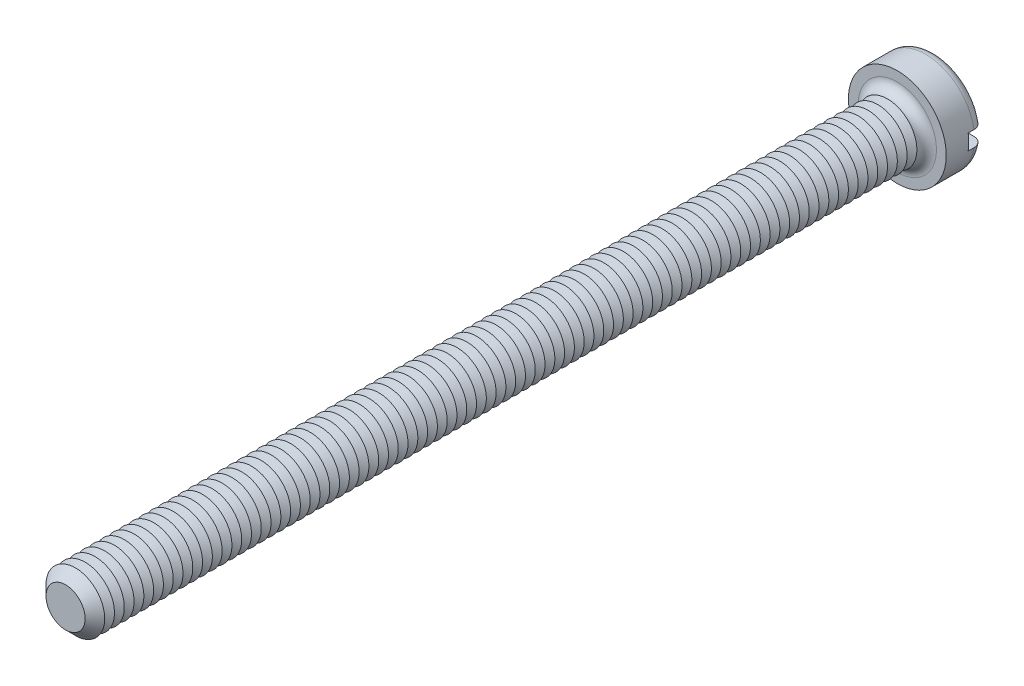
ISO-10303-21;
HEADER;
FILE_DESCRIPTION(('STEP AP214'),'2;1');
FILE_NAME('part.step','',(''),(''),'','','');
FILE_SCHEMA(('AUTOMOTIVE_DESIGN { 1 0 10303 214 1 1 1 1 }'));
ENDSEC;
DATA;
#1=APPLICATION_CONTEXT('core data for automotive mechanical design processes');
#2=APPLICATION_PROTOCOL_DEFINITION('international standard','automotive_design',2000,#1);
#3=PRODUCT_CONTEXT('',#1,'mechanical');
#4=PRODUCT('Part','Part','',(#3));
#5=PRODUCT_RELATED_PRODUCT_CATEGORY('part','',(#4));
#6=PRODUCT_DEFINITION_FORMATION('','',#4);
#7=PRODUCT_DEFINITION_CONTEXT('part definition',#1,'design');
#8=PRODUCT_DEFINITION('design','',#6,#7);
#9=PRODUCT_DEFINITION_SHAPE('','',#8);
#10=(LENGTH_UNIT() NAMED_UNIT(*) SI_UNIT(.MILLI.,.METRE.));
#11=(NAMED_UNIT(*) PLANE_ANGLE_UNIT() SI_UNIT($,.RADIAN.));
#12=(NAMED_UNIT(*) SI_UNIT($,.STERADIAN.) SOLID_ANGLE_UNIT());
#13=UNCERTAINTY_MEASURE_WITH_UNIT(LENGTH_MEASURE(1.E-05),#10,'distance_accuracy_value','');
#14=(GEOMETRIC_REPRESENTATION_CONTEXT(3) GLOBAL_UNCERTAINTY_ASSIGNED_CONTEXT((#13)) GLOBAL_UNIT_ASSIGNED_CONTEXT((#10,
#11,#12)) REPRESENTATION_CONTEXT('',''));
#15=CARTESIAN_POINT('',(0.,0.,0.));
#16=DIRECTION('',(0.,0.,1.));
#17=DIRECTION('',(1.,0.,0.));
#18=AXIS2_PLACEMENT_3D('',#15,#16,#17);
#19=CARTESIAN_POINT('',(0.,0.,-3.9));
#20=DIRECTION('',(0.,0.,1.));
#21=DIRECTION('',(1.,0.,0.));
#22=AXIS2_PLACEMENT_3D('',#19,#20,#21);
#23=PLANE('',#22);
#24=CARTESIAN_POINT('',(0.,0.,-3.9));
#25=DIRECTION('',(0.,0.,1.));
#26=DIRECTION('',(1.,0.,0.));
#27=AXIS2_PLACEMENT_3D('',#24,#25,#26);
#28=CIRCLE('',#27,4.);
#29=CARTESIAN_POINT('',(-3.91918358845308,0.800000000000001,-3.9));
#30=VERTEX_POINT('',#29);
#31=CARTESIAN_POINT('',(3.91918358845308,0.8,-3.9));
#32=VERTEX_POINT('',#31);
#33=EDGE_CURVE('E116',#30,#32,#28,.F.);
#34=ORIENTED_EDGE('',*,*,#33,.T.);
#35=DIRECTION('',(1.,0.,0.));
#36=VECTOR('',#35,1.);
#37=CARTESIAN_POINT('',(-5.,0.800000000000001,-3.9));
#38=LINE('',#37,#36);
#39=EDGE_CURVE('E111',#30,#32,#38,.T.);
#40=ORIENTED_EDGE('',*,*,#39,.F.);
#41=EDGE_LOOP('',(#34,#40));
#42=FACE_BOUND('',#41,.T.);
#43=ADVANCED_FACE('F39',(#42),#23,.F.);
#44=CARTESIAN_POINT('',(0.,0.,-2.9));
#45=DIRECTION('',(0.,0.,1.));
#46=DIRECTION('',(1.,0.,0.));
#47=AXIS2_PLACEMENT_3D('',#44,#45,#46);
#48=TOROIDAL_SURFACE('',#47,4.,1.);
#49=CARTESIAN_POINT('',(-4.76648512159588,0.800000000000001,-3.45304061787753));
#50=CARTESIAN_POINT('',(-4.73486405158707,0.800000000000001,-3.50001565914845));
#51=CARTESIAN_POINT('',(-4.69920787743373,0.800000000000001,-3.54432871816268));
#52=CARTESIAN_POINT('',(-4.62090302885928,0.800000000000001,-3.62634638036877));
#53=CARTESIAN_POINT('',(-4.57824494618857,0.800000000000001,-3.66404194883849));
#54=CARTESIAN_POINT('',(-4.48726975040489,0.800000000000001,-3.73172278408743));
#55=CARTESIAN_POINT('',(-4.43895902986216,0.800000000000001,-3.76171664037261));
#56=CARTESIAN_POINT('',(-4.33804923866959,0.800000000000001,-3.81326437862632));
#57=CARTESIAN_POINT('',(-4.2854512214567,0.800000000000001,-3.8348203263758));
#58=CARTESIAN_POINT('',(-4.17679895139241,0.800000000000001,-3.86918431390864));
#59=CARTESIAN_POINT('',(-4.12071163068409,0.800000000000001,-3.88188775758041));
#60=CARTESIAN_POINT('',(-4.00720729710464,0.800000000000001,-3.89785932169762));
#61=CARTESIAN_POINT('',(-3.94979011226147,0.800000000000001,-3.9011262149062));
#62=CARTESIAN_POINT('',(-3.83429042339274,0.800000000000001,-3.89816676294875));
#63=CARTESIAN_POINT('',(-3.77621176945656,0.800000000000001,-3.89178937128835));
#64=CARTESIAN_POINT('',(-3.66191938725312,0.800000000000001,-3.8694726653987));
#65=CARTESIAN_POINT('',(-3.60570580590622,0.800000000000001,-3.85353259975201));
#66=CARTESIAN_POINT('',(-3.49618749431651,0.800000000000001,-3.81233202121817));
#67=CARTESIAN_POINT('',(-3.44291561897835,0.800000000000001,-3.78698406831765));
#68=CARTESIAN_POINT('',(-3.34140774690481,0.800000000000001,-3.72766098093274));
#69=CARTESIAN_POINT('',(-3.29317182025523,0.800000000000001,-3.69368572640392));
#70=CARTESIAN_POINT('',(-3.20343355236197,0.800000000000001,-3.6182054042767));
#71=CARTESIAN_POINT('',(-3.16189680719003,0.800000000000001,-3.57674128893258));
#72=CARTESIAN_POINT('',(-3.08658236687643,0.800000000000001,-3.48727547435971));
#73=CARTESIAN_POINT('',(-3.05280364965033,0.800000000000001,-3.43927463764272));
#74=CARTESIAN_POINT('',(-2.99489532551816,0.800000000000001,-3.33932895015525));
#75=CARTESIAN_POINT('',(-2.97055012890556,0.800000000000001,-3.28750911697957));
#76=CARTESIAN_POINT('',(-2.93124252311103,0.800000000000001,-3.18042600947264));
#77=CARTESIAN_POINT('',(-2.91627793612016,0.800000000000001,-3.12516353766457));
#78=CARTESIAN_POINT('',(-2.89663075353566,0.800000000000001,-3.01470560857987));
#79=CARTESIAN_POINT('',(-2.89162828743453,0.800000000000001,-2.95956691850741));
#80=CARTESIAN_POINT('',(-2.89112479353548,0.800000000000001,-2.84924961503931));
#81=CARTESIAN_POINT('',(-2.89562264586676,0.800000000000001,-2.79407100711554));
#82=CARTESIAN_POINT('',(-2.91379565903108,0.800000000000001,-2.6861912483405));
#83=CARTESIAN_POINT('',(-2.92731815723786,0.800000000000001,-2.63346424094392));
#84=CARTESIAN_POINT('',(-2.96290888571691,0.800000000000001,-2.53098203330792));
#85=CARTESIAN_POINT('',(-2.98497757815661,0.800000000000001,-2.48122699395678));
#86=CARTESIAN_POINT('',(-3.03728055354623,0.800000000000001,-2.38535286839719));
#87=CARTESIAN_POINT('',(-3.06761989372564,0.800000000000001,-2.33929117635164));
#88=CARTESIAN_POINT('',(-3.13537950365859,0.800000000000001,-2.2527125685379));
#89=CARTESIAN_POINT('',(-3.17280082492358,0.800000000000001,-2.21219647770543));
#90=CARTESIAN_POINT('',(-3.2549164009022,0.800000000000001,-2.13651195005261));
#91=CARTESIAN_POINT('',(-3.29980186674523,0.800000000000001,-2.10155095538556));
#92=CARTESIAN_POINT('',(-3.39467666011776,0.800000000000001,-2.03942270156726));
#93=CARTESIAN_POINT('',(-3.44466673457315,0.800000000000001,-2.01225658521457));
#94=CARTESIAN_POINT('',(-3.5497933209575,0.800000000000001,-1.96576935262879));
#95=CARTESIAN_POINT('',(-3.60503228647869,0.800000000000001,-1.94667963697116));
#96=CARTESIAN_POINT('',(-3.71791613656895,0.800000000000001,-1.91794308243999));
#97=CARTESIAN_POINT('',(-3.77556119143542,0.800000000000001,-1.90829691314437));
#98=CARTESIAN_POINT('',(-3.89221522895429,0.800000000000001,-1.89869331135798));
#99=CARTESIAN_POINT('',(-3.9512319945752,0.800000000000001,-1.89882985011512));
#100=CARTESIAN_POINT('',(-4.06839541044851,0.800000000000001,-1.90907818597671));
#101=CARTESIAN_POINT('',(-4.12654207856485,0.800000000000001,-1.91918977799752));
#102=CARTESIAN_POINT('',(-4.23988103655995,0.800000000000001,-1.9490667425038));
#103=CARTESIAN_POINT('',(-4.29509069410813,0.800000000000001,-1.96876615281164));
#104=CARTESIAN_POINT('',(-4.40134194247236,0.800000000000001,-2.01729572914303));
#105=CARTESIAN_POINT('',(-4.45238383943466,0.800000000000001,-2.04612522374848));
#106=CARTESIAN_POINT('',(-4.54801343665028,0.800000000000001,-2.1116316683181));
#107=CARTESIAN_POINT('',(-4.59268768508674,0.800000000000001,-2.14818225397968));
#108=CARTESIAN_POINT('',(-4.67513924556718,0.800000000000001,-2.22837632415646));
#109=CARTESIAN_POINT('',(-4.71291715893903,0.800000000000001,-2.27201918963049));
#110=CARTESIAN_POINT('',(-4.77986554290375,0.800000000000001,-2.36439990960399));
#111=CARTESIAN_POINT('',(-4.80916462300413,0.800000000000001,-2.41304457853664));
#112=CARTESIAN_POINT('',(-4.85906149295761,0.800000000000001,-2.51460659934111));
#113=CARTESIAN_POINT('',(-4.8796602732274,0.800000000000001,-2.56752346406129));
#114=CARTESIAN_POINT('',(-4.9113264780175,0.800000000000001,-2.67542592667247));
#115=CARTESIAN_POINT('',(-4.92250819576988,0.800000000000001,-2.73037800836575));
#116=CARTESIAN_POINT('',(-4.93542682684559,0.800000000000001,-2.84139649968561));
#117=CARTESIAN_POINT('',(-4.93716171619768,0.800000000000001,-2.89746314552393));
#118=CARTESIAN_POINT('',(-4.93114851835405,0.800000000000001,-3.00876455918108));
#119=CARTESIAN_POINT('',(-4.92345325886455,0.800000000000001,-3.0640022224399));
#120=CARTESIAN_POINT('',(-4.8989032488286,0.800000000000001,-3.17235240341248));
#121=CARTESIAN_POINT('',(-4.88205998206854,0.800000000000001,-3.22546749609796));
#122=CARTESIAN_POINT('',(-4.84819200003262,0.800000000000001,-3.30764066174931));
#123=CARTESIAN_POINT('',(-4.83390853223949,0.800000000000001,-3.33785845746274));
#124=CARTESIAN_POINT('',(-4.80237957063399,0.800000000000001,-3.39670633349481));
#125=CARTESIAN_POINT('',(-4.78513409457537,0.800000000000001,-3.42533642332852));
#126=CARTESIAN_POINT('',(-4.76648512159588,0.800000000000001,-3.45304061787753));
#127=B_SPLINE_CURVE_WITH_KNOTS('',3,(#49,#50,#51,#52,#53,#54,#55,#56,#57,#58,#59,#60,#61,#62,
#63,#64,#65,#66,#67,#68,#69,#70,#71,#72,#73,#74,#75,#76,#77,#78,#79,#80,#81,#82,#83,#84,#85,#86,
#87,#88,#89,#90,#91,#92,#93,#94,#95,#96,#97,#98,#99,#100,#101,#102,#103,#104,#105,#106,#107,
#108,#109,#110,#111,#112,#113,#114,#115,#116,#117,#118,#119,#120,#121,#122,#123,#124,#125,#126),
.UNSPECIFIED.,.T.,.F.,(4,2,2,2,2,2,2,2,2,2,2,2,2,2,2,2,2,2,2,2,2,2,2,2,2,2,2,2,2,2,2,2,2,2,2,2,
2,2,4),(0.,0.169755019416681,0.339740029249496,0.509534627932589,0.67928763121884,
0.851013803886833,1.02276230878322,1.19722869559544,1.37170879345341,1.54785292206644,
1.72399950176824,1.89921049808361,2.07439839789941,2.24530597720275,2.41617386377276,
2.58146078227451,2.74672821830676,2.90926852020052,3.0718176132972,3.2365363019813,
3.40127946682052,3.57118676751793,3.74111896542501,3.91563534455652,4.09016409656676,
4.26636956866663,4.4425714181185,4.61757781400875,4.79257134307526,4.96489650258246,
5.13720662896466,5.30674670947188,5.47626748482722,5.64369988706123,5.81116816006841,
5.97770254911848,6.14402836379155,6.24414438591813,6.34425980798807),.UNSPECIFIED.);
#128=CARTESIAN_POINT('',(-4.93558507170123,0.800000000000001,-2.9));
#129=VERTEX_POINT('',#128);
#130=EDGE_CURVE('E842',#129,#30,#127,.T.);
#131=ORIENTED_EDGE('',*,*,#130,.F.);
#132=CARTESIAN_POINT('',(0.,0.,-2.9));
#133=DIRECTION('',(0.,0.,1.));
#134=DIRECTION('',(1.,0.,0.));
#135=AXIS2_PLACEMENT_3D('',#132,#133,#134);
#136=CIRCLE('',#135,5.);
#137=CARTESIAN_POINT('',(4.93558507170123,0.8,-2.9));
#138=VERTEX_POINT('',#137);
#139=EDGE_CURVE('E124',#138,#129,#136,.T.);
#140=ORIENTED_EDGE('',*,*,#139,.F.);
#141=CARTESIAN_POINT('',(2.98553785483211,0.8,-3.31649797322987));
#142=CARTESIAN_POINT('',(3.00991125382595,0.8,-3.36788093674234));
#143=CARTESIAN_POINT('',(3.03875556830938,0.8,-3.41719756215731));
#144=CARTESIAN_POINT('',(3.1043993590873,0.8,-3.51028676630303));
#145=CARTESIAN_POINT('',(3.1412115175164,0.8,-3.55405032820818));
#146=CARTESIAN_POINT('',(3.22153641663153,0.8,-3.63476402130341));
#147=CARTESIAN_POINT('',(3.26503706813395,0.8,-3.67172618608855));
#148=CARTESIAN_POINT('',(3.35749627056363,0.8,-3.73799476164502));
#149=CARTESIAN_POINT('',(3.4064533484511,0.8,-3.76730323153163));
#150=CARTESIAN_POINT('',(3.5095773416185,0.8,-3.81809642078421));
#151=CARTESIAN_POINT('',(3.56383317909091,0.8,-3.83940072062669));
#152=CARTESIAN_POINT('',(3.67513017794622,0.8,-3.87272481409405));
#153=CARTESIAN_POINT('',(3.7321717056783,0.8,-3.88474338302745));
#154=CARTESIAN_POINT('',(3.84815688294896,0.8,-3.89923413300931));
#155=CARTESIAN_POINT('',(3.90711516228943,0.8,-3.9015896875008));
#156=CARTESIAN_POINT('',(4.02458610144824,0.8,-3.89631753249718));
#157=CARTESIAN_POINT('',(4.08309876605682,0.8,-3.8886899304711));
#158=CARTESIAN_POINT('',(4.19768646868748,0.8,-3.86366584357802));
#159=CARTESIAN_POINT('',(4.25377243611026,0.8,-3.84631948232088));
#160=CARTESIAN_POINT('',(4.3621676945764,0.8,-3.80231797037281));
#161=CARTESIAN_POINT('',(4.41447726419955,0.8,-3.77566350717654));
#162=CARTESIAN_POINT('',(4.51300872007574,0.8,-3.71421163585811));
#163=CARTESIAN_POINT('',(4.5593085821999,0.8,-3.67953927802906));
#164=CARTESIAN_POINT('',(4.64530675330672,0.8,-3.60279495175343));
#165=CARTESIAN_POINT('',(4.68500564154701,0.8,-3.56072363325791));
#166=CARTESIAN_POINT('',(4.75599202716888,0.8,-3.47111750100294));
#167=CARTESIAN_POINT('',(4.7874061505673,0.8,-3.42368298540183));
#168=CARTESIAN_POINT('',(4.84170328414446,0.8,-3.32415927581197));
#169=CARTESIAN_POINT('',(4.86458695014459,0.8,-3.2720704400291));
#170=CARTESIAN_POINT('',(4.90088120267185,0.8,-3.16544016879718));
#171=CARTESIAN_POINT('',(4.91440984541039,0.8,-3.11093889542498));
#172=CARTESIAN_POINT('',(4.93205429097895,0.8,-3.00043391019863));
#173=CARTESIAN_POINT('',(4.93617053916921,0.8,-2.9444302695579));
#174=CARTESIAN_POINT('',(4.93486973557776,0.8,-2.83292218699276));
#175=CARTESIAN_POINT('',(4.92951827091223,0.8,-2.77741696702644));
#176=CARTESIAN_POINT('',(4.90957104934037,0.8,-2.66809456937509));
#177=CARTESIAN_POINT('',(4.89497541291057,0.8,-2.61427736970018));
#178=CARTESIAN_POINT('',(4.85697876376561,0.8,-2.50985095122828));
#179=CARTESIAN_POINT('',(4.83357805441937,0.8,-2.45924162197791));
#180=CARTESIAN_POINT('',(4.77866660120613,0.8,-2.36263484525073));
#181=CARTESIAN_POINT('',(4.74715567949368,0.8,-2.31663749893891));
#182=CARTESIAN_POINT('',(4.67670791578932,0.8,-2.23021464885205));
#183=CARTESIAN_POINT('',(4.6377224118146,0.8,-2.1898288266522));
#184=CARTESIAN_POINT('',(4.55359880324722,0.8,-2.11607828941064));
#185=CARTESIAN_POINT('',(4.50846036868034,0.8,-2.08271395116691));
#186=CARTESIAN_POINT('',(4.41271544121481,0.8,-2.02349513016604));
#187=CARTESIAN_POINT('',(4.36204749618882,0.8,-1.99774003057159));
#188=CARTESIAN_POINT('',(4.257155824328,0.8,-1.95495040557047));
#189=CARTESIAN_POINT('',(4.20293181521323,0.8,-1.93791657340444));
#190=CARTESIAN_POINT('',(4.09154156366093,0.8,-1.91276335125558));
#191=CARTESIAN_POINT('',(4.03434212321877,0.8,-1.90479098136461));
#192=CARTESIAN_POINT('',(3.91941228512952,0.8,-1.89840884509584));
#193=CARTESIAN_POINT('',(3.8616818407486,0.8,-1.89999992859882));
#194=CARTESIAN_POINT('',(3.7464111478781,0.8,-1.91275144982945));
#195=CARTESIAN_POINT('',(3.6888866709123,0.8,-1.92405471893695));
#196=CARTESIAN_POINT('',(3.57652290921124,0.8,-1.95609086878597));
#197=CARTESIAN_POINT('',(3.52168382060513,0.8,-1.97682443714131));
#198=CARTESIAN_POINT('',(3.41589179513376,0.8,-2.02733294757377));
#199=CARTESIAN_POINT('',(3.36496676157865,0.8,-2.05716640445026));
#200=CARTESIAN_POINT('',(3.26890903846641,0.8,-2.12504079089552));
#201=CARTESIAN_POINT('',(3.22377627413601,0.8,-2.16308161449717));
#202=CARTESIAN_POINT('',(3.141135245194,0.8,-2.24593284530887));
#203=CARTESIAN_POINT('',(3.1035541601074,0.8,-2.29067053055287));
#204=CARTESIAN_POINT('',(3.03669700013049,0.8,-2.38597317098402));
#205=CARTESIAN_POINT('',(3.00741914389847,0.8,-2.43653687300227));
#206=CARTESIAN_POINT('',(2.95891799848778,0.8,-2.54052959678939));
#207=CARTESIAN_POINT('',(2.93943249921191,0.8,-2.59383627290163));
#208=CARTESIAN_POINT('',(2.9100081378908,0.8,-2.70303736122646));
#209=CARTESIAN_POINT('',(2.90006970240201,0.8,-2.75893188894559));
#210=CARTESIAN_POINT('',(2.89027863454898,0.8,-2.86986958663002));
#211=CARTESIAN_POINT('',(2.89012791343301,0.8,-2.92488680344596));
#212=CARTESIAN_POINT('',(2.89917145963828,0.8,-3.03409648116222));
#213=CARTESIAN_POINT('',(2.90835313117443,0.8,-3.08828995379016));
#214=CARTESIAN_POINT('',(2.92977618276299,0.8,-3.17141652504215));
#215=CARTESIAN_POINT('',(2.93899011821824,0.8,-3.20116372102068));
#216=CARTESIAN_POINT('',(2.96020249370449,0.8,-3.25964614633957));
#217=CARTESIAN_POINT('',(2.97220082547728,0.8,-3.28838141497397));
#218=CARTESIAN_POINT('',(2.98553785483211,0.8,-3.31649797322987));
#219=B_SPLINE_CURVE_WITH_KNOTS('',3,(#141,#142,#143,#144,#145,#146,#147,#148,#149,#150,#151,
#152,#153,#154,#155,#156,#157,#158,#159,#160,#161,#162,#163,#164,#165,#166,#167,#168,#169,#170,
#171,#172,#173,#174,#175,#176,#177,#178,#179,#180,#181,#182,#183,#184,#185,#186,#187,#188,#189,
#190,#191,#192,#193,#194,#195,#196,#197,#198,#199,#200,#201,#202,#203,#204,#205,#206,#207,#208,
#209,#210,#211,#212,#213,#214,#215,#216,#217,#218),.UNSPECIFIED.,.T.,.F.,(4,2,2,2,2,2,2,2,2,2,2,
2,2,2,2,2,2,2,2,2,2,2,2,2,2,2,2,2,2,2,2,2,2,2,2,2,2,2,4),(0.,0.170493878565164,
0.341261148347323,0.511723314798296,0.682139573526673,0.856194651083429,1.03027268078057,
1.20644565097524,1.38261672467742,1.55788746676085,1.73314526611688,1.90583484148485,
2.07850925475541,2.24836742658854,2.41821253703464,2.58587311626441,2.75352576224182,
2.92002154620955,3.08651516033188,3.25300303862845,3.41949456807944,3.58710926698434,
3.75473295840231,3.92445790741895,4.09419634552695,4.26665110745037,4.43912119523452,
4.61417197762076,4.78923552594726,4.96544940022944,5.1416609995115,5.31608191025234,
5.49046537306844,5.65989063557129,5.82932346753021,5.99359365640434,6.157642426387,
6.250939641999,6.34423323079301),.UNSPECIFIED.);
#220=EDGE_CURVE('E844',#32,#138,#219,.T.);
#221=ORIENTED_EDGE('',*,*,#220,.F.);
#222=ORIENTED_EDGE('',*,*,#33,.F.);
#223=EDGE_LOOP('',(#131,#140,#221,#222));
#224=FACE_BOUND('',#223,.T.);
#225=ADVANCED_FACE('F826',(#224),#48,.T.);
#226=CARTESIAN_POINT('',(0.,0.,-3.9));
#227=DIRECTION('',(0.,0.,1.));
#228=DIRECTION('',(1.,0.,0.));
#229=AXIS2_PLACEMENT_3D('',#226,#227,#228);
#230=CYLINDRICAL_SURFACE('',#229,5.);
#231=DIRECTION('',(0.,0.,1.));
#232=VECTOR('',#231,1.);
#233=CARTESIAN_POINT('',(4.93558507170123,0.8,-3.9));
#234=LINE('',#233,#232);
#235=CARTESIAN_POINT('',(4.93558507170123,0.8,-2.3));
#236=VERTEX_POINT('',#235);
#237=EDGE_CURVE('E858',#138,#236,#234,.T.);
#238=ORIENTED_EDGE('',*,*,#237,.F.);
#239=ORIENTED_EDGE('',*,*,#139,.T.);
#240=DIRECTION('',(0.,0.,1.));
#241=VECTOR('',#240,1.);
#242=CARTESIAN_POINT('',(-4.93558507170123,0.800000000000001,-3.9));
#243=LINE('',#242,#241);
#244=CARTESIAN_POINT('',(-4.93558507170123,0.800000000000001,-2.3));
#245=VERTEX_POINT('',#244);
#246=EDGE_CURVE('E63',#245,#129,#243,.F.);
#247=ORIENTED_EDGE('',*,*,#246,.F.);
#248=CARTESIAN_POINT('',(0.,0.,-2.3));
#249=DIRECTION('',(0.,0.,-1.));
#250=DIRECTION('',(-1.,0.,0.));
#251=AXIS2_PLACEMENT_3D('',#248,#249,#250);
#252=CIRCLE('',#251,5.);
#253=CARTESIAN_POINT('',(-4.93558507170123,-0.799999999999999,-2.3));
#254=VERTEX_POINT('',#253);
#255=EDGE_CURVE('E43',#245,#254,#252,.F.);
#256=ORIENTED_EDGE('',*,*,#255,.T.);
#257=DIRECTION('',(0.,0.,1.));
#258=VECTOR('',#257,1.);
#259=CARTESIAN_POINT('',(-4.93558507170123,-0.799999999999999,-3.9));
#260=LINE('',#259,#258);
#261=CARTESIAN_POINT('',(-4.93558507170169,-0.799999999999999,-2.89999999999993));
#262=VERTEX_POINT('',#261);
#263=EDGE_CURVE('E856',#262,#254,#260,.T.);
#264=ORIENTED_EDGE('',*,*,#263,.F.);
#265=CARTESIAN_POINT('',(4.93558507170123,-0.8,-2.9));
#266=VERTEX_POINT('',#265);
#267=EDGE_CURVE('E126',#262,#266,#136,.T.);
#268=ORIENTED_EDGE('',*,*,#267,.T.);
#269=DIRECTION('',(0.,0.,1.));
#270=VECTOR('',#269,1.);
#271=CARTESIAN_POINT('',(4.93558507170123,-0.8,-3.9));
#272=LINE('',#271,#270);
#273=CARTESIAN_POINT('',(4.93558507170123,-0.8,-2.3));
#274=VERTEX_POINT('',#273);
#275=EDGE_CURVE('E55',#274,#266,#272,.F.);
#276=ORIENTED_EDGE('',*,*,#275,.F.);
#277=EDGE_CURVE('E11',#274,#236,#252,.F.);
#278=ORIENTED_EDGE('',*,*,#277,.T.);
#279=EDGE_LOOP('',(#238,#239,#247,#256,#264,#268,#276,#278));
#280=FACE_BOUND('',#279,.T.);
#281=CARTESIAN_POINT('',(0.,0.,0.));
#282=DIRECTION('',(0.,0.,1.));
#283=DIRECTION('',(1.,0.,0.));
#284=AXIS2_PLACEMENT_3D('',#281,#282,#283);
#285=CIRCLE('',#284,5.);
#286=CARTESIAN_POINT('',(5.,0.,0.));
#287=VERTEX_POINT('',#286);
#288=EDGE_CURVE('E861',#287,#287,#285,.T.);
#289=ORIENTED_EDGE('',*,*,#288,.F.);
#290=EDGE_LOOP('',(#289));
#291=FACE_BOUND('',#290,.T.);
#292=ADVANCED_FACE('F822',(#280,#291),#230,.T.);
#293=CARTESIAN_POINT('',(3.91918358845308,-0.8,-3.9));
#294=VERTEX_POINT('',#293);
#295=CARTESIAN_POINT('',(-3.91918358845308,-0.799999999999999,-3.9));
#296=VERTEX_POINT('',#295);
#297=EDGE_CURVE('E109',#294,#296,#28,.F.);
#298=ORIENTED_EDGE('',*,*,#297,.T.);
#299=DIRECTION('',(-1.,0.,0.));
#300=VECTOR('',#299,1.);
#301=CARTESIAN_POINT('',(-5.,-0.799999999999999,-3.9));
#302=LINE('',#301,#300);
#303=EDGE_CURVE('E96',#294,#296,#302,.T.);
#304=ORIENTED_EDGE('',*,*,#303,.F.);
#305=EDGE_LOOP('',(#298,#304));
#306=FACE_BOUND('',#305,.T.);
#307=ADVANCED_FACE('F108',(#306),#23,.F.);
#308=CARTESIAN_POINT('',(0.,0.,0.));
#309=DIRECTION('',(0.,0.,1.));
#310=DIRECTION('',(1.,0.,0.));
#311=AXIS2_PLACEMENT_3D('',#308,#309,#310);
#312=PLANE('',#311);
#313=CARTESIAN_POINT('',(0.,0.,0.));
#314=DIRECTION('',(0.,0.,1.));
#315=DIRECTION('',(1.,0.,0.));
#316=AXIS2_PLACEMENT_3D('',#313,#314,#315);
#317=CIRCLE('',#316,4.);
#318=CARTESIAN_POINT('',(4.,0.,0.));
#319=VERTEX_POINT('',#318);
#320=EDGE_CURVE('E115',#319,#319,#317,.F.);
#321=ORIENTED_EDGE('',*,*,#320,.T.);
#322=EDGE_LOOP('',(#321));
#323=FACE_BOUND('',#322,.T.);
#324=ORIENTED_EDGE('',*,*,#288,.T.);
#325=EDGE_LOOP('',(#324));
#326=FACE_BOUND('',#325,.T.);
#327=ADVANCED_FACE('F821',(#323,#326),#312,.T.);
#328=CARTESIAN_POINT('',(-4.76648512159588,-0.799999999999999,-3.45304061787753));
#329=CARTESIAN_POINT('',(-4.7975694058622,-0.799999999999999,-3.40685392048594));
#330=CARTESIAN_POINT('',(-4.82479903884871,-0.799999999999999,-3.35802740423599));
#331=CARTESIAN_POINT('',(-4.87070632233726,-0.799999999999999,-3.25646127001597));
#332=CARTESIAN_POINT('',(-4.8893747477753,-0.799999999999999,-3.20371750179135));
#333=CARTESIAN_POINT('',(-4.91756720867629,-0.799999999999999,-3.09584501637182));
#334=CARTESIAN_POINT('',(-4.92709302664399,-0.799999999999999,-3.04071676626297));
#335=CARTESIAN_POINT('',(-4.93671217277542,-0.799999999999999,-2.92965669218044));
#336=CARTESIAN_POINT('',(-4.93680767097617,-0.799999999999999,-2.87372505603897));
#337=CARTESIAN_POINT('',(-4.92758675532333,-0.799999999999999,-2.76284675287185));
#338=CARTESIAN_POINT('',(-4.91830421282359,-0.799999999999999,-2.70789726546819));
#339=CARTESIAN_POINT('',(-4.89065741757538,-0.799999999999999,-2.60033228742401));
#340=CARTESIAN_POINT('',(-4.87229291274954,-0.799999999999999,-2.54771686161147));
#341=CARTESIAN_POINT('',(-4.82699855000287,-0.799999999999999,-2.44622441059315));
#342=CARTESIAN_POINT('',(-4.80005659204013,-0.799999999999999,-2.39735278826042));
#343=CARTESIAN_POINT('',(-4.73841244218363,-0.799999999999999,-2.30477947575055));
#344=CARTESIAN_POINT('',(-4.70371003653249,-0.799999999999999,-2.26107792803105));
#345=CARTESIAN_POINT('',(-4.62724516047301,-0.799999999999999,-2.17969334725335));
#346=CARTESIAN_POINT('',(-4.58542787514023,-0.799999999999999,-2.14206183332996));
#347=CARTESIAN_POINT('',(-4.49614171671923,-0.799999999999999,-2.07424284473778));
#348=CARTESIAN_POINT('',(-4.44867251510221,-0.799999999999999,-2.04405580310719));
#349=CARTESIAN_POINT('',(-4.34875035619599,-0.799999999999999,-1.99153688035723));
#350=CARTESIAN_POINT('',(-4.29623870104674,-0.799999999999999,-1.96931670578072));
#351=CARTESIAN_POINT('',(-4.18826905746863,-0.799999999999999,-1.93384994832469));
#352=CARTESIAN_POINT('',(-4.1328108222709,-0.799999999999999,-1.92060411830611));
#353=CARTESIAN_POINT('',(-4.01956054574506,-0.799999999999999,-1.90323798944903));
#354=CARTESIAN_POINT('',(-3.96174522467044,-0.799999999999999,-1.89926947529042));
#355=CARTESIAN_POINT('',(-3.84625419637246,-0.799999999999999,-1.90095183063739));
#356=CARTESIAN_POINT('',(-3.78857850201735,-0.799999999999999,-1.90660355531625));
#357=CARTESIAN_POINT('',(-3.67415602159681,-0.799999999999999,-1.92748272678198));
#358=CARTESIAN_POINT('',(-3.61743328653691,-0.799999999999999,-1.94284216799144));
#359=CARTESIAN_POINT('',(-3.50734962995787,-0.799999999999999,-1.9828275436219));
#360=CARTESIAN_POINT('',(-3.4539889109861,-0.799999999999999,-2.00745403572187));
#361=CARTESIAN_POINT('',(-3.35197118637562,-0.799999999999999,-2.06542964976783));
#362=CARTESIAN_POINT('',(-3.30333217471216,-0.799999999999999,-2.0988104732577));
#363=CARTESIAN_POINT('',(-3.21244692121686,-0.799999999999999,-2.17337326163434));
#364=CARTESIAN_POINT('',(-3.17020039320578,-0.799999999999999,-2.21455487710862));
#365=CARTESIAN_POINT('',(-3.0940098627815,-0.799999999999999,-2.30296695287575));
#366=CARTESIAN_POINT('',(-3.05995540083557,-0.799999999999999,-2.35010211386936));
#367=CARTESIAN_POINT('',(-3.00053815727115,-0.799999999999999,-2.4495670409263));
#368=CARTESIAN_POINT('',(-2.97517362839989,-0.799999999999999,-2.50189576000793));
#369=CARTESIAN_POINT('',(-2.93470320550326,-0.799999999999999,-2.60853979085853));
#370=CARTESIAN_POINT('',(-2.91930557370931,-0.799999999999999,-2.66274437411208));
#371=CARTESIAN_POINT('',(-2.89812734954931,-0.799999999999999,-2.77299836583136));
#372=CARTESIAN_POINT('',(-2.89234481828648,-0.799999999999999,-2.82904740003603));
#373=CARTESIAN_POINT('',(-2.89064073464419,-0.799999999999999,-2.93970612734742));
#374=CARTESIAN_POINT('',(-2.89444549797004,-0.799999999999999,-2.99431180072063));
#375=CARTESIAN_POINT('',(-2.9112006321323,-0.799999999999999,-3.10209766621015));
#376=CARTESIAN_POINT('',(-2.9241507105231,-0.799999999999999,-3.1552779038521));
#377=CARTESIAN_POINT('',(-2.95868580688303,-0.799999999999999,-3.25858631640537));
#378=CARTESIAN_POINT('',(-2.98024709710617,-0.799999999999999,-3.30872244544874));
#379=CARTESIAN_POINT('',(-3.03128544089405,-0.799999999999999,-3.40478519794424));
#380=CARTESIAN_POINT('',(-3.06076335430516,-0.799999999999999,-3.45071136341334));
#381=CARTESIAN_POINT('',(-3.12753448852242,-0.799999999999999,-3.53826932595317));
#382=CARTESIAN_POINT('',(-3.16500083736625,-0.799999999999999,-3.57976901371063));
#383=CARTESIAN_POINT('',(-3.24617503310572,-0.799999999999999,-3.65613204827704));
#384=CARTESIAN_POINT('',(-3.28988388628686,-0.799999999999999,-3.69099432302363));
#385=CARTESIAN_POINT('',(-3.38380639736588,-0.799999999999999,-3.75424083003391));
#386=CARTESIAN_POINT('',(-3.43418287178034,-0.799999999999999,-3.78238342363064));
#387=CARTESIAN_POINT('',(-3.53887888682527,-0.799999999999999,-3.83000231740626));
#388=CARTESIAN_POINT('',(-3.59319889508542,-0.799999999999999,-3.84947758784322));
#389=CARTESIAN_POINT('',(-3.70539237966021,-0.799999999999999,-3.87954336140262));
#390=CARTESIAN_POINT('',(-3.76331464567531,-0.799999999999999,-3.88995217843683));
#391=CARTESIAN_POINT('',(-3.88008461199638,-0.799999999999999,-3.9009132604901));
#392=CARTESIAN_POINT('',(-3.93893230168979,-0.799999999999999,-3.9014656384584));
#393=CARTESIAN_POINT('',(-4.05594892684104,-0.799999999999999,-3.89264187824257));
#394=CARTESIAN_POINT('',(-4.11411702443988,-0.799999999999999,-3.88325457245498));
#395=CARTESIAN_POINT('',(-4.22802928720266,-0.799999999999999,-3.85472582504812));
#396=CARTESIAN_POINT('',(-4.28377297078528,-0.799999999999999,-3.83558245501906));
#397=CARTESIAN_POINT('',(-4.39054463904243,-0.799999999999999,-3.78829842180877));
#398=CARTESIAN_POINT('',(-4.44161887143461,-0.799999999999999,-3.76026208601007));
#399=CARTESIAN_POINT('',(-4.53818016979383,-0.799999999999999,-3.69589278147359));
#400=CARTESIAN_POINT('',(-4.58367442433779,-0.799999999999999,-3.65957066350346));
#401=CARTESIAN_POINT('',(-4.65208830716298,-0.799999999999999,-3.59453310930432));
#402=CARTESIAN_POINT('',(-4.67711825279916,-0.799999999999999,-3.56800018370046));
#403=CARTESIAN_POINT('',(-4.72414423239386,-0.799999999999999,-3.51236863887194));
#404=CARTESIAN_POINT('',(-4.74614029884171,-0.799999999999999,-3.48327004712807));
#405=CARTESIAN_POINT('',(-4.76648512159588,-0.799999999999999,-3.45304061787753));
#406=B_SPLINE_CURVE_WITH_KNOTS('',3,(#328,#329,#330,#331,#332,#333,#334,#335,#336,#337,#338,
#339,#340,#341,#342,#343,#344,#345,#346,#347,#348,#349,#350,#351,#352,#353,#354,#355,#356,#357,
#358,#359,#360,#361,#362,#363,#364,#365,#366,#367,#368,#369,#370,#371,#372,#373,#374,#375,#376,
#377,#378,#379,#380,#381,#382,#383,#384,#385,#386,#387,#388,#389,#390,#391,#392,#393,#394,#395,
#396,#397,#398,#399,#400,#401,#402,#403,#404,#405),.UNSPECIFIED.,.T.,.F.,(4,2,2,2,2,2,2,2,2,2,2,
2,2,2,2,2,2,2,2,2,2,2,2,2,2,2,2,2,2,2,2,2,2,2,2,2,2,2,4),(0.,0.166886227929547,
0.333951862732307,0.500984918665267,0.667979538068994,0.834373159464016,1.00077139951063,
1.16740542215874,1.33404403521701,1.50202999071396,1.67002571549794,1.84029248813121,
2.01057354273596,2.18362161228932,2.35668506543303,2.53215380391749,2.70763310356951,
2.88375684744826,3.05987270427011,3.23346085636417,3.40701408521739,3.57522519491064,
3.74340238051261,3.90683338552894,4.0702591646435,4.23323770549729,4.39623395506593,
4.56320691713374,4.7302068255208,4.90252468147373,5.07486300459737,5.25058028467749,
5.42629555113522,5.60220844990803,5.77815613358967,5.95211162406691,6.12584060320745,
6.23506966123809,6.34429754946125),.UNSPECIFIED.);
#407=EDGE_CURVE('E103',#296,#262,#406,.T.);
#408=ORIENTED_EDGE('',*,*,#407,.F.);
#409=ORIENTED_EDGE('',*,*,#297,.F.);
#410=CARTESIAN_POINT('',(2.98553785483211,-0.8,-3.31649797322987));
#411=CARTESIAN_POINT('',(2.96216773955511,-0.8,-3.26721849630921));
#412=CARTESIAN_POINT('',(2.94287503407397,-0.8,-3.21596872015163));
#413=CARTESIAN_POINT('',(2.91313258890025,-0.8,-3.11092723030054));
#414=CARTESIAN_POINT('',(2.9026902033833,-0.8,-3.0571334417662));
#415=CARTESIAN_POINT('',(2.89104377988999,-0.8,-2.94853922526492));
#416=CARTESIAN_POINT('',(2.88984130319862,-0.8,-2.89373862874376));
#417=CARTESIAN_POINT('',(2.89672585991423,-0.8,-2.78473646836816));
#418=CARTESIAN_POINT('',(2.90481120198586,-0.8,-2.73053479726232));
#419=CARTESIAN_POINT('',(2.92989134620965,-0.8,-2.62460092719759));
#420=CARTESIAN_POINT('',(2.94682969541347,-0.8,-2.57285532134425));
#421=CARTESIAN_POINT('',(2.9889990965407,-0.8,-2.47286425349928));
#422=CARTESIAN_POINT('',(3.01423103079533,-0.8,-2.42461916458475));
#423=CARTESIAN_POINT('',(3.07271536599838,-0.8,-2.33201565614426));
#424=CARTESIAN_POINT('',(3.10610710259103,-0.8,-2.28774532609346));
#425=CARTESIAN_POINT('',(3.17963417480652,-0.8,-2.205215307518));
#426=CARTESIAN_POINT('',(3.21977054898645,-0.8,-2.16695654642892));
#427=CARTESIAN_POINT('',(3.3070361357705,-0.8,-2.09624274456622));
#428=CARTESIAN_POINT('',(3.35434874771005,-0.8,-2.06401396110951));
#429=CARTESIAN_POINT('',(3.45361131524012,-0.8,-2.00773436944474));
#430=CARTESIAN_POINT('',(3.50556189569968,-0.8,-1.98368466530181));
#431=CARTESIAN_POINT('',(3.61398433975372,-0.8,-1.94389460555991));
#432=CARTESIAN_POINT('',(3.67053506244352,-0.8,-1.92836880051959));
#433=CARTESIAN_POINT('',(3.78543606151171,-0.8,-1.90696594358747));
#434=CARTESIAN_POINT('',(3.84378643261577,-0.8,-1.90108940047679));
#435=CARTESIAN_POINT('',(3.96100201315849,-0.8,-1.89918115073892));
#436=CARTESIAN_POINT('',(4.01986821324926,-0.8,-1.90320860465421));
#437=CARTESIAN_POINT('',(4.13606891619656,-0.8,-1.9211820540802));
#438=CARTESIAN_POINT('',(4.19340347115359,-0.8,-1.93512771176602));
#439=CARTESIAN_POINT('',(4.30434213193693,-0.8,-1.97243705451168));
#440=CARTESIAN_POINT('',(4.35797549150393,-0.8,-1.99571368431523));
#441=CARTESIAN_POINT('',(4.46048254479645,-0.8,-2.0510826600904));
#442=CARTESIAN_POINT('',(4.50935662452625,-0.8,-2.08317429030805));
#443=CARTESIAN_POINT('',(4.60012348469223,-0.8,-2.15471647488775));
#444=CARTESIAN_POINT('',(4.64211506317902,-0.8,-2.19404167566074));
#445=CARTESIAN_POINT('',(4.71877054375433,-0.8,-2.27928299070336));
#446=CARTESIAN_POINT('',(4.75343508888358,-0.8,-2.32519852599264));
#447=CARTESIAN_POINT('',(4.81388799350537,-0.8,-2.4215411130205));
#448=CARTESIAN_POINT('',(4.83980652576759,-0.8,-2.47188650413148));
#449=CARTESIAN_POINT('',(4.88271402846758,-0.8,-2.57624865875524));
#450=CARTESIAN_POINT('',(4.89970360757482,-0.8,-2.63026517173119));
#451=CARTESIAN_POINT('',(4.92409334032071,-0.8,-2.73978844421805));
#452=CARTESIAN_POINT('',(4.93159814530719,-0.8,-2.79527191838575));
#453=CARTESIAN_POINT('',(4.93713723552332,-0.8,-2.90670881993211));
#454=CARTESIAN_POINT('',(4.9351718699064,-0.8,-2.9626622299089));
#455=CARTESIAN_POINT('',(4.92186293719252,-0.8,-3.07317093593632));
#456=CARTESIAN_POINT('',(4.91056393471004,-0.8,-3.12773160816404));
#457=CARTESIAN_POINT('',(4.87898532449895,-0.8,-3.234187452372));
#458=CARTESIAN_POINT('',(4.85870572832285,-0.8,-3.28608262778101));
#459=CARTESIAN_POINT('',(4.80971634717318,-0.8,-3.38586723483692));
#460=CARTESIAN_POINT('',(4.78098824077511,-0.8,-3.43374766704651));
#461=CARTESIAN_POINT('',(4.71596686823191,-0.8,-3.52405937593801));
#462=CARTESIAN_POINT('',(4.67967336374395,-0.8,-3.56649048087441));
#463=CARTESIAN_POINT('',(4.60022577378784,-0.8,-3.64511036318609));
#464=CARTESIAN_POINT('',(4.5570143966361,-0.8,-3.6812412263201));
#465=CARTESIAN_POINT('',(4.4652099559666,-0.8,-3.7458530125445));
#466=CARTESIAN_POINT('',(4.41661654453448,-0.8,-3.77433344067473));
#467=CARTESIAN_POINT('',(4.31470683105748,-0.8,-3.82326981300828));
#468=CARTESIAN_POINT('',(4.26133399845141,-0.8,-3.84360800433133));
#469=CARTESIAN_POINT('',(4.15196444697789,-0.8,-3.87519515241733));
#470=CARTESIAN_POINT('',(4.09596750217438,-0.8,-3.88644332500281));
#471=CARTESIAN_POINT('',(3.98196469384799,-0.8,-3.89971870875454));
#472=CARTESIAN_POINT('',(3.92394096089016,-0.8,-3.901592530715));
#473=CARTESIAN_POINT('',(3.8083852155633,-0.8,-3.89570840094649));
#474=CARTESIAN_POINT('',(3.75085322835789,-0.8,-3.88794995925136));
#475=CARTESIAN_POINT('',(3.6371167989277,-0.8,-3.86287824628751));
#476=CARTESIAN_POINT('',(3.58093962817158,-0.8,-3.84544111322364));
#477=CARTESIAN_POINT('',(3.47227948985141,-0.8,-3.80139971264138));
#478=CARTESIAN_POINT('',(3.41979762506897,-0.8,-3.77479272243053));
#479=CARTESIAN_POINT('',(3.31994061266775,-0.8,-3.71304199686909));
#480=CARTESIAN_POINT('',(3.27257854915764,-0.8,-3.67787710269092));
#481=CARTESIAN_POINT('',(3.18459619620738,-0.8,-3.59999704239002));
#482=CARTESIAN_POINT('',(3.14396747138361,-0.8,-3.55729146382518));
#483=CARTESIAN_POINT('',(3.08341110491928,-0.8,-3.48140072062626));
#484=CARTESIAN_POINT('',(3.06118126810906,-0.8,-3.45002448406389));
#485=CARTESIAN_POINT('',(3.02047302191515,-0.8,-3.38492378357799));
#486=CARTESIAN_POINT('',(3.00199451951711,-0.8,-3.35119937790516));
#487=CARTESIAN_POINT('',(2.98553785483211,-0.8,-3.31649797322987));
#488=B_SPLINE_CURVE_WITH_KNOTS('',3,(#410,#411,#412,#413,#414,#415,#416,#417,#418,#419,#420,
#421,#422,#423,#424,#425,#426,#427,#428,#429,#430,#431,#432,#433,#434,#435,#436,#437,#438,#439,
#440,#441,#442,#443,#444,#445,#446,#447,#448,#449,#450,#451,#452,#453,#454,#455,#456,#457,#458,
#459,#460,#461,#462,#463,#464,#465,#466,#467,#468,#469,#470,#471,#472,#473,#474,#475,#476,#477,
#478,#479,#480,#481,#482,#483,#484,#485,#486,#487),.UNSPECIFIED.,.T.,.F.,(4,2,2,2,2,2,2,2,2,2,2,
2,2,2,2,2,2,2,2,2,2,2,2,2,2,2,2,2,2,2,2,2,2,2,2,2,2,2,4),(0.,0.163484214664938,
0.327104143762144,0.490751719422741,0.654369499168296,0.816956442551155,0.979560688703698,
1.14516376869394,1.31079237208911,1.48174839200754,1.6527274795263,1.82783306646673,
2.00294788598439,2.17911127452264,2.35526866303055,2.52981944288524,2.70435605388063,
2.87611266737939,3.04785420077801,3.21691347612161,3.38596122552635,3.55312700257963,
3.72028661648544,3.88665268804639,4.053018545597,4.2197478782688,4.38648246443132,
4.55467705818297,4.72288253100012,4.89343959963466,5.06401138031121,5.23736524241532,
5.41072792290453,5.58636211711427,5.76204850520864,5.93817375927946,6.11407667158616,
6.22920111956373,6.34432271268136),.UNSPECIFIED.);
#489=EDGE_CURVE('E92',#266,#294,#488,.T.);
#490=ORIENTED_EDGE('',*,*,#489,.F.);
#491=ORIENTED_EDGE('',*,*,#267,.F.);
#492=EDGE_LOOP('',(#408,#409,#490,#491));
#493=FACE_BOUND('',#492,.T.);
#494=ADVANCED_FACE('F113',(#493),#48,.T.);
#495=CARTESIAN_POINT('',(0.,0.,1.));
#496=DIRECTION('',(0.,0.,1.));
#497=DIRECTION('',(1.,0.,0.));
#498=AXIS2_PLACEMENT_3D('',#495,#496,#497);
#499=TOROIDAL_SURFACE('',#498,4.,1.);
#500=ORIENTED_EDGE('',*,*,#320,.F.);
#501=EDGE_LOOP('',(#500));
#502=FACE_BOUND('',#501,.T.);
#503=CARTESIAN_POINT('',(0.,0.,1.));
#504=DIRECTION('',(0.,0.,-1.));
#505=DIRECTION('',(-1.,0.,0.));
#506=AXIS2_PLACEMENT_3D('',#503,#504,#505);
#507=CIRCLE('',#506,3.);
#508=CARTESIAN_POINT('',(-3.,0.,1.));
#509=VERTEX_POINT('',#508);
#510=EDGE_CURVE('E866',#509,#509,#507,.T.);
#511=ORIENTED_EDGE('',*,*,#510,.T.);
#512=EDGE_LOOP('',(#511));
#513=FACE_BOUND('',#512,.T.);
#514=ADVANCED_FACE('F814',(#502,#513),#499,.F.);
#515=CARTESIAN_POINT('',(0.,0.,1.5));
#516=DIRECTION('',(0.,0.,-1.));
#517=DIRECTION('',(-1.,0.,0.));
#518=AXIS2_PLACEMENT_3D('',#515,#516,#517);
#519=CONICAL_SURFACE('',#518,2.13397459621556,1.0471975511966);
#520=ORIENTED_EDGE('',*,*,#510,.F.);
#521=EDGE_LOOP('',(#520));
#522=FACE_BOUND('',#521,.T.);
#523=CARTESIAN_POINT('',(0.,0.,1.5));
#524=DIRECTION('',(0.,0.,-1.));
#525=DIRECTION('',(-1.,0.,0.));
#526=AXIS2_PLACEMENT_3D('',#523,#524,#525);
#527=CIRCLE('',#526,2.13397459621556);
#528=CARTESIAN_POINT('',(-2.13397459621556,0.,1.5));
#529=VERTEX_POINT('',#528);
#530=EDGE_CURVE('E872',#529,#529,#527,.T.);
#531=ORIENTED_EDGE('',*,*,#530,.T.);
#532=EDGE_LOOP('',(#531));
#533=FACE_BOUND('',#532,.T.);
#534=ADVANCED_FACE('F810',(#522,#533),#519,.T.);
#535=CARTESIAN_POINT('',(0.,0.,2.));
#536=DIRECTION('',(0.,0.,1.));
#537=DIRECTION('',(1.,0.,0.));
#538=AXIS2_PLACEMENT_3D('',#535,#536,#537);
#539=CONICAL_SURFACE('',#538,3.,1.0471975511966);
#540=ORIENTED_EDGE('',*,*,#530,.F.);
#541=EDGE_LOOP('',(#540));
#542=FACE_BOUND('',#541,.T.);
#543=CARTESIAN_POINT('',(0.,0.,2.));
#544=DIRECTION('',(0.,0.,-1.));
#545=DIRECTION('',(-1.,0.,0.));
#546=AXIS2_PLACEMENT_3D('',#543,#544,#545);
#547=CIRCLE('',#546,3.);
#548=CARTESIAN_POINT('',(-3.,0.,2.));
#549=VERTEX_POINT('',#548);
#550=EDGE_CURVE('E878',#549,#549,#547,.T.);
#551=ORIENTED_EDGE('',*,*,#550,.T.);
#552=EDGE_LOOP('',(#551));
#553=FACE_BOUND('',#552,.T.);
#554=ADVANCED_FACE('F806',(#542,#553),#539,.T.);
#555=CARTESIAN_POINT('',(0.,0.,2.5));
#556=DIRECTION('',(0.,0.,-1.));
#557=DIRECTION('',(-1.,0.,0.));
#558=AXIS2_PLACEMENT_3D('',#555,#556,#557);
#559=CONICAL_SURFACE('',#558,2.13397459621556,1.0471975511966);
#560=ORIENTED_EDGE('',*,*,#550,.F.);
#561=EDGE_LOOP('',(#560));
#562=FACE_BOUND('',#561,.T.);
#563=CARTESIAN_POINT('',(0.,0.,2.5));
#564=DIRECTION('',(0.,0.,-1.));
#565=DIRECTION('',(-1.,0.,0.));
#566=AXIS2_PLACEMENT_3D('',#563,#564,#565);
#567=CIRCLE('',#566,2.13397459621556);
#568=CARTESIAN_POINT('',(-2.13397459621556,0.,2.5));
#569=VERTEX_POINT('',#568);
#570=EDGE_CURVE('E882',#569,#569,#567,.T.);
#571=ORIENTED_EDGE('',*,*,#570,.T.);
#572=EDGE_LOOP('',(#571));
#573=FACE_BOUND('',#572,.T.);
#574=ADVANCED_FACE('F802',(#562,#573),#559,.T.);
#575=CARTESIAN_POINT('',(0.,0.,3.));
#576=DIRECTION('',(0.,0.,1.));
#577=DIRECTION('',(1.,0.,0.));
#578=AXIS2_PLACEMENT_3D('',#575,#576,#577);
#579=CONICAL_SURFACE('',#578,3.,1.0471975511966);
#580=ORIENTED_EDGE('',*,*,#570,.F.);
#581=EDGE_LOOP('',(#580));
#582=FACE_BOUND('',#581,.T.);
#583=CARTESIAN_POINT('',(0.,0.,3.));
#584=DIRECTION('',(0.,0.,-1.));
#585=DIRECTION('',(-1.,0.,0.));
#586=AXIS2_PLACEMENT_3D('',#583,#584,#585);
#587=CIRCLE('',#586,3.);
#588=CARTESIAN_POINT('',(-3.,0.,3.));
#589=VERTEX_POINT('',#588);
#590=EDGE_CURVE('E886',#589,#589,#587,.T.);
#591=ORIENTED_EDGE('',*,*,#590,.T.);
#592=EDGE_LOOP('',(#591));
#593=FACE_BOUND('',#592,.T.);
#594=ADVANCED_FACE('F798',(#582,#593),#579,.T.);
#595=CARTESIAN_POINT('',(0.,0.,3.5));
#596=DIRECTION('',(0.,0.,-1.));
#597=DIRECTION('',(-1.,0.,0.));
#598=AXIS2_PLACEMENT_3D('',#595,#596,#597);
#599=CONICAL_SURFACE('',#598,2.13397459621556,1.0471975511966);
#600=ORIENTED_EDGE('',*,*,#590,.F.);
#601=EDGE_LOOP('',(#600));
#602=FACE_BOUND('',#601,.T.);
#603=CARTESIAN_POINT('',(0.,0.,3.5));
#604=DIRECTION('',(0.,0.,-1.));
#605=DIRECTION('',(-1.,0.,0.));
#606=AXIS2_PLACEMENT_3D('',#603,#604,#605);
#607=CIRCLE('',#606,2.13397459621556);
#608=CARTESIAN_POINT('',(-2.13397459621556,0.,3.5));
#609=VERTEX_POINT('',#608);
#610=EDGE_CURVE('E889',#609,#609,#607,.T.);
#611=ORIENTED_EDGE('',*,*,#610,.T.);
#612=EDGE_LOOP('',(#611));
#613=FACE_BOUND('',#612,.T.);
#614=ADVANCED_FACE('F794',(#602,#613),#599,.T.);
#615=CARTESIAN_POINT('',(0.,0.,4.));
#616=DIRECTION('',(0.,0.,1.));
#617=DIRECTION('',(1.,0.,0.));
#618=AXIS2_PLACEMENT_3D('',#615,#616,#617);
#619=CONICAL_SURFACE('',#618,3.,1.0471975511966);
#620=ORIENTED_EDGE('',*,*,#610,.F.);
#621=EDGE_LOOP('',(#620));
#622=FACE_BOUND('',#621,.T.);
#623=CARTESIAN_POINT('',(0.,0.,4.));
#624=DIRECTION('',(0.,0.,-1.));
#625=DIRECTION('',(-1.,0.,0.));
#626=AXIS2_PLACEMENT_3D('',#623,#624,#625);
#627=CIRCLE('',#626,3.);
#628=CARTESIAN_POINT('',(-3.,0.,4.));
#629=VERTEX_POINT('',#628);
#630=EDGE_CURVE('E893',#629,#629,#627,.T.);
#631=ORIENTED_EDGE('',*,*,#630,.T.);
#632=EDGE_LOOP('',(#631));
#633=FACE_BOUND('',#632,.T.);
#634=ADVANCED_FACE('F790',(#622,#633),#619,.T.);
#635=CARTESIAN_POINT('',(0.,0.,4.5));
#636=DIRECTION('',(0.,0.,-1.));
#637=DIRECTION('',(-1.,0.,0.));
#638=AXIS2_PLACEMENT_3D('',#635,#636,#637);
#639=CONICAL_SURFACE('',#638,2.13397459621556,1.0471975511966);
#640=ORIENTED_EDGE('',*,*,#630,.F.);
#641=EDGE_LOOP('',(#640));
#642=FACE_BOUND('',#641,.T.);
#643=CARTESIAN_POINT('',(0.,0.,4.5));
#644=DIRECTION('',(0.,0.,-1.));
#645=DIRECTION('',(-1.,0.,0.));
#646=AXIS2_PLACEMENT_3D('',#643,#644,#645);
#647=CIRCLE('',#646,2.13397459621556);
#648=CARTESIAN_POINT('',(-2.13397459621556,0.,4.5));
#649=VERTEX_POINT('',#648);
#650=EDGE_CURVE('E897',#649,#649,#647,.T.);
#651=ORIENTED_EDGE('',*,*,#650,.T.);
#652=EDGE_LOOP('',(#651));
#653=FACE_BOUND('',#652,.T.);
#654=ADVANCED_FACE('F786',(#642,#653),#639,.T.);
#655=CARTESIAN_POINT('',(0.,0.,5.));
#656=DIRECTION('',(0.,0.,1.));
#657=DIRECTION('',(1.,0.,0.));
#658=AXIS2_PLACEMENT_3D('',#655,#656,#657);
#659=CONICAL_SURFACE('',#658,3.,1.0471975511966);
#660=ORIENTED_EDGE('',*,*,#650,.F.);
#661=EDGE_LOOP('',(#660));
#662=FACE_BOUND('',#661,.T.);
#663=CARTESIAN_POINT('',(0.,0.,5.));
#664=DIRECTION('',(0.,0.,-1.));
#665=DIRECTION('',(-1.,0.,0.));
#666=AXIS2_PLACEMENT_3D('',#663,#664,#665);
#667=CIRCLE('',#666,3.);
#668=CARTESIAN_POINT('',(-3.,0.,5.));
#669=VERTEX_POINT('',#668);
#670=EDGE_CURVE('E900',#669,#669,#667,.T.);
#671=ORIENTED_EDGE('',*,*,#670,.T.);
#672=EDGE_LOOP('',(#671));
#673=FACE_BOUND('',#672,.T.);
#674=ADVANCED_FACE('F782',(#662,#673),#659,.T.);
#675=CARTESIAN_POINT('',(0.,0.,5.5));
#676=DIRECTION('',(0.,0.,-1.));
#677=DIRECTION('',(-1.,0.,0.));
#678=AXIS2_PLACEMENT_3D('',#675,#676,#677);
#679=CONICAL_SURFACE('',#678,2.13397459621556,1.0471975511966);
#680=ORIENTED_EDGE('',*,*,#670,.F.);
#681=EDGE_LOOP('',(#680));
#682=FACE_BOUND('',#681,.T.);
#683=CARTESIAN_POINT('',(0.,0.,5.5));
#684=DIRECTION('',(0.,0.,-1.));
#685=DIRECTION('',(-1.,0.,0.));
#686=AXIS2_PLACEMENT_3D('',#683,#684,#685);
#687=CIRCLE('',#686,2.13397459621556);
#688=CARTESIAN_POINT('',(-2.13397459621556,0.,5.5));
#689=VERTEX_POINT('',#688);
#690=EDGE_CURVE('E904',#689,#689,#687,.T.);
#691=ORIENTED_EDGE('',*,*,#690,.T.);
#692=EDGE_LOOP('',(#691));
#693=FACE_BOUND('',#692,.T.);
#694=ADVANCED_FACE('F778',(#682,#693),#679,.T.);
#695=CARTESIAN_POINT('',(0.,0.,6.));
#696=DIRECTION('',(0.,0.,1.));
#697=DIRECTION('',(1.,0.,0.));
#698=AXIS2_PLACEMENT_3D('',#695,#696,#697);
#699=CONICAL_SURFACE('',#698,3.,1.0471975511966);
#700=ORIENTED_EDGE('',*,*,#690,.F.);
#701=EDGE_LOOP('',(#700));
#702=FACE_BOUND('',#701,.T.);
#703=CARTESIAN_POINT('',(0.,0.,6.));
#704=DIRECTION('',(0.,0.,-1.));
#705=DIRECTION('',(-1.,0.,0.));
#706=AXIS2_PLACEMENT_3D('',#703,#704,#705);
#707=CIRCLE('',#706,3.);
#708=CARTESIAN_POINT('',(-3.,0.,6.));
#709=VERTEX_POINT('',#708);
#710=EDGE_CURVE('E908',#709,#709,#707,.T.);
#711=ORIENTED_EDGE('',*,*,#710,.T.);
#712=EDGE_LOOP('',(#711));
#713=FACE_BOUND('',#712,.T.);
#714=ADVANCED_FACE('F774',(#702,#713),#699,.T.);
#715=CARTESIAN_POINT('',(0.,0.,6.5));
#716=DIRECTION('',(0.,0.,-1.));
#717=DIRECTION('',(-1.,0.,0.));
#718=AXIS2_PLACEMENT_3D('',#715,#716,#717);
#719=CONICAL_SURFACE('',#718,2.13397459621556,1.0471975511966);
#720=ORIENTED_EDGE('',*,*,#710,.F.);
#721=EDGE_LOOP('',(#720));
#722=FACE_BOUND('',#721,.T.);
#723=CARTESIAN_POINT('',(0.,0.,6.5));
#724=DIRECTION('',(0.,0.,-1.));
#725=DIRECTION('',(-1.,0.,0.));
#726=AXIS2_PLACEMENT_3D('',#723,#724,#725);
#727=CIRCLE('',#726,2.13397459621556);
#728=CARTESIAN_POINT('',(-2.13397459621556,0.,6.5));
#729=VERTEX_POINT('',#728);
#730=EDGE_CURVE('E912',#729,#729,#727,.T.);
#731=ORIENTED_EDGE('',*,*,#730,.T.);
#732=EDGE_LOOP('',(#731));
#733=FACE_BOUND('',#732,.T.);
#734=ADVANCED_FACE('F770',(#722,#733),#719,.T.);
#735=CARTESIAN_POINT('',(0.,0.,7.));
#736=DIRECTION('',(0.,0.,1.));
#737=DIRECTION('',(1.,0.,0.));
#738=AXIS2_PLACEMENT_3D('',#735,#736,#737);
#739=CONICAL_SURFACE('',#738,3.,1.0471975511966);
#740=ORIENTED_EDGE('',*,*,#730,.F.);
#741=EDGE_LOOP('',(#740));
#742=FACE_BOUND('',#741,.T.);
#743=CARTESIAN_POINT('',(0.,0.,7.));
#744=DIRECTION('',(0.,0.,-1.));
#745=DIRECTION('',(-1.,0.,0.));
#746=AXIS2_PLACEMENT_3D('',#743,#744,#745);
#747=CIRCLE('',#746,3.);
#748=CARTESIAN_POINT('',(-3.,0.,7.));
#749=VERTEX_POINT('',#748);
#750=EDGE_CURVE('E916',#749,#749,#747,.T.);
#751=ORIENTED_EDGE('',*,*,#750,.T.);
#752=EDGE_LOOP('',(#751));
#753=FACE_BOUND('',#752,.T.);
#754=ADVANCED_FACE('F766',(#742,#753),#739,.T.);
#755=CARTESIAN_POINT('',(0.,0.,7.5));
#756=DIRECTION('',(0.,0.,-1.));
#757=DIRECTION('',(-1.,0.,0.));
#758=AXIS2_PLACEMENT_3D('',#755,#756,#757);
#759=CONICAL_SURFACE('',#758,2.13397459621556,1.0471975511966);
#760=ORIENTED_EDGE('',*,*,#750,.F.);
#761=EDGE_LOOP('',(#760));
#762=FACE_BOUND('',#761,.T.);
#763=CARTESIAN_POINT('',(0.,0.,7.5));
#764=DIRECTION('',(0.,0.,-1.));
#765=DIRECTION('',(-1.,0.,0.));
#766=AXIS2_PLACEMENT_3D('',#763,#764,#765);
#767=CIRCLE('',#766,2.13397459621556);
#768=CARTESIAN_POINT('',(-2.13397459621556,0.,7.5));
#769=VERTEX_POINT('',#768);
#770=EDGE_CURVE('E920',#769,#769,#767,.T.);
#771=ORIENTED_EDGE('',*,*,#770,.T.);
#772=EDGE_LOOP('',(#771));
#773=FACE_BOUND('',#772,.T.);
#774=ADVANCED_FACE('F762',(#762,#773),#759,.T.);
#775=CARTESIAN_POINT('',(0.,0.,8.));
#776=DIRECTION('',(0.,0.,1.));
#777=DIRECTION('',(1.,0.,0.));
#778=AXIS2_PLACEMENT_3D('',#775,#776,#777);
#779=CONICAL_SURFACE('',#778,3.,1.0471975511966);
#780=ORIENTED_EDGE('',*,*,#770,.F.);
#781=EDGE_LOOP('',(#780));
#782=FACE_BOUND('',#781,.T.);
#783=CARTESIAN_POINT('',(0.,0.,8.));
#784=DIRECTION('',(0.,0.,-1.));
#785=DIRECTION('',(-1.,0.,0.));
#786=AXIS2_PLACEMENT_3D('',#783,#784,#785);
#787=CIRCLE('',#786,3.);
#788=CARTESIAN_POINT('',(-3.,0.,8.));
#789=VERTEX_POINT('',#788);
#790=EDGE_CURVE('E924',#789,#789,#787,.T.);
#791=ORIENTED_EDGE('',*,*,#790,.T.);
#792=EDGE_LOOP('',(#791));
#793=FACE_BOUND('',#792,.T.);
#794=ADVANCED_FACE('F758',(#782,#793),#779,.T.);
#795=CARTESIAN_POINT('',(0.,0.,8.5));
#796=DIRECTION('',(0.,0.,-1.));
#797=DIRECTION('',(-1.,0.,0.));
#798=AXIS2_PLACEMENT_3D('',#795,#796,#797);
#799=CONICAL_SURFACE('',#798,2.13397459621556,1.0471975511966);
#800=ORIENTED_EDGE('',*,*,#790,.F.);
#801=EDGE_LOOP('',(#800));
#802=FACE_BOUND('',#801,.T.);
#803=CARTESIAN_POINT('',(0.,0.,8.5));
#804=DIRECTION('',(0.,0.,-1.));
#805=DIRECTION('',(-1.,0.,0.));
#806=AXIS2_PLACEMENT_3D('',#803,#804,#805);
#807=CIRCLE('',#806,2.13397459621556);
#808=CARTESIAN_POINT('',(-2.13397459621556,0.,8.5));
#809=VERTEX_POINT('',#808);
#810=EDGE_CURVE('E928',#809,#809,#807,.T.);
#811=ORIENTED_EDGE('',*,*,#810,.T.);
#812=EDGE_LOOP('',(#811));
#813=FACE_BOUND('',#812,.T.);
#814=ADVANCED_FACE('F754',(#802,#813),#799,.T.);
#815=CARTESIAN_POINT('',(0.,0.,9.));
#816=DIRECTION('',(0.,0.,1.));
#817=DIRECTION('',(1.,0.,0.));
#818=AXIS2_PLACEMENT_3D('',#815,#816,#817);
#819=CONICAL_SURFACE('',#818,3.,1.0471975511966);
#820=ORIENTED_EDGE('',*,*,#810,.F.);
#821=EDGE_LOOP('',(#820));
#822=FACE_BOUND('',#821,.T.);
#823=CARTESIAN_POINT('',(0.,0.,9.));
#824=DIRECTION('',(0.,0.,-1.));
#825=DIRECTION('',(-1.,0.,0.));
#826=AXIS2_PLACEMENT_3D('',#823,#824,#825);
#827=CIRCLE('',#826,3.);
#828=CARTESIAN_POINT('',(-3.,0.,9.));
#829=VERTEX_POINT('',#828);
#830=EDGE_CURVE('E932',#829,#829,#827,.T.);
#831=ORIENTED_EDGE('',*,*,#830,.T.);
#832=EDGE_LOOP('',(#831));
#833=FACE_BOUND('',#832,.T.);
#834=ADVANCED_FACE('F750',(#822,#833),#819,.T.);
#835=CARTESIAN_POINT('',(0.,0.,9.5));
#836=DIRECTION('',(0.,0.,-1.));
#837=DIRECTION('',(-1.,0.,0.));
#838=AXIS2_PLACEMENT_3D('',#835,#836,#837);
#839=CONICAL_SURFACE('',#838,2.13397459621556,1.0471975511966);
#840=ORIENTED_EDGE('',*,*,#830,.F.);
#841=EDGE_LOOP('',(#840));
#842=FACE_BOUND('',#841,.T.);
#843=CARTESIAN_POINT('',(0.,0.,9.5));
#844=DIRECTION('',(0.,0.,-1.));
#845=DIRECTION('',(-1.,0.,0.));
#846=AXIS2_PLACEMENT_3D('',#843,#844,#845);
#847=CIRCLE('',#846,2.13397459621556);
#848=CARTESIAN_POINT('',(-2.13397459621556,0.,9.5));
#849=VERTEX_POINT('',#848);
#850=EDGE_CURVE('E936',#849,#849,#847,.T.);
#851=ORIENTED_EDGE('',*,*,#850,.T.);
#852=EDGE_LOOP('',(#851));
#853=FACE_BOUND('',#852,.T.);
#854=ADVANCED_FACE('F746',(#842,#853),#839,.T.);
#855=CARTESIAN_POINT('',(0.,0.,10.));
#856=DIRECTION('',(0.,0.,1.));
#857=DIRECTION('',(1.,0.,0.));
#858=AXIS2_PLACEMENT_3D('',#855,#856,#857);
#859=CONICAL_SURFACE('',#858,3.,1.0471975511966);
#860=ORIENTED_EDGE('',*,*,#850,.F.);
#861=EDGE_LOOP('',(#860));
#862=FACE_BOUND('',#861,.T.);
#863=CARTESIAN_POINT('',(0.,0.,10.));
#864=DIRECTION('',(0.,0.,-1.));
#865=DIRECTION('',(-1.,0.,0.));
#866=AXIS2_PLACEMENT_3D('',#863,#864,#865);
#867=CIRCLE('',#866,3.);
#868=CARTESIAN_POINT('',(-3.,0.,10.));
#869=VERTEX_POINT('',#868);
#870=EDGE_CURVE('E940',#869,#869,#867,.T.);
#871=ORIENTED_EDGE('',*,*,#870,.T.);
#872=EDGE_LOOP('',(#871));
#873=FACE_BOUND('',#872,.T.);
#874=ADVANCED_FACE('F742',(#862,#873),#859,.T.);
#875=CARTESIAN_POINT('',(0.,0.,10.5));
#876=DIRECTION('',(0.,0.,-1.));
#877=DIRECTION('',(-1.,0.,0.));
#878=AXIS2_PLACEMENT_3D('',#875,#876,#877);
#879=CONICAL_SURFACE('',#878,2.13397459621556,1.0471975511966);
#880=ORIENTED_EDGE('',*,*,#870,.F.);
#881=EDGE_LOOP('',(#880));
#882=FACE_BOUND('',#881,.T.);
#883=CARTESIAN_POINT('',(0.,0.,10.5));
#884=DIRECTION('',(0.,0.,-1.));
#885=DIRECTION('',(-1.,0.,0.));
#886=AXIS2_PLACEMENT_3D('',#883,#884,#885);
#887=CIRCLE('',#886,2.13397459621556);
#888=CARTESIAN_POINT('',(-2.13397459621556,0.,10.5));
#889=VERTEX_POINT('',#888);
#890=EDGE_CURVE('E944',#889,#889,#887,.T.);
#891=ORIENTED_EDGE('',*,*,#890,.T.);
#892=EDGE_LOOP('',(#891));
#893=FACE_BOUND('',#892,.T.);
#894=ADVANCED_FACE('F738',(#882,#893),#879,.T.);
#895=CARTESIAN_POINT('',(0.,0.,11.));
#896=DIRECTION('',(0.,0.,1.));
#897=DIRECTION('',(1.,0.,0.));
#898=AXIS2_PLACEMENT_3D('',#895,#896,#897);
#899=CONICAL_SURFACE('',#898,3.,1.0471975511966);
#900=ORIENTED_EDGE('',*,*,#890,.F.);
#901=EDGE_LOOP('',(#900));
#902=FACE_BOUND('',#901,.T.);
#903=CARTESIAN_POINT('',(0.,0.,11.));
#904=DIRECTION('',(0.,0.,-1.));
#905=DIRECTION('',(-1.,0.,0.));
#906=AXIS2_PLACEMENT_3D('',#903,#904,#905);
#907=CIRCLE('',#906,3.);
#908=CARTESIAN_POINT('',(-3.,0.,11.));
#909=VERTEX_POINT('',#908);
#910=EDGE_CURVE('E948',#909,#909,#907,.T.);
#911=ORIENTED_EDGE('',*,*,#910,.T.);
#912=EDGE_LOOP('',(#911));
#913=FACE_BOUND('',#912,.T.);
#914=ADVANCED_FACE('F734',(#902,#913),#899,.T.);
#915=CARTESIAN_POINT('',(0.,0.,11.5));
#916=DIRECTION('',(0.,0.,-1.));
#917=DIRECTION('',(-1.,0.,0.));
#918=AXIS2_PLACEMENT_3D('',#915,#916,#917);
#919=CONICAL_SURFACE('',#918,2.13397459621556,1.0471975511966);
#920=ORIENTED_EDGE('',*,*,#910,.F.);
#921=EDGE_LOOP('',(#920));
#922=FACE_BOUND('',#921,.T.);
#923=CARTESIAN_POINT('',(0.,0.,11.5));
#924=DIRECTION('',(0.,0.,-1.));
#925=DIRECTION('',(-1.,0.,0.));
#926=AXIS2_PLACEMENT_3D('',#923,#924,#925);
#927=CIRCLE('',#926,2.13397459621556);
#928=CARTESIAN_POINT('',(-2.13397459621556,0.,11.5));
#929=VERTEX_POINT('',#928);
#930=EDGE_CURVE('E952',#929,#929,#927,.T.);
#931=ORIENTED_EDGE('',*,*,#930,.T.);
#932=EDGE_LOOP('',(#931));
#933=FACE_BOUND('',#932,.T.);
#934=ADVANCED_FACE('F730',(#922,#933),#919,.T.);
#935=CARTESIAN_POINT('',(0.,0.,12.));
#936=DIRECTION('',(0.,0.,1.));
#937=DIRECTION('',(1.,0.,0.));
#938=AXIS2_PLACEMENT_3D('',#935,#936,#937);
#939=CONICAL_SURFACE('',#938,3.,1.0471975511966);
#940=ORIENTED_EDGE('',*,*,#930,.F.);
#941=EDGE_LOOP('',(#940));
#942=FACE_BOUND('',#941,.T.);
#943=CARTESIAN_POINT('',(0.,0.,12.));
#944=DIRECTION('',(0.,0.,-1.));
#945=DIRECTION('',(-1.,0.,0.));
#946=AXIS2_PLACEMENT_3D('',#943,#944,#945);
#947=CIRCLE('',#946,3.);
#948=CARTESIAN_POINT('',(-3.,0.,12.));
#949=VERTEX_POINT('',#948);
#950=EDGE_CURVE('E956',#949,#949,#947,.T.);
#951=ORIENTED_EDGE('',*,*,#950,.T.);
#952=EDGE_LOOP('',(#951));
#953=FACE_BOUND('',#952,.T.);
#954=ADVANCED_FACE('F726',(#942,#953),#939,.T.);
#955=CARTESIAN_POINT('',(0.,0.,12.5));
#956=DIRECTION('',(0.,0.,-1.));
#957=DIRECTION('',(-1.,0.,0.));
#958=AXIS2_PLACEMENT_3D('',#955,#956,#957);
#959=CONICAL_SURFACE('',#958,2.13397459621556,1.0471975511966);
#960=ORIENTED_EDGE('',*,*,#950,.F.);
#961=EDGE_LOOP('',(#960));
#962=FACE_BOUND('',#961,.T.);
#963=CARTESIAN_POINT('',(0.,0.,12.5));
#964=DIRECTION('',(0.,0.,-1.));
#965=DIRECTION('',(-1.,0.,0.));
#966=AXIS2_PLACEMENT_3D('',#963,#964,#965);
#967=CIRCLE('',#966,2.13397459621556);
#968=CARTESIAN_POINT('',(-2.13397459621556,0.,12.5));
#969=VERTEX_POINT('',#968);
#970=EDGE_CURVE('E960',#969,#969,#967,.T.);
#971=ORIENTED_EDGE('',*,*,#970,.T.);
#972=EDGE_LOOP('',(#971));
#973=FACE_BOUND('',#972,.T.);
#974=ADVANCED_FACE('F722',(#962,#973),#959,.T.);
#975=CARTESIAN_POINT('',(0.,0.,13.));
#976=DIRECTION('',(0.,0.,1.));
#977=DIRECTION('',(1.,0.,0.));
#978=AXIS2_PLACEMENT_3D('',#975,#976,#977);
#979=CONICAL_SURFACE('',#978,3.,1.0471975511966);
#980=ORIENTED_EDGE('',*,*,#970,.F.);
#981=EDGE_LOOP('',(#980));
#982=FACE_BOUND('',#981,.T.);
#983=CARTESIAN_POINT('',(0.,0.,13.));
#984=DIRECTION('',(0.,0.,-1.));
#985=DIRECTION('',(-1.,0.,0.));
#986=AXIS2_PLACEMENT_3D('',#983,#984,#985);
#987=CIRCLE('',#986,3.);
#988=CARTESIAN_POINT('',(-3.,0.,13.));
#989=VERTEX_POINT('',#988);
#990=EDGE_CURVE('E964',#989,#989,#987,.T.);
#991=ORIENTED_EDGE('',*,*,#990,.T.);
#992=EDGE_LOOP('',(#991));
#993=FACE_BOUND('',#992,.T.);
#994=ADVANCED_FACE('F718',(#982,#993),#979,.T.);
#995=CARTESIAN_POINT('',(0.,0.,13.5));
#996=DIRECTION('',(0.,0.,-1.));
#997=DIRECTION('',(-1.,0.,0.));
#998=AXIS2_PLACEMENT_3D('',#995,#996,#997);
#999=CONICAL_SURFACE('',#998,2.13397459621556,1.0471975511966);
#1000=ORIENTED_EDGE('',*,*,#990,.F.);
#1001=EDGE_LOOP('',(#1000));
#1002=FACE_BOUND('',#1001,.T.);
#1003=CARTESIAN_POINT('',(0.,0.,13.5));
#1004=DIRECTION('',(0.,0.,-1.));
#1005=DIRECTION('',(-1.,0.,0.));
#1006=AXIS2_PLACEMENT_3D('',#1003,#1004,#1005);
#1007=CIRCLE('',#1006,2.13397459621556);
#1008=CARTESIAN_POINT('',(-2.13397459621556,0.,13.5));
#1009=VERTEX_POINT('',#1008);
#1010=EDGE_CURVE('E968',#1009,#1009,#1007,.T.);
#1011=ORIENTED_EDGE('',*,*,#1010,.T.);
#1012=EDGE_LOOP('',(#1011));
#1013=FACE_BOUND('',#1012,.T.);
#1014=ADVANCED_FACE('F714',(#1002,#1013),#999,.T.);
#1015=CARTESIAN_POINT('',(0.,0.,14.));
#1016=DIRECTION('',(0.,0.,1.));
#1017=DIRECTION('',(1.,0.,0.));
#1018=AXIS2_PLACEMENT_3D('',#1015,#1016,#1017);
#1019=CONICAL_SURFACE('',#1018,3.,1.0471975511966);
#1020=ORIENTED_EDGE('',*,*,#1010,.F.);
#1021=EDGE_LOOP('',(#1020));
#1022=FACE_BOUND('',#1021,.T.);
#1023=CARTESIAN_POINT('',(0.,0.,14.));
#1024=DIRECTION('',(0.,0.,-1.));
#1025=DIRECTION('',(-1.,0.,0.));
#1026=AXIS2_PLACEMENT_3D('',#1023,#1024,#1025);
#1027=CIRCLE('',#1026,3.);
#1028=CARTESIAN_POINT('',(-3.,0.,14.));
#1029=VERTEX_POINT('',#1028);
#1030=EDGE_CURVE('E972',#1029,#1029,#1027,.T.);
#1031=ORIENTED_EDGE('',*,*,#1030,.T.);
#1032=EDGE_LOOP('',(#1031));
#1033=FACE_BOUND('',#1032,.T.);
#1034=ADVANCED_FACE('F710',(#1022,#1033),#1019,.T.);
#1035=CARTESIAN_POINT('',(0.,0.,14.5));
#1036=DIRECTION('',(0.,0.,-1.));
#1037=DIRECTION('',(-1.,0.,0.));
#1038=AXIS2_PLACEMENT_3D('',#1035,#1036,#1037);
#1039=CONICAL_SURFACE('',#1038,2.13397459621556,1.0471975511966);
#1040=ORIENTED_EDGE('',*,*,#1030,.F.);
#1041=EDGE_LOOP('',(#1040));
#1042=FACE_BOUND('',#1041,.T.);
#1043=CARTESIAN_POINT('',(0.,0.,14.5));
#1044=DIRECTION('',(0.,0.,-1.));
#1045=DIRECTION('',(-1.,0.,0.));
#1046=AXIS2_PLACEMENT_3D('',#1043,#1044,#1045);
#1047=CIRCLE('',#1046,2.13397459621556);
#1048=CARTESIAN_POINT('',(-2.13397459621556,0.,14.5));
#1049=VERTEX_POINT('',#1048);
#1050=EDGE_CURVE('E976',#1049,#1049,#1047,.T.);
#1051=ORIENTED_EDGE('',*,*,#1050,.T.);
#1052=EDGE_LOOP('',(#1051));
#1053=FACE_BOUND('',#1052,.T.);
#1054=ADVANCED_FACE('F706',(#1042,#1053),#1039,.T.);
#1055=CARTESIAN_POINT('',(0.,0.,15.));
#1056=DIRECTION('',(0.,0.,1.));
#1057=DIRECTION('',(1.,0.,0.));
#1058=AXIS2_PLACEMENT_3D('',#1055,#1056,#1057);
#1059=CONICAL_SURFACE('',#1058,3.,1.0471975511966);
#1060=ORIENTED_EDGE('',*,*,#1050,.F.);
#1061=EDGE_LOOP('',(#1060));
#1062=FACE_BOUND('',#1061,.T.);
#1063=CARTESIAN_POINT('',(0.,0.,15.));
#1064=DIRECTION('',(0.,0.,-1.));
#1065=DIRECTION('',(-1.,0.,0.));
#1066=AXIS2_PLACEMENT_3D('',#1063,#1064,#1065);
#1067=CIRCLE('',#1066,3.);
#1068=CARTESIAN_POINT('',(-3.,0.,15.));
#1069=VERTEX_POINT('',#1068);
#1070=EDGE_CURVE('E980',#1069,#1069,#1067,.T.);
#1071=ORIENTED_EDGE('',*,*,#1070,.T.);
#1072=EDGE_LOOP('',(#1071));
#1073=FACE_BOUND('',#1072,.T.);
#1074=ADVANCED_FACE('F702',(#1062,#1073),#1059,.T.);
#1075=CARTESIAN_POINT('',(0.,0.,15.5));
#1076=DIRECTION('',(0.,0.,-1.));
#1077=DIRECTION('',(-1.,0.,0.));
#1078=AXIS2_PLACEMENT_3D('',#1075,#1076,#1077);
#1079=CONICAL_SURFACE('',#1078,2.13397459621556,1.0471975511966);
#1080=ORIENTED_EDGE('',*,*,#1070,.F.);
#1081=EDGE_LOOP('',(#1080));
#1082=FACE_BOUND('',#1081,.T.);
#1083=CARTESIAN_POINT('',(0.,0.,15.5));
#1084=DIRECTION('',(0.,0.,-1.));
#1085=DIRECTION('',(-1.,0.,0.));
#1086=AXIS2_PLACEMENT_3D('',#1083,#1084,#1085);
#1087=CIRCLE('',#1086,2.13397459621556);
#1088=CARTESIAN_POINT('',(-2.13397459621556,0.,15.5));
#1089=VERTEX_POINT('',#1088);
#1090=EDGE_CURVE('E984',#1089,#1089,#1087,.T.);
#1091=ORIENTED_EDGE('',*,*,#1090,.T.);
#1092=EDGE_LOOP('',(#1091));
#1093=FACE_BOUND('',#1092,.T.);
#1094=ADVANCED_FACE('F698',(#1082,#1093),#1079,.T.);
#1095=CARTESIAN_POINT('',(0.,0.,16.));
#1096=DIRECTION('',(0.,0.,1.));
#1097=DIRECTION('',(1.,0.,0.));
#1098=AXIS2_PLACEMENT_3D('',#1095,#1096,#1097);
#1099=CONICAL_SURFACE('',#1098,3.,1.0471975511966);
#1100=ORIENTED_EDGE('',*,*,#1090,.F.);
#1101=EDGE_LOOP('',(#1100));
#1102=FACE_BOUND('',#1101,.T.);
#1103=CARTESIAN_POINT('',(0.,0.,16.));
#1104=DIRECTION('',(0.,0.,-1.));
#1105=DIRECTION('',(-1.,0.,0.));
#1106=AXIS2_PLACEMENT_3D('',#1103,#1104,#1105);
#1107=CIRCLE('',#1106,3.);
#1108=CARTESIAN_POINT('',(-3.,0.,16.));
#1109=VERTEX_POINT('',#1108);
#1110=EDGE_CURVE('E988',#1109,#1109,#1107,.T.);
#1111=ORIENTED_EDGE('',*,*,#1110,.T.);
#1112=EDGE_LOOP('',(#1111));
#1113=FACE_BOUND('',#1112,.T.);
#1114=ADVANCED_FACE('F694',(#1102,#1113),#1099,.T.);
#1115=CARTESIAN_POINT('',(0.,0.,16.5));
#1116=DIRECTION('',(0.,0.,-1.));
#1117=DIRECTION('',(-1.,0.,0.));
#1118=AXIS2_PLACEMENT_3D('',#1115,#1116,#1117);
#1119=CONICAL_SURFACE('',#1118,2.13397459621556,1.0471975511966);
#1120=ORIENTED_EDGE('',*,*,#1110,.F.);
#1121=EDGE_LOOP('',(#1120));
#1122=FACE_BOUND('',#1121,.T.);
#1123=CARTESIAN_POINT('',(0.,0.,16.5));
#1124=DIRECTION('',(0.,0.,-1.));
#1125=DIRECTION('',(-1.,0.,0.));
#1126=AXIS2_PLACEMENT_3D('',#1123,#1124,#1125);
#1127=CIRCLE('',#1126,2.13397459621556);
#1128=CARTESIAN_POINT('',(-2.13397459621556,0.,16.5));
#1129=VERTEX_POINT('',#1128);
#1130=EDGE_CURVE('E992',#1129,#1129,#1127,.T.);
#1131=ORIENTED_EDGE('',*,*,#1130,.T.);
#1132=EDGE_LOOP('',(#1131));
#1133=FACE_BOUND('',#1132,.T.);
#1134=ADVANCED_FACE('F690',(#1122,#1133),#1119,.T.);
#1135=CARTESIAN_POINT('',(0.,0.,17.));
#1136=DIRECTION('',(0.,0.,1.));
#1137=DIRECTION('',(1.,0.,0.));
#1138=AXIS2_PLACEMENT_3D('',#1135,#1136,#1137);
#1139=CONICAL_SURFACE('',#1138,3.,1.0471975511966);
#1140=ORIENTED_EDGE('',*,*,#1130,.F.);
#1141=EDGE_LOOP('',(#1140));
#1142=FACE_BOUND('',#1141,.T.);
#1143=CARTESIAN_POINT('',(0.,0.,17.));
#1144=DIRECTION('',(0.,0.,-1.));
#1145=DIRECTION('',(-1.,0.,0.));
#1146=AXIS2_PLACEMENT_3D('',#1143,#1144,#1145);
#1147=CIRCLE('',#1146,3.);
#1148=CARTESIAN_POINT('',(-3.,0.,17.));
#1149=VERTEX_POINT('',#1148);
#1150=EDGE_CURVE('E996',#1149,#1149,#1147,.T.);
#1151=ORIENTED_EDGE('',*,*,#1150,.T.);
#1152=EDGE_LOOP('',(#1151));
#1153=FACE_BOUND('',#1152,.T.);
#1154=ADVANCED_FACE('F686',(#1142,#1153),#1139,.T.);
#1155=CARTESIAN_POINT('',(0.,0.,17.5));
#1156=DIRECTION('',(0.,0.,-1.));
#1157=DIRECTION('',(-1.,0.,0.));
#1158=AXIS2_PLACEMENT_3D('',#1155,#1156,#1157);
#1159=CONICAL_SURFACE('',#1158,2.13397459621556,1.0471975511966);
#1160=ORIENTED_EDGE('',*,*,#1150,.F.);
#1161=EDGE_LOOP('',(#1160));
#1162=FACE_BOUND('',#1161,.T.);
#1163=CARTESIAN_POINT('',(0.,0.,17.5));
#1164=DIRECTION('',(0.,0.,-1.));
#1165=DIRECTION('',(-1.,0.,0.));
#1166=AXIS2_PLACEMENT_3D('',#1163,#1164,#1165);
#1167=CIRCLE('',#1166,2.13397459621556);
#1168=CARTESIAN_POINT('',(-2.13397459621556,0.,17.5));
#1169=VERTEX_POINT('',#1168);
#1170=EDGE_CURVE('E1000',#1169,#1169,#1167,.T.);
#1171=ORIENTED_EDGE('',*,*,#1170,.T.);
#1172=EDGE_LOOP('',(#1171));
#1173=FACE_BOUND('',#1172,.T.);
#1174=ADVANCED_FACE('F682',(#1162,#1173),#1159,.T.);
#1175=CARTESIAN_POINT('',(0.,0.,18.));
#1176=DIRECTION('',(0.,0.,1.));
#1177=DIRECTION('',(1.,0.,0.));
#1178=AXIS2_PLACEMENT_3D('',#1175,#1176,#1177);
#1179=CONICAL_SURFACE('',#1178,3.,1.0471975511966);
#1180=ORIENTED_EDGE('',*,*,#1170,.F.);
#1181=EDGE_LOOP('',(#1180));
#1182=FACE_BOUND('',#1181,.T.);
#1183=CARTESIAN_POINT('',(0.,0.,18.));
#1184=DIRECTION('',(0.,0.,-1.));
#1185=DIRECTION('',(-1.,0.,0.));
#1186=AXIS2_PLACEMENT_3D('',#1183,#1184,#1185);
#1187=CIRCLE('',#1186,3.);
#1188=CARTESIAN_POINT('',(-3.,0.,18.));
#1189=VERTEX_POINT('',#1188);
#1190=EDGE_CURVE('E1004',#1189,#1189,#1187,.T.);
#1191=ORIENTED_EDGE('',*,*,#1190,.T.);
#1192=EDGE_LOOP('',(#1191));
#1193=FACE_BOUND('',#1192,.T.);
#1194=ADVANCED_FACE('F678',(#1182,#1193),#1179,.T.);
#1195=CARTESIAN_POINT('',(0.,0.,18.5));
#1196=DIRECTION('',(0.,0.,-1.));
#1197=DIRECTION('',(-1.,0.,0.));
#1198=AXIS2_PLACEMENT_3D('',#1195,#1196,#1197);
#1199=CONICAL_SURFACE('',#1198,2.13397459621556,1.0471975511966);
#1200=ORIENTED_EDGE('',*,*,#1190,.F.);
#1201=EDGE_LOOP('',(#1200));
#1202=FACE_BOUND('',#1201,.T.);
#1203=CARTESIAN_POINT('',(0.,0.,18.5));
#1204=DIRECTION('',(0.,0.,-1.));
#1205=DIRECTION('',(-1.,0.,0.));
#1206=AXIS2_PLACEMENT_3D('',#1203,#1204,#1205);
#1207=CIRCLE('',#1206,2.13397459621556);
#1208=CARTESIAN_POINT('',(-2.13397459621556,0.,18.5));
#1209=VERTEX_POINT('',#1208);
#1210=EDGE_CURVE('E1008',#1209,#1209,#1207,.T.);
#1211=ORIENTED_EDGE('',*,*,#1210,.T.);
#1212=EDGE_LOOP('',(#1211));
#1213=FACE_BOUND('',#1212,.T.);
#1214=ADVANCED_FACE('F674',(#1202,#1213),#1199,.T.);
#1215=CARTESIAN_POINT('',(0.,0.,19.));
#1216=DIRECTION('',(0.,0.,1.));
#1217=DIRECTION('',(1.,0.,0.));
#1218=AXIS2_PLACEMENT_3D('',#1215,#1216,#1217);
#1219=CONICAL_SURFACE('',#1218,3.,1.0471975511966);
#1220=ORIENTED_EDGE('',*,*,#1210,.F.);
#1221=EDGE_LOOP('',(#1220));
#1222=FACE_BOUND('',#1221,.T.);
#1223=CARTESIAN_POINT('',(0.,0.,19.));
#1224=DIRECTION('',(0.,0.,-1.));
#1225=DIRECTION('',(-1.,0.,0.));
#1226=AXIS2_PLACEMENT_3D('',#1223,#1224,#1225);
#1227=CIRCLE('',#1226,3.);
#1228=CARTESIAN_POINT('',(-3.,0.,19.));
#1229=VERTEX_POINT('',#1228);
#1230=EDGE_CURVE('E1012',#1229,#1229,#1227,.T.);
#1231=ORIENTED_EDGE('',*,*,#1230,.T.);
#1232=EDGE_LOOP('',(#1231));
#1233=FACE_BOUND('',#1232,.T.);
#1234=ADVANCED_FACE('F670',(#1222,#1233),#1219,.T.);
#1235=CARTESIAN_POINT('',(0.,0.,19.5));
#1236=DIRECTION('',(0.,0.,-1.));
#1237=DIRECTION('',(-1.,0.,0.));
#1238=AXIS2_PLACEMENT_3D('',#1235,#1236,#1237);
#1239=CONICAL_SURFACE('',#1238,2.13397459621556,1.0471975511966);
#1240=ORIENTED_EDGE('',*,*,#1230,.F.);
#1241=EDGE_LOOP('',(#1240));
#1242=FACE_BOUND('',#1241,.T.);
#1243=CARTESIAN_POINT('',(0.,0.,19.5));
#1244=DIRECTION('',(0.,0.,-1.));
#1245=DIRECTION('',(-1.,0.,0.));
#1246=AXIS2_PLACEMENT_3D('',#1243,#1244,#1245);
#1247=CIRCLE('',#1246,2.13397459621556);
#1248=CARTESIAN_POINT('',(-2.13397459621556,0.,19.5));
#1249=VERTEX_POINT('',#1248);
#1250=EDGE_CURVE('E1016',#1249,#1249,#1247,.T.);
#1251=ORIENTED_EDGE('',*,*,#1250,.T.);
#1252=EDGE_LOOP('',(#1251));
#1253=FACE_BOUND('',#1252,.T.);
#1254=ADVANCED_FACE('F666',(#1242,#1253),#1239,.T.);
#1255=CARTESIAN_POINT('',(0.,0.,20.));
#1256=DIRECTION('',(0.,0.,1.));
#1257=DIRECTION('',(1.,0.,0.));
#1258=AXIS2_PLACEMENT_3D('',#1255,#1256,#1257);
#1259=CONICAL_SURFACE('',#1258,3.,1.0471975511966);
#1260=ORIENTED_EDGE('',*,*,#1250,.F.);
#1261=EDGE_LOOP('',(#1260));
#1262=FACE_BOUND('',#1261,.T.);
#1263=CARTESIAN_POINT('',(0.,0.,20.));
#1264=DIRECTION('',(0.,0.,-1.));
#1265=DIRECTION('',(-1.,0.,0.));
#1266=AXIS2_PLACEMENT_3D('',#1263,#1264,#1265);
#1267=CIRCLE('',#1266,3.);
#1268=CARTESIAN_POINT('',(-3.,0.,20.));
#1269=VERTEX_POINT('',#1268);
#1270=EDGE_CURVE('E1020',#1269,#1269,#1267,.T.);
#1271=ORIENTED_EDGE('',*,*,#1270,.T.);
#1272=EDGE_LOOP('',(#1271));
#1273=FACE_BOUND('',#1272,.T.);
#1274=ADVANCED_FACE('F662',(#1262,#1273),#1259,.T.);
#1275=CARTESIAN_POINT('',(0.,0.,20.5));
#1276=DIRECTION('',(0.,0.,-1.));
#1277=DIRECTION('',(-1.,0.,0.));
#1278=AXIS2_PLACEMENT_3D('',#1275,#1276,#1277);
#1279=CONICAL_SURFACE('',#1278,2.13397459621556,1.0471975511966);
#1280=ORIENTED_EDGE('',*,*,#1270,.F.);
#1281=EDGE_LOOP('',(#1280));
#1282=FACE_BOUND('',#1281,.T.);
#1283=CARTESIAN_POINT('',(0.,0.,20.5));
#1284=DIRECTION('',(0.,0.,-1.));
#1285=DIRECTION('',(-1.,0.,0.));
#1286=AXIS2_PLACEMENT_3D('',#1283,#1284,#1285);
#1287=CIRCLE('',#1286,2.13397459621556);
#1288=CARTESIAN_POINT('',(-2.13397459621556,0.,20.5));
#1289=VERTEX_POINT('',#1288);
#1290=EDGE_CURVE('E1024',#1289,#1289,#1287,.T.);
#1291=ORIENTED_EDGE('',*,*,#1290,.T.);
#1292=EDGE_LOOP('',(#1291));
#1293=FACE_BOUND('',#1292,.T.);
#1294=ADVANCED_FACE('F658',(#1282,#1293),#1279,.T.);
#1295=CARTESIAN_POINT('',(0.,0.,21.));
#1296=DIRECTION('',(0.,0.,1.));
#1297=DIRECTION('',(1.,0.,0.));
#1298=AXIS2_PLACEMENT_3D('',#1295,#1296,#1297);
#1299=CONICAL_SURFACE('',#1298,3.,1.0471975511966);
#1300=ORIENTED_EDGE('',*,*,#1290,.F.);
#1301=EDGE_LOOP('',(#1300));
#1302=FACE_BOUND('',#1301,.T.);
#1303=CARTESIAN_POINT('',(0.,0.,21.));
#1304=DIRECTION('',(0.,0.,-1.));
#1305=DIRECTION('',(-1.,0.,0.));
#1306=AXIS2_PLACEMENT_3D('',#1303,#1304,#1305);
#1307=CIRCLE('',#1306,3.);
#1308=CARTESIAN_POINT('',(-3.,0.,21.));
#1309=VERTEX_POINT('',#1308);
#1310=EDGE_CURVE('E1028',#1309,#1309,#1307,.T.);
#1311=ORIENTED_EDGE('',*,*,#1310,.T.);
#1312=EDGE_LOOP('',(#1311));
#1313=FACE_BOUND('',#1312,.T.);
#1314=ADVANCED_FACE('F654',(#1302,#1313),#1299,.T.);
#1315=CARTESIAN_POINT('',(0.,0.,21.5));
#1316=DIRECTION('',(0.,0.,-1.));
#1317=DIRECTION('',(-1.,0.,0.));
#1318=AXIS2_PLACEMENT_3D('',#1315,#1316,#1317);
#1319=CONICAL_SURFACE('',#1318,2.13397459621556,1.0471975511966);
#1320=ORIENTED_EDGE('',*,*,#1310,.F.);
#1321=EDGE_LOOP('',(#1320));
#1322=FACE_BOUND('',#1321,.T.);
#1323=CARTESIAN_POINT('',(0.,0.,21.5));
#1324=DIRECTION('',(0.,0.,-1.));
#1325=DIRECTION('',(-1.,0.,0.));
#1326=AXIS2_PLACEMENT_3D('',#1323,#1324,#1325);
#1327=CIRCLE('',#1326,2.13397459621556);
#1328=CARTESIAN_POINT('',(-2.13397459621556,0.,21.5));
#1329=VERTEX_POINT('',#1328);
#1330=EDGE_CURVE('E1032',#1329,#1329,#1327,.T.);
#1331=ORIENTED_EDGE('',*,*,#1330,.T.);
#1332=EDGE_LOOP('',(#1331));
#1333=FACE_BOUND('',#1332,.T.);
#1334=ADVANCED_FACE('F650',(#1322,#1333),#1319,.T.);
#1335=CARTESIAN_POINT('',(0.,0.,22.));
#1336=DIRECTION('',(0.,0.,1.));
#1337=DIRECTION('',(1.,0.,0.));
#1338=AXIS2_PLACEMENT_3D('',#1335,#1336,#1337);
#1339=CONICAL_SURFACE('',#1338,3.,1.0471975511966);
#1340=ORIENTED_EDGE('',*,*,#1330,.F.);
#1341=EDGE_LOOP('',(#1340));
#1342=FACE_BOUND('',#1341,.T.);
#1343=CARTESIAN_POINT('',(0.,0.,22.));
#1344=DIRECTION('',(0.,0.,-1.));
#1345=DIRECTION('',(-1.,0.,0.));
#1346=AXIS2_PLACEMENT_3D('',#1343,#1344,#1345);
#1347=CIRCLE('',#1346,3.);
#1348=CARTESIAN_POINT('',(-3.,0.,22.));
#1349=VERTEX_POINT('',#1348);
#1350=EDGE_CURVE('E1036',#1349,#1349,#1347,.T.);
#1351=ORIENTED_EDGE('',*,*,#1350,.T.);
#1352=EDGE_LOOP('',(#1351));
#1353=FACE_BOUND('',#1352,.T.);
#1354=ADVANCED_FACE('F646',(#1342,#1353),#1339,.T.);
#1355=CARTESIAN_POINT('',(0.,0.,22.5));
#1356=DIRECTION('',(0.,0.,-1.));
#1357=DIRECTION('',(-1.,0.,0.));
#1358=AXIS2_PLACEMENT_3D('',#1355,#1356,#1357);
#1359=CONICAL_SURFACE('',#1358,2.13397459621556,1.0471975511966);
#1360=ORIENTED_EDGE('',*,*,#1350,.F.);
#1361=EDGE_LOOP('',(#1360));
#1362=FACE_BOUND('',#1361,.T.);
#1363=CARTESIAN_POINT('',(0.,0.,22.5));
#1364=DIRECTION('',(0.,0.,-1.));
#1365=DIRECTION('',(-1.,0.,0.));
#1366=AXIS2_PLACEMENT_3D('',#1363,#1364,#1365);
#1367=CIRCLE('',#1366,2.13397459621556);
#1368=CARTESIAN_POINT('',(-2.13397459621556,0.,22.5));
#1369=VERTEX_POINT('',#1368);
#1370=EDGE_CURVE('E1040',#1369,#1369,#1367,.T.);
#1371=ORIENTED_EDGE('',*,*,#1370,.T.);
#1372=EDGE_LOOP('',(#1371));
#1373=FACE_BOUND('',#1372,.T.);
#1374=ADVANCED_FACE('F642',(#1362,#1373),#1359,.T.);
#1375=CARTESIAN_POINT('',(0.,0.,23.));
#1376=DIRECTION('',(0.,0.,1.));
#1377=DIRECTION('',(1.,0.,0.));
#1378=AXIS2_PLACEMENT_3D('',#1375,#1376,#1377);
#1379=CONICAL_SURFACE('',#1378,3.,1.0471975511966);
#1380=ORIENTED_EDGE('',*,*,#1370,.F.);
#1381=EDGE_LOOP('',(#1380));
#1382=FACE_BOUND('',#1381,.T.);
#1383=CARTESIAN_POINT('',(0.,0.,23.));
#1384=DIRECTION('',(0.,0.,-1.));
#1385=DIRECTION('',(-1.,0.,0.));
#1386=AXIS2_PLACEMENT_3D('',#1383,#1384,#1385);
#1387=CIRCLE('',#1386,3.);
#1388=CARTESIAN_POINT('',(-3.,0.,23.));
#1389=VERTEX_POINT('',#1388);
#1390=EDGE_CURVE('E1044',#1389,#1389,#1387,.T.);
#1391=ORIENTED_EDGE('',*,*,#1390,.T.);
#1392=EDGE_LOOP('',(#1391));
#1393=FACE_BOUND('',#1392,.T.);
#1394=ADVANCED_FACE('F638',(#1382,#1393),#1379,.T.);
#1395=CARTESIAN_POINT('',(0.,0.,23.5));
#1396=DIRECTION('',(0.,0.,-1.));
#1397=DIRECTION('',(-1.,0.,0.));
#1398=AXIS2_PLACEMENT_3D('',#1395,#1396,#1397);
#1399=CONICAL_SURFACE('',#1398,2.13397459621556,1.0471975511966);
#1400=ORIENTED_EDGE('',*,*,#1390,.F.);
#1401=EDGE_LOOP('',(#1400));
#1402=FACE_BOUND('',#1401,.T.);
#1403=CARTESIAN_POINT('',(0.,0.,23.5));
#1404=DIRECTION('',(0.,0.,-1.));
#1405=DIRECTION('',(-1.,0.,0.));
#1406=AXIS2_PLACEMENT_3D('',#1403,#1404,#1405);
#1407=CIRCLE('',#1406,2.13397459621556);
#1408=CARTESIAN_POINT('',(-2.13397459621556,0.,23.5));
#1409=VERTEX_POINT('',#1408);
#1410=EDGE_CURVE('E1048',#1409,#1409,#1407,.T.);
#1411=ORIENTED_EDGE('',*,*,#1410,.T.);
#1412=EDGE_LOOP('',(#1411));
#1413=FACE_BOUND('',#1412,.T.);
#1414=ADVANCED_FACE('F634',(#1402,#1413),#1399,.T.);
#1415=CARTESIAN_POINT('',(0.,0.,24.));
#1416=DIRECTION('',(0.,0.,1.));
#1417=DIRECTION('',(1.,0.,0.));
#1418=AXIS2_PLACEMENT_3D('',#1415,#1416,#1417);
#1419=CONICAL_SURFACE('',#1418,3.,1.0471975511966);
#1420=ORIENTED_EDGE('',*,*,#1410,.F.);
#1421=EDGE_LOOP('',(#1420));
#1422=FACE_BOUND('',#1421,.T.);
#1423=CARTESIAN_POINT('',(0.,0.,24.));
#1424=DIRECTION('',(0.,0.,-1.));
#1425=DIRECTION('',(-1.,0.,0.));
#1426=AXIS2_PLACEMENT_3D('',#1423,#1424,#1425);
#1427=CIRCLE('',#1426,3.);
#1428=CARTESIAN_POINT('',(-3.,0.,24.));
#1429=VERTEX_POINT('',#1428);
#1430=EDGE_CURVE('E1052',#1429,#1429,#1427,.T.);
#1431=ORIENTED_EDGE('',*,*,#1430,.T.);
#1432=EDGE_LOOP('',(#1431));
#1433=FACE_BOUND('',#1432,.T.);
#1434=ADVANCED_FACE('F630',(#1422,#1433),#1419,.T.);
#1435=CARTESIAN_POINT('',(0.,0.,24.5));
#1436=DIRECTION('',(0.,0.,-1.));
#1437=DIRECTION('',(-1.,0.,0.));
#1438=AXIS2_PLACEMENT_3D('',#1435,#1436,#1437);
#1439=CONICAL_SURFACE('',#1438,2.13397459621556,1.0471975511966);
#1440=ORIENTED_EDGE('',*,*,#1430,.F.);
#1441=EDGE_LOOP('',(#1440));
#1442=FACE_BOUND('',#1441,.T.);
#1443=CARTESIAN_POINT('',(0.,0.,24.5));
#1444=DIRECTION('',(0.,0.,-1.));
#1445=DIRECTION('',(-1.,0.,0.));
#1446=AXIS2_PLACEMENT_3D('',#1443,#1444,#1445);
#1447=CIRCLE('',#1446,2.13397459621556);
#1448=CARTESIAN_POINT('',(-2.13397459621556,0.,24.5));
#1449=VERTEX_POINT('',#1448);
#1450=EDGE_CURVE('E1056',#1449,#1449,#1447,.T.);
#1451=ORIENTED_EDGE('',*,*,#1450,.T.);
#1452=EDGE_LOOP('',(#1451));
#1453=FACE_BOUND('',#1452,.T.);
#1454=ADVANCED_FACE('F626',(#1442,#1453),#1439,.T.);
#1455=CARTESIAN_POINT('',(0.,0.,25.));
#1456=DIRECTION('',(0.,0.,1.));
#1457=DIRECTION('',(1.,0.,0.));
#1458=AXIS2_PLACEMENT_3D('',#1455,#1456,#1457);
#1459=CONICAL_SURFACE('',#1458,3.,1.0471975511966);
#1460=ORIENTED_EDGE('',*,*,#1450,.F.);
#1461=EDGE_LOOP('',(#1460));
#1462=FACE_BOUND('',#1461,.T.);
#1463=CARTESIAN_POINT('',(0.,0.,25.));
#1464=DIRECTION('',(0.,0.,-1.));
#1465=DIRECTION('',(-1.,0.,0.));
#1466=AXIS2_PLACEMENT_3D('',#1463,#1464,#1465);
#1467=CIRCLE('',#1466,3.);
#1468=CARTESIAN_POINT('',(-3.,0.,25.));
#1469=VERTEX_POINT('',#1468);
#1470=EDGE_CURVE('E1060',#1469,#1469,#1467,.T.);
#1471=ORIENTED_EDGE('',*,*,#1470,.T.);
#1472=EDGE_LOOP('',(#1471));
#1473=FACE_BOUND('',#1472,.T.);
#1474=ADVANCED_FACE('F622',(#1462,#1473),#1459,.T.);
#1475=CARTESIAN_POINT('',(0.,0.,25.5));
#1476=DIRECTION('',(0.,0.,-1.));
#1477=DIRECTION('',(-1.,0.,0.));
#1478=AXIS2_PLACEMENT_3D('',#1475,#1476,#1477);
#1479=CONICAL_SURFACE('',#1478,2.13397459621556,1.0471975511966);
#1480=ORIENTED_EDGE('',*,*,#1470,.F.);
#1481=EDGE_LOOP('',(#1480));
#1482=FACE_BOUND('',#1481,.T.);
#1483=CARTESIAN_POINT('',(0.,0.,25.5));
#1484=DIRECTION('',(0.,0.,-1.));
#1485=DIRECTION('',(-1.,0.,0.));
#1486=AXIS2_PLACEMENT_3D('',#1483,#1484,#1485);
#1487=CIRCLE('',#1486,2.13397459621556);
#1488=CARTESIAN_POINT('',(-2.13397459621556,0.,25.5));
#1489=VERTEX_POINT('',#1488);
#1490=EDGE_CURVE('E1064',#1489,#1489,#1487,.T.);
#1491=ORIENTED_EDGE('',*,*,#1490,.T.);
#1492=EDGE_LOOP('',(#1491));
#1493=FACE_BOUND('',#1492,.T.);
#1494=ADVANCED_FACE('F618',(#1482,#1493),#1479,.T.);
#1495=CARTESIAN_POINT('',(0.,0.,26.));
#1496=DIRECTION('',(0.,0.,1.));
#1497=DIRECTION('',(1.,0.,0.));
#1498=AXIS2_PLACEMENT_3D('',#1495,#1496,#1497);
#1499=CONICAL_SURFACE('',#1498,3.,1.0471975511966);
#1500=ORIENTED_EDGE('',*,*,#1490,.F.);
#1501=EDGE_LOOP('',(#1500));
#1502=FACE_BOUND('',#1501,.T.);
#1503=CARTESIAN_POINT('',(0.,0.,26.));
#1504=DIRECTION('',(0.,0.,-1.));
#1505=DIRECTION('',(-1.,0.,0.));
#1506=AXIS2_PLACEMENT_3D('',#1503,#1504,#1505);
#1507=CIRCLE('',#1506,3.);
#1508=CARTESIAN_POINT('',(-3.,0.,26.));
#1509=VERTEX_POINT('',#1508);
#1510=EDGE_CURVE('E1068',#1509,#1509,#1507,.T.);
#1511=ORIENTED_EDGE('',*,*,#1510,.T.);
#1512=EDGE_LOOP('',(#1511));
#1513=FACE_BOUND('',#1512,.T.);
#1514=ADVANCED_FACE('F614',(#1502,#1513),#1499,.T.);
#1515=CARTESIAN_POINT('',(0.,0.,26.5));
#1516=DIRECTION('',(0.,0.,-1.));
#1517=DIRECTION('',(-1.,0.,0.));
#1518=AXIS2_PLACEMENT_3D('',#1515,#1516,#1517);
#1519=CONICAL_SURFACE('',#1518,2.13397459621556,1.0471975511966);
#1520=ORIENTED_EDGE('',*,*,#1510,.F.);
#1521=EDGE_LOOP('',(#1520));
#1522=FACE_BOUND('',#1521,.T.);
#1523=CARTESIAN_POINT('',(0.,0.,26.5));
#1524=DIRECTION('',(0.,0.,-1.));
#1525=DIRECTION('',(-1.,0.,0.));
#1526=AXIS2_PLACEMENT_3D('',#1523,#1524,#1525);
#1527=CIRCLE('',#1526,2.13397459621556);
#1528=CARTESIAN_POINT('',(-2.13397459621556,0.,26.5));
#1529=VERTEX_POINT('',#1528);
#1530=EDGE_CURVE('E1072',#1529,#1529,#1527,.T.);
#1531=ORIENTED_EDGE('',*,*,#1530,.T.);
#1532=EDGE_LOOP('',(#1531));
#1533=FACE_BOUND('',#1532,.T.);
#1534=ADVANCED_FACE('F610',(#1522,#1533),#1519,.T.);
#1535=CARTESIAN_POINT('',(0.,0.,27.));
#1536=DIRECTION('',(0.,0.,1.));
#1537=DIRECTION('',(1.,0.,0.));
#1538=AXIS2_PLACEMENT_3D('',#1535,#1536,#1537);
#1539=CONICAL_SURFACE('',#1538,3.,1.0471975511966);
#1540=ORIENTED_EDGE('',*,*,#1530,.F.);
#1541=EDGE_LOOP('',(#1540));
#1542=FACE_BOUND('',#1541,.T.);
#1543=CARTESIAN_POINT('',(0.,0.,27.));
#1544=DIRECTION('',(0.,0.,-1.));
#1545=DIRECTION('',(-1.,0.,0.));
#1546=AXIS2_PLACEMENT_3D('',#1543,#1544,#1545);
#1547=CIRCLE('',#1546,3.);
#1548=CARTESIAN_POINT('',(-3.,0.,27.));
#1549=VERTEX_POINT('',#1548);
#1550=EDGE_CURVE('E1076',#1549,#1549,#1547,.T.);
#1551=ORIENTED_EDGE('',*,*,#1550,.T.);
#1552=EDGE_LOOP('',(#1551));
#1553=FACE_BOUND('',#1552,.T.);
#1554=ADVANCED_FACE('F606',(#1542,#1553),#1539,.T.);
#1555=CARTESIAN_POINT('',(0.,0.,27.5));
#1556=DIRECTION('',(0.,0.,-1.));
#1557=DIRECTION('',(-1.,0.,0.));
#1558=AXIS2_PLACEMENT_3D('',#1555,#1556,#1557);
#1559=CONICAL_SURFACE('',#1558,2.13397459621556,1.0471975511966);
#1560=ORIENTED_EDGE('',*,*,#1550,.F.);
#1561=EDGE_LOOP('',(#1560));
#1562=FACE_BOUND('',#1561,.T.);
#1563=CARTESIAN_POINT('',(0.,0.,27.5));
#1564=DIRECTION('',(0.,0.,-1.));
#1565=DIRECTION('',(-1.,0.,0.));
#1566=AXIS2_PLACEMENT_3D('',#1563,#1564,#1565);
#1567=CIRCLE('',#1566,2.13397459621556);
#1568=CARTESIAN_POINT('',(-2.13397459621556,0.,27.5));
#1569=VERTEX_POINT('',#1568);
#1570=EDGE_CURVE('E1080',#1569,#1569,#1567,.T.);
#1571=ORIENTED_EDGE('',*,*,#1570,.T.);
#1572=EDGE_LOOP('',(#1571));
#1573=FACE_BOUND('',#1572,.T.);
#1574=ADVANCED_FACE('F602',(#1562,#1573),#1559,.T.);
#1575=CARTESIAN_POINT('',(0.,0.,28.));
#1576=DIRECTION('',(0.,0.,1.));
#1577=DIRECTION('',(1.,0.,0.));
#1578=AXIS2_PLACEMENT_3D('',#1575,#1576,#1577);
#1579=CONICAL_SURFACE('',#1578,3.,1.0471975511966);
#1580=ORIENTED_EDGE('',*,*,#1570,.F.);
#1581=EDGE_LOOP('',(#1580));
#1582=FACE_BOUND('',#1581,.T.);
#1583=CARTESIAN_POINT('',(0.,0.,28.));
#1584=DIRECTION('',(0.,0.,-1.));
#1585=DIRECTION('',(-1.,0.,0.));
#1586=AXIS2_PLACEMENT_3D('',#1583,#1584,#1585);
#1587=CIRCLE('',#1586,3.);
#1588=CARTESIAN_POINT('',(-3.,0.,28.));
#1589=VERTEX_POINT('',#1588);
#1590=EDGE_CURVE('E1084',#1589,#1589,#1587,.T.);
#1591=ORIENTED_EDGE('',*,*,#1590,.T.);
#1592=EDGE_LOOP('',(#1591));
#1593=FACE_BOUND('',#1592,.T.);
#1594=ADVANCED_FACE('F598',(#1582,#1593),#1579,.T.);
#1595=CARTESIAN_POINT('',(0.,0.,28.5));
#1596=DIRECTION('',(0.,0.,-1.));
#1597=DIRECTION('',(-1.,0.,0.));
#1598=AXIS2_PLACEMENT_3D('',#1595,#1596,#1597);
#1599=CONICAL_SURFACE('',#1598,2.13397459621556,1.0471975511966);
#1600=ORIENTED_EDGE('',*,*,#1590,.F.);
#1601=EDGE_LOOP('',(#1600));
#1602=FACE_BOUND('',#1601,.T.);
#1603=CARTESIAN_POINT('',(0.,0.,28.5));
#1604=DIRECTION('',(0.,0.,-1.));
#1605=DIRECTION('',(-1.,0.,0.));
#1606=AXIS2_PLACEMENT_3D('',#1603,#1604,#1605);
#1607=CIRCLE('',#1606,2.13397459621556);
#1608=CARTESIAN_POINT('',(-2.13397459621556,0.,28.5));
#1609=VERTEX_POINT('',#1608);
#1610=EDGE_CURVE('E1088',#1609,#1609,#1607,.T.);
#1611=ORIENTED_EDGE('',*,*,#1610,.T.);
#1612=EDGE_LOOP('',(#1611));
#1613=FACE_BOUND('',#1612,.T.);
#1614=ADVANCED_FACE('F594',(#1602,#1613),#1599,.T.);
#1615=CARTESIAN_POINT('',(0.,0.,29.));
#1616=DIRECTION('',(0.,0.,1.));
#1617=DIRECTION('',(1.,0.,0.));
#1618=AXIS2_PLACEMENT_3D('',#1615,#1616,#1617);
#1619=CONICAL_SURFACE('',#1618,3.,1.0471975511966);
#1620=ORIENTED_EDGE('',*,*,#1610,.F.);
#1621=EDGE_LOOP('',(#1620));
#1622=FACE_BOUND('',#1621,.T.);
#1623=CARTESIAN_POINT('',(0.,0.,29.));
#1624=DIRECTION('',(0.,0.,-1.));
#1625=DIRECTION('',(-1.,0.,0.));
#1626=AXIS2_PLACEMENT_3D('',#1623,#1624,#1625);
#1627=CIRCLE('',#1626,3.);
#1628=CARTESIAN_POINT('',(-3.,0.,29.));
#1629=VERTEX_POINT('',#1628);
#1630=EDGE_CURVE('E1092',#1629,#1629,#1627,.T.);
#1631=ORIENTED_EDGE('',*,*,#1630,.T.);
#1632=EDGE_LOOP('',(#1631));
#1633=FACE_BOUND('',#1632,.T.);
#1634=ADVANCED_FACE('F590',(#1622,#1633),#1619,.T.);
#1635=CARTESIAN_POINT('',(0.,0.,29.5));
#1636=DIRECTION('',(0.,0.,-1.));
#1637=DIRECTION('',(-1.,0.,0.));
#1638=AXIS2_PLACEMENT_3D('',#1635,#1636,#1637);
#1639=CONICAL_SURFACE('',#1638,2.13397459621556,1.0471975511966);
#1640=ORIENTED_EDGE('',*,*,#1630,.F.);
#1641=EDGE_LOOP('',(#1640));
#1642=FACE_BOUND('',#1641,.T.);
#1643=CARTESIAN_POINT('',(0.,0.,29.5));
#1644=DIRECTION('',(0.,0.,-1.));
#1645=DIRECTION('',(-1.,0.,0.));
#1646=AXIS2_PLACEMENT_3D('',#1643,#1644,#1645);
#1647=CIRCLE('',#1646,2.13397459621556);
#1648=CARTESIAN_POINT('',(-2.13397459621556,0.,29.5));
#1649=VERTEX_POINT('',#1648);
#1650=EDGE_CURVE('E1096',#1649,#1649,#1647,.T.);
#1651=ORIENTED_EDGE('',*,*,#1650,.T.);
#1652=EDGE_LOOP('',(#1651));
#1653=FACE_BOUND('',#1652,.T.);
#1654=ADVANCED_FACE('F586',(#1642,#1653),#1639,.T.);
#1655=CARTESIAN_POINT('',(0.,0.,30.));
#1656=DIRECTION('',(0.,0.,1.));
#1657=DIRECTION('',(1.,0.,0.));
#1658=AXIS2_PLACEMENT_3D('',#1655,#1656,#1657);
#1659=CONICAL_SURFACE('',#1658,3.,1.0471975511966);
#1660=ORIENTED_EDGE('',*,*,#1650,.F.);
#1661=EDGE_LOOP('',(#1660));
#1662=FACE_BOUND('',#1661,.T.);
#1663=CARTESIAN_POINT('',(0.,0.,30.));
#1664=DIRECTION('',(0.,0.,-1.));
#1665=DIRECTION('',(-1.,0.,0.));
#1666=AXIS2_PLACEMENT_3D('',#1663,#1664,#1665);
#1667=CIRCLE('',#1666,3.);
#1668=CARTESIAN_POINT('',(-3.,0.,30.));
#1669=VERTEX_POINT('',#1668);
#1670=EDGE_CURVE('E1100',#1669,#1669,#1667,.T.);
#1671=ORIENTED_EDGE('',*,*,#1670,.T.);
#1672=EDGE_LOOP('',(#1671));
#1673=FACE_BOUND('',#1672,.T.);
#1674=ADVANCED_FACE('F582',(#1662,#1673),#1659,.T.);
#1675=CARTESIAN_POINT('',(0.,0.,30.5));
#1676=DIRECTION('',(0.,0.,-1.));
#1677=DIRECTION('',(-1.,0.,0.));
#1678=AXIS2_PLACEMENT_3D('',#1675,#1676,#1677);
#1679=CONICAL_SURFACE('',#1678,2.13397459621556,1.0471975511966);
#1680=ORIENTED_EDGE('',*,*,#1670,.F.);
#1681=EDGE_LOOP('',(#1680));
#1682=FACE_BOUND('',#1681,.T.);
#1683=CARTESIAN_POINT('',(0.,0.,30.5));
#1684=DIRECTION('',(0.,0.,-1.));
#1685=DIRECTION('',(-1.,0.,0.));
#1686=AXIS2_PLACEMENT_3D('',#1683,#1684,#1685);
#1687=CIRCLE('',#1686,2.13397459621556);
#1688=CARTESIAN_POINT('',(-2.13397459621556,0.,30.5));
#1689=VERTEX_POINT('',#1688);
#1690=EDGE_CURVE('E1104',#1689,#1689,#1687,.T.);
#1691=ORIENTED_EDGE('',*,*,#1690,.T.);
#1692=EDGE_LOOP('',(#1691));
#1693=FACE_BOUND('',#1692,.T.);
#1694=ADVANCED_FACE('F578',(#1682,#1693),#1679,.T.);
#1695=CARTESIAN_POINT('',(0.,0.,31.));
#1696=DIRECTION('',(0.,0.,1.));
#1697=DIRECTION('',(1.,0.,0.));
#1698=AXIS2_PLACEMENT_3D('',#1695,#1696,#1697);
#1699=CONICAL_SURFACE('',#1698,3.,1.0471975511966);
#1700=ORIENTED_EDGE('',*,*,#1690,.F.);
#1701=EDGE_LOOP('',(#1700));
#1702=FACE_BOUND('',#1701,.T.);
#1703=CARTESIAN_POINT('',(0.,0.,31.));
#1704=DIRECTION('',(0.,0.,-1.));
#1705=DIRECTION('',(-1.,0.,0.));
#1706=AXIS2_PLACEMENT_3D('',#1703,#1704,#1705);
#1707=CIRCLE('',#1706,3.);
#1708=CARTESIAN_POINT('',(-3.,0.,31.));
#1709=VERTEX_POINT('',#1708);
#1710=EDGE_CURVE('E1108',#1709,#1709,#1707,.T.);
#1711=ORIENTED_EDGE('',*,*,#1710,.T.);
#1712=EDGE_LOOP('',(#1711));
#1713=FACE_BOUND('',#1712,.T.);
#1714=ADVANCED_FACE('F574',(#1702,#1713),#1699,.T.);
#1715=CARTESIAN_POINT('',(0.,0.,31.5));
#1716=DIRECTION('',(0.,0.,-1.));
#1717=DIRECTION('',(-1.,0.,0.));
#1718=AXIS2_PLACEMENT_3D('',#1715,#1716,#1717);
#1719=CONICAL_SURFACE('',#1718,2.13397459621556,1.0471975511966);
#1720=ORIENTED_EDGE('',*,*,#1710,.F.);
#1721=EDGE_LOOP('',(#1720));
#1722=FACE_BOUND('',#1721,.T.);
#1723=CARTESIAN_POINT('',(0.,0.,31.5));
#1724=DIRECTION('',(0.,0.,-1.));
#1725=DIRECTION('',(-1.,0.,0.));
#1726=AXIS2_PLACEMENT_3D('',#1723,#1724,#1725);
#1727=CIRCLE('',#1726,2.13397459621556);
#1728=CARTESIAN_POINT('',(-2.13397459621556,0.,31.5));
#1729=VERTEX_POINT('',#1728);
#1730=EDGE_CURVE('E1112',#1729,#1729,#1727,.T.);
#1731=ORIENTED_EDGE('',*,*,#1730,.T.);
#1732=EDGE_LOOP('',(#1731));
#1733=FACE_BOUND('',#1732,.T.);
#1734=ADVANCED_FACE('F570',(#1722,#1733),#1719,.T.);
#1735=CARTESIAN_POINT('',(0.,0.,32.));
#1736=DIRECTION('',(0.,0.,1.));
#1737=DIRECTION('',(1.,0.,0.));
#1738=AXIS2_PLACEMENT_3D('',#1735,#1736,#1737);
#1739=CONICAL_SURFACE('',#1738,3.,1.0471975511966);
#1740=ORIENTED_EDGE('',*,*,#1730,.F.);
#1741=EDGE_LOOP('',(#1740));
#1742=FACE_BOUND('',#1741,.T.);
#1743=CARTESIAN_POINT('',(0.,0.,32.));
#1744=DIRECTION('',(0.,0.,-1.));
#1745=DIRECTION('',(-1.,0.,0.));
#1746=AXIS2_PLACEMENT_3D('',#1743,#1744,#1745);
#1747=CIRCLE('',#1746,3.);
#1748=CARTESIAN_POINT('',(-3.,0.,32.));
#1749=VERTEX_POINT('',#1748);
#1750=EDGE_CURVE('E1116',#1749,#1749,#1747,.T.);
#1751=ORIENTED_EDGE('',*,*,#1750,.T.);
#1752=EDGE_LOOP('',(#1751));
#1753=FACE_BOUND('',#1752,.T.);
#1754=ADVANCED_FACE('F566',(#1742,#1753),#1739,.T.);
#1755=CARTESIAN_POINT('',(0.,0.,32.5));
#1756=DIRECTION('',(0.,0.,-1.));
#1757=DIRECTION('',(-1.,0.,0.));
#1758=AXIS2_PLACEMENT_3D('',#1755,#1756,#1757);
#1759=CONICAL_SURFACE('',#1758,2.13397459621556,1.0471975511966);
#1760=ORIENTED_EDGE('',*,*,#1750,.F.);
#1761=EDGE_LOOP('',(#1760));
#1762=FACE_BOUND('',#1761,.T.);
#1763=CARTESIAN_POINT('',(0.,0.,32.5));
#1764=DIRECTION('',(0.,0.,-1.));
#1765=DIRECTION('',(-1.,0.,0.));
#1766=AXIS2_PLACEMENT_3D('',#1763,#1764,#1765);
#1767=CIRCLE('',#1766,2.13397459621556);
#1768=CARTESIAN_POINT('',(-2.13397459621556,0.,32.5));
#1769=VERTEX_POINT('',#1768);
#1770=EDGE_CURVE('E1120',#1769,#1769,#1767,.T.);
#1771=ORIENTED_EDGE('',*,*,#1770,.T.);
#1772=EDGE_LOOP('',(#1771));
#1773=FACE_BOUND('',#1772,.T.);
#1774=ADVANCED_FACE('F562',(#1762,#1773),#1759,.T.);
#1775=CARTESIAN_POINT('',(0.,0.,33.));
#1776=DIRECTION('',(0.,0.,1.));
#1777=DIRECTION('',(1.,0.,0.));
#1778=AXIS2_PLACEMENT_3D('',#1775,#1776,#1777);
#1779=CONICAL_SURFACE('',#1778,3.,1.0471975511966);
#1780=ORIENTED_EDGE('',*,*,#1770,.F.);
#1781=EDGE_LOOP('',(#1780));
#1782=FACE_BOUND('',#1781,.T.);
#1783=CARTESIAN_POINT('',(0.,0.,33.));
#1784=DIRECTION('',(0.,0.,-1.));
#1785=DIRECTION('',(-1.,0.,0.));
#1786=AXIS2_PLACEMENT_3D('',#1783,#1784,#1785);
#1787=CIRCLE('',#1786,3.);
#1788=CARTESIAN_POINT('',(-3.,0.,33.));
#1789=VERTEX_POINT('',#1788);
#1790=EDGE_CURVE('E1124',#1789,#1789,#1787,.T.);
#1791=ORIENTED_EDGE('',*,*,#1790,.T.);
#1792=EDGE_LOOP('',(#1791));
#1793=FACE_BOUND('',#1792,.T.);
#1794=ADVANCED_FACE('F558',(#1782,#1793),#1779,.T.);
#1795=CARTESIAN_POINT('',(0.,0.,33.5));
#1796=DIRECTION('',(0.,0.,-1.));
#1797=DIRECTION('',(-1.,0.,0.));
#1798=AXIS2_PLACEMENT_3D('',#1795,#1796,#1797);
#1799=CONICAL_SURFACE('',#1798,2.13397459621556,1.0471975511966);
#1800=ORIENTED_EDGE('',*,*,#1790,.F.);
#1801=EDGE_LOOP('',(#1800));
#1802=FACE_BOUND('',#1801,.T.);
#1803=CARTESIAN_POINT('',(0.,0.,33.5));
#1804=DIRECTION('',(0.,0.,-1.));
#1805=DIRECTION('',(-1.,0.,0.));
#1806=AXIS2_PLACEMENT_3D('',#1803,#1804,#1805);
#1807=CIRCLE('',#1806,2.13397459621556);
#1808=CARTESIAN_POINT('',(-2.13397459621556,0.,33.5));
#1809=VERTEX_POINT('',#1808);
#1810=EDGE_CURVE('E1128',#1809,#1809,#1807,.T.);
#1811=ORIENTED_EDGE('',*,*,#1810,.T.);
#1812=EDGE_LOOP('',(#1811));
#1813=FACE_BOUND('',#1812,.T.);
#1814=ADVANCED_FACE('F554',(#1802,#1813),#1799,.T.);
#1815=CARTESIAN_POINT('',(0.,0.,34.));
#1816=DIRECTION('',(0.,0.,1.));
#1817=DIRECTION('',(1.,0.,0.));
#1818=AXIS2_PLACEMENT_3D('',#1815,#1816,#1817);
#1819=CONICAL_SURFACE('',#1818,3.,1.0471975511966);
#1820=ORIENTED_EDGE('',*,*,#1810,.F.);
#1821=EDGE_LOOP('',(#1820));
#1822=FACE_BOUND('',#1821,.T.);
#1823=CARTESIAN_POINT('',(0.,0.,34.));
#1824=DIRECTION('',(0.,0.,-1.));
#1825=DIRECTION('',(-1.,0.,0.));
#1826=AXIS2_PLACEMENT_3D('',#1823,#1824,#1825);
#1827=CIRCLE('',#1826,3.);
#1828=CARTESIAN_POINT('',(-3.,0.,34.));
#1829=VERTEX_POINT('',#1828);
#1830=EDGE_CURVE('E1132',#1829,#1829,#1827,.T.);
#1831=ORIENTED_EDGE('',*,*,#1830,.T.);
#1832=EDGE_LOOP('',(#1831));
#1833=FACE_BOUND('',#1832,.T.);
#1834=ADVANCED_FACE('F550',(#1822,#1833),#1819,.T.);
#1835=CARTESIAN_POINT('',(0.,0.,34.5));
#1836=DIRECTION('',(0.,0.,-1.));
#1837=DIRECTION('',(-1.,0.,0.));
#1838=AXIS2_PLACEMENT_3D('',#1835,#1836,#1837);
#1839=CONICAL_SURFACE('',#1838,2.13397459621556,1.0471975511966);
#1840=ORIENTED_EDGE('',*,*,#1830,.F.);
#1841=EDGE_LOOP('',(#1840));
#1842=FACE_BOUND('',#1841,.T.);
#1843=CARTESIAN_POINT('',(0.,0.,34.5));
#1844=DIRECTION('',(0.,0.,-1.));
#1845=DIRECTION('',(-1.,0.,0.));
#1846=AXIS2_PLACEMENT_3D('',#1843,#1844,#1845);
#1847=CIRCLE('',#1846,2.13397459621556);
#1848=CARTESIAN_POINT('',(-2.13397459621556,0.,34.5));
#1849=VERTEX_POINT('',#1848);
#1850=EDGE_CURVE('E1136',#1849,#1849,#1847,.T.);
#1851=ORIENTED_EDGE('',*,*,#1850,.T.);
#1852=EDGE_LOOP('',(#1851));
#1853=FACE_BOUND('',#1852,.T.);
#1854=ADVANCED_FACE('F546',(#1842,#1853),#1839,.T.);
#1855=CARTESIAN_POINT('',(0.,0.,35.));
#1856=DIRECTION('',(0.,0.,1.));
#1857=DIRECTION('',(1.,0.,0.));
#1858=AXIS2_PLACEMENT_3D('',#1855,#1856,#1857);
#1859=CONICAL_SURFACE('',#1858,3.,1.0471975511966);
#1860=ORIENTED_EDGE('',*,*,#1850,.F.);
#1861=EDGE_LOOP('',(#1860));
#1862=FACE_BOUND('',#1861,.T.);
#1863=CARTESIAN_POINT('',(0.,0.,35.));
#1864=DIRECTION('',(0.,0.,-1.));
#1865=DIRECTION('',(-1.,0.,0.));
#1866=AXIS2_PLACEMENT_3D('',#1863,#1864,#1865);
#1867=CIRCLE('',#1866,3.);
#1868=CARTESIAN_POINT('',(-3.,0.,35.));
#1869=VERTEX_POINT('',#1868);
#1870=EDGE_CURVE('E1140',#1869,#1869,#1867,.T.);
#1871=ORIENTED_EDGE('',*,*,#1870,.T.);
#1872=EDGE_LOOP('',(#1871));
#1873=FACE_BOUND('',#1872,.T.);
#1874=ADVANCED_FACE('F542',(#1862,#1873),#1859,.T.);
#1875=CARTESIAN_POINT('',(0.,0.,35.5));
#1876=DIRECTION('',(0.,0.,-1.));
#1877=DIRECTION('',(-1.,0.,0.));
#1878=AXIS2_PLACEMENT_3D('',#1875,#1876,#1877);
#1879=CONICAL_SURFACE('',#1878,2.13397459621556,1.0471975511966);
#1880=ORIENTED_EDGE('',*,*,#1870,.F.);
#1881=EDGE_LOOP('',(#1880));
#1882=FACE_BOUND('',#1881,.T.);
#1883=CARTESIAN_POINT('',(0.,0.,35.5));
#1884=DIRECTION('',(0.,0.,-1.));
#1885=DIRECTION('',(-1.,0.,0.));
#1886=AXIS2_PLACEMENT_3D('',#1883,#1884,#1885);
#1887=CIRCLE('',#1886,2.13397459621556);
#1888=CARTESIAN_POINT('',(-2.13397459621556,0.,35.5));
#1889=VERTEX_POINT('',#1888);
#1890=EDGE_CURVE('E1144',#1889,#1889,#1887,.T.);
#1891=ORIENTED_EDGE('',*,*,#1890,.T.);
#1892=EDGE_LOOP('',(#1891));
#1893=FACE_BOUND('',#1892,.T.);
#1894=ADVANCED_FACE('F538',(#1882,#1893),#1879,.T.);
#1895=CARTESIAN_POINT('',(0.,0.,36.));
#1896=DIRECTION('',(0.,0.,1.));
#1897=DIRECTION('',(1.,0.,0.));
#1898=AXIS2_PLACEMENT_3D('',#1895,#1896,#1897);
#1899=CONICAL_SURFACE('',#1898,3.,1.0471975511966);
#1900=ORIENTED_EDGE('',*,*,#1890,.F.);
#1901=EDGE_LOOP('',(#1900));
#1902=FACE_BOUND('',#1901,.T.);
#1903=CARTESIAN_POINT('',(0.,0.,36.));
#1904=DIRECTION('',(0.,0.,-1.));
#1905=DIRECTION('',(-1.,0.,0.));
#1906=AXIS2_PLACEMENT_3D('',#1903,#1904,#1905);
#1907=CIRCLE('',#1906,3.);
#1908=CARTESIAN_POINT('',(-3.,0.,36.));
#1909=VERTEX_POINT('',#1908);
#1910=EDGE_CURVE('E1148',#1909,#1909,#1907,.T.);
#1911=ORIENTED_EDGE('',*,*,#1910,.T.);
#1912=EDGE_LOOP('',(#1911));
#1913=FACE_BOUND('',#1912,.T.);
#1914=ADVANCED_FACE('F534',(#1902,#1913),#1899,.T.);
#1915=CARTESIAN_POINT('',(0.,0.,36.5));
#1916=DIRECTION('',(0.,0.,-1.));
#1917=DIRECTION('',(-1.,0.,0.));
#1918=AXIS2_PLACEMENT_3D('',#1915,#1916,#1917);
#1919=CONICAL_SURFACE('',#1918,2.13397459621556,1.0471975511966);
#1920=ORIENTED_EDGE('',*,*,#1910,.F.);
#1921=EDGE_LOOP('',(#1920));
#1922=FACE_BOUND('',#1921,.T.);
#1923=CARTESIAN_POINT('',(0.,0.,36.5));
#1924=DIRECTION('',(0.,0.,-1.));
#1925=DIRECTION('',(-1.,0.,0.));
#1926=AXIS2_PLACEMENT_3D('',#1923,#1924,#1925);
#1927=CIRCLE('',#1926,2.13397459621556);
#1928=CARTESIAN_POINT('',(-2.13397459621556,0.,36.5));
#1929=VERTEX_POINT('',#1928);
#1930=EDGE_CURVE('E1152',#1929,#1929,#1927,.T.);
#1931=ORIENTED_EDGE('',*,*,#1930,.T.);
#1932=EDGE_LOOP('',(#1931));
#1933=FACE_BOUND('',#1932,.T.);
#1934=ADVANCED_FACE('F530',(#1922,#1933),#1919,.T.);
#1935=CARTESIAN_POINT('',(0.,0.,37.));
#1936=DIRECTION('',(0.,0.,1.));
#1937=DIRECTION('',(1.,0.,0.));
#1938=AXIS2_PLACEMENT_3D('',#1935,#1936,#1937);
#1939=CONICAL_SURFACE('',#1938,3.,1.0471975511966);
#1940=ORIENTED_EDGE('',*,*,#1930,.F.);
#1941=EDGE_LOOP('',(#1940));
#1942=FACE_BOUND('',#1941,.T.);
#1943=CARTESIAN_POINT('',(0.,0.,37.));
#1944=DIRECTION('',(0.,0.,-1.));
#1945=DIRECTION('',(-1.,0.,0.));
#1946=AXIS2_PLACEMENT_3D('',#1943,#1944,#1945);
#1947=CIRCLE('',#1946,3.);
#1948=CARTESIAN_POINT('',(-3.,0.,37.));
#1949=VERTEX_POINT('',#1948);
#1950=EDGE_CURVE('E1156',#1949,#1949,#1947,.T.);
#1951=ORIENTED_EDGE('',*,*,#1950,.T.);
#1952=EDGE_LOOP('',(#1951));
#1953=FACE_BOUND('',#1952,.T.);
#1954=ADVANCED_FACE('F526',(#1942,#1953),#1939,.T.);
#1955=CARTESIAN_POINT('',(0.,0.,37.5));
#1956=DIRECTION('',(0.,0.,-1.));
#1957=DIRECTION('',(-1.,0.,0.));
#1958=AXIS2_PLACEMENT_3D('',#1955,#1956,#1957);
#1959=CONICAL_SURFACE('',#1958,2.13397459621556,1.0471975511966);
#1960=ORIENTED_EDGE('',*,*,#1950,.F.);
#1961=EDGE_LOOP('',(#1960));
#1962=FACE_BOUND('',#1961,.T.);
#1963=CARTESIAN_POINT('',(0.,0.,37.5));
#1964=DIRECTION('',(0.,0.,-1.));
#1965=DIRECTION('',(-1.,0.,0.));
#1966=AXIS2_PLACEMENT_3D('',#1963,#1964,#1965);
#1967=CIRCLE('',#1966,2.13397459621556);
#1968=CARTESIAN_POINT('',(-2.13397459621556,0.,37.5));
#1969=VERTEX_POINT('',#1968);
#1970=EDGE_CURVE('E1160',#1969,#1969,#1967,.T.);
#1971=ORIENTED_EDGE('',*,*,#1970,.T.);
#1972=EDGE_LOOP('',(#1971));
#1973=FACE_BOUND('',#1972,.T.);
#1974=ADVANCED_FACE('F522',(#1962,#1973),#1959,.T.);
#1975=CARTESIAN_POINT('',(0.,0.,38.));
#1976=DIRECTION('',(0.,0.,1.));
#1977=DIRECTION('',(1.,0.,0.));
#1978=AXIS2_PLACEMENT_3D('',#1975,#1976,#1977);
#1979=CONICAL_SURFACE('',#1978,3.,1.0471975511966);
#1980=ORIENTED_EDGE('',*,*,#1970,.F.);
#1981=EDGE_LOOP('',(#1980));
#1982=FACE_BOUND('',#1981,.T.);
#1983=CARTESIAN_POINT('',(0.,0.,38.));
#1984=DIRECTION('',(0.,0.,-1.));
#1985=DIRECTION('',(-1.,0.,0.));
#1986=AXIS2_PLACEMENT_3D('',#1983,#1984,#1985);
#1987=CIRCLE('',#1986,3.);
#1988=CARTESIAN_POINT('',(-3.,0.,38.));
#1989=VERTEX_POINT('',#1988);
#1990=EDGE_CURVE('E1164',#1989,#1989,#1987,.T.);
#1991=ORIENTED_EDGE('',*,*,#1990,.T.);
#1992=EDGE_LOOP('',(#1991));
#1993=FACE_BOUND('',#1992,.T.);
#1994=ADVANCED_FACE('F518',(#1982,#1993),#1979,.T.);
#1995=CARTESIAN_POINT('',(0.,0.,38.5));
#1996=DIRECTION('',(0.,0.,-1.));
#1997=DIRECTION('',(-1.,0.,0.));
#1998=AXIS2_PLACEMENT_3D('',#1995,#1996,#1997);
#1999=CONICAL_SURFACE('',#1998,2.13397459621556,1.0471975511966);
#2000=ORIENTED_EDGE('',*,*,#1990,.F.);
#2001=EDGE_LOOP('',(#2000));
#2002=FACE_BOUND('',#2001,.T.);
#2003=CARTESIAN_POINT('',(0.,0.,38.5));
#2004=DIRECTION('',(0.,0.,-1.));
#2005=DIRECTION('',(-1.,0.,0.));
#2006=AXIS2_PLACEMENT_3D('',#2003,#2004,#2005);
#2007=CIRCLE('',#2006,2.13397459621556);
#2008=CARTESIAN_POINT('',(-2.13397459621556,0.,38.5));
#2009=VERTEX_POINT('',#2008);
#2010=EDGE_CURVE('E1168',#2009,#2009,#2007,.T.);
#2011=ORIENTED_EDGE('',*,*,#2010,.T.);
#2012=EDGE_LOOP('',(#2011));
#2013=FACE_BOUND('',#2012,.T.);
#2014=ADVANCED_FACE('F514',(#2002,#2013),#1999,.T.);
#2015=CARTESIAN_POINT('',(0.,0.,39.));
#2016=DIRECTION('',(0.,0.,1.));
#2017=DIRECTION('',(1.,0.,0.));
#2018=AXIS2_PLACEMENT_3D('',#2015,#2016,#2017);
#2019=CONICAL_SURFACE('',#2018,3.,1.0471975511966);
#2020=ORIENTED_EDGE('',*,*,#2010,.F.);
#2021=EDGE_LOOP('',(#2020));
#2022=FACE_BOUND('',#2021,.T.);
#2023=CARTESIAN_POINT('',(0.,0.,39.));
#2024=DIRECTION('',(0.,0.,-1.));
#2025=DIRECTION('',(-1.,0.,0.));
#2026=AXIS2_PLACEMENT_3D('',#2023,#2024,#2025);
#2027=CIRCLE('',#2026,3.);
#2028=CARTESIAN_POINT('',(-3.,0.,39.));
#2029=VERTEX_POINT('',#2028);
#2030=EDGE_CURVE('E1172',#2029,#2029,#2027,.T.);
#2031=ORIENTED_EDGE('',*,*,#2030,.T.);
#2032=EDGE_LOOP('',(#2031));
#2033=FACE_BOUND('',#2032,.T.);
#2034=ADVANCED_FACE('F510',(#2022,#2033),#2019,.T.);
#2035=CARTESIAN_POINT('',(0.,0.,39.5));
#2036=DIRECTION('',(0.,0.,-1.));
#2037=DIRECTION('',(-1.,0.,0.));
#2038=AXIS2_PLACEMENT_3D('',#2035,#2036,#2037);
#2039=CONICAL_SURFACE('',#2038,2.13397459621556,1.0471975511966);
#2040=ORIENTED_EDGE('',*,*,#2030,.F.);
#2041=EDGE_LOOP('',(#2040));
#2042=FACE_BOUND('',#2041,.T.);
#2043=CARTESIAN_POINT('',(0.,0.,39.5));
#2044=DIRECTION('',(0.,0.,-1.));
#2045=DIRECTION('',(-1.,0.,0.));
#2046=AXIS2_PLACEMENT_3D('',#2043,#2044,#2045);
#2047=CIRCLE('',#2046,2.13397459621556);
#2048=CARTESIAN_POINT('',(-2.13397459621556,0.,39.5));
#2049=VERTEX_POINT('',#2048);
#2050=EDGE_CURVE('E1176',#2049,#2049,#2047,.T.);
#2051=ORIENTED_EDGE('',*,*,#2050,.T.);
#2052=EDGE_LOOP('',(#2051));
#2053=FACE_BOUND('',#2052,.T.);
#2054=ADVANCED_FACE('F506',(#2042,#2053),#2039,.T.);
#2055=CARTESIAN_POINT('',(0.,0.,40.));
#2056=DIRECTION('',(0.,0.,1.));
#2057=DIRECTION('',(1.,0.,0.));
#2058=AXIS2_PLACEMENT_3D('',#2055,#2056,#2057);
#2059=CONICAL_SURFACE('',#2058,3.,1.0471975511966);
#2060=ORIENTED_EDGE('',*,*,#2050,.F.);
#2061=EDGE_LOOP('',(#2060));
#2062=FACE_BOUND('',#2061,.T.);
#2063=CARTESIAN_POINT('',(0.,0.,40.));
#2064=DIRECTION('',(0.,0.,-1.));
#2065=DIRECTION('',(-1.,0.,0.));
#2066=AXIS2_PLACEMENT_3D('',#2063,#2064,#2065);
#2067=CIRCLE('',#2066,3.);
#2068=CARTESIAN_POINT('',(-3.,0.,40.));
#2069=VERTEX_POINT('',#2068);
#2070=EDGE_CURVE('E1180',#2069,#2069,#2067,.T.);
#2071=ORIENTED_EDGE('',*,*,#2070,.T.);
#2072=EDGE_LOOP('',(#2071));
#2073=FACE_BOUND('',#2072,.T.);
#2074=ADVANCED_FACE('F502',(#2062,#2073),#2059,.T.);
#2075=CARTESIAN_POINT('',(0.,0.,40.5));
#2076=DIRECTION('',(0.,0.,-1.));
#2077=DIRECTION('',(-1.,0.,0.));
#2078=AXIS2_PLACEMENT_3D('',#2075,#2076,#2077);
#2079=CONICAL_SURFACE('',#2078,2.13397459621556,1.0471975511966);
#2080=ORIENTED_EDGE('',*,*,#2070,.F.);
#2081=EDGE_LOOP('',(#2080));
#2082=FACE_BOUND('',#2081,.T.);
#2083=CARTESIAN_POINT('',(0.,0.,40.5));
#2084=DIRECTION('',(0.,0.,-1.));
#2085=DIRECTION('',(-1.,0.,0.));
#2086=AXIS2_PLACEMENT_3D('',#2083,#2084,#2085);
#2087=CIRCLE('',#2086,2.13397459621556);
#2088=CARTESIAN_POINT('',(-2.13397459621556,0.,40.5));
#2089=VERTEX_POINT('',#2088);
#2090=EDGE_CURVE('E1184',#2089,#2089,#2087,.T.);
#2091=ORIENTED_EDGE('',*,*,#2090,.T.);
#2092=EDGE_LOOP('',(#2091));
#2093=FACE_BOUND('',#2092,.T.);
#2094=ADVANCED_FACE('F498',(#2082,#2093),#2079,.T.);
#2095=CARTESIAN_POINT('',(0.,0.,41.));
#2096=DIRECTION('',(0.,0.,1.));
#2097=DIRECTION('',(1.,0.,0.));
#2098=AXIS2_PLACEMENT_3D('',#2095,#2096,#2097);
#2099=CONICAL_SURFACE('',#2098,3.,1.0471975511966);
#2100=ORIENTED_EDGE('',*,*,#2090,.F.);
#2101=EDGE_LOOP('',(#2100));
#2102=FACE_BOUND('',#2101,.T.);
#2103=CARTESIAN_POINT('',(0.,0.,41.));
#2104=DIRECTION('',(0.,0.,-1.));
#2105=DIRECTION('',(-1.,0.,0.));
#2106=AXIS2_PLACEMENT_3D('',#2103,#2104,#2105);
#2107=CIRCLE('',#2106,3.);
#2108=CARTESIAN_POINT('',(-3.,0.,41.));
#2109=VERTEX_POINT('',#2108);
#2110=EDGE_CURVE('E1188',#2109,#2109,#2107,.T.);
#2111=ORIENTED_EDGE('',*,*,#2110,.T.);
#2112=EDGE_LOOP('',(#2111));
#2113=FACE_BOUND('',#2112,.T.);
#2114=ADVANCED_FACE('F494',(#2102,#2113),#2099,.T.);
#2115=CARTESIAN_POINT('',(0.,0.,41.5));
#2116=DIRECTION('',(0.,0.,-1.));
#2117=DIRECTION('',(-1.,0.,0.));
#2118=AXIS2_PLACEMENT_3D('',#2115,#2116,#2117);
#2119=CONICAL_SURFACE('',#2118,2.13397459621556,1.0471975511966);
#2120=ORIENTED_EDGE('',*,*,#2110,.F.);
#2121=EDGE_LOOP('',(#2120));
#2122=FACE_BOUND('',#2121,.T.);
#2123=CARTESIAN_POINT('',(0.,0.,41.5));
#2124=DIRECTION('',(0.,0.,-1.));
#2125=DIRECTION('',(-1.,0.,0.));
#2126=AXIS2_PLACEMENT_3D('',#2123,#2124,#2125);
#2127=CIRCLE('',#2126,2.13397459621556);
#2128=CARTESIAN_POINT('',(-2.13397459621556,0.,41.5));
#2129=VERTEX_POINT('',#2128);
#2130=EDGE_CURVE('E1192',#2129,#2129,#2127,.T.);
#2131=ORIENTED_EDGE('',*,*,#2130,.T.);
#2132=EDGE_LOOP('',(#2131));
#2133=FACE_BOUND('',#2132,.T.);
#2134=ADVANCED_FACE('F490',(#2122,#2133),#2119,.T.);
#2135=CARTESIAN_POINT('',(0.,0.,42.));
#2136=DIRECTION('',(0.,0.,1.));
#2137=DIRECTION('',(1.,0.,0.));
#2138=AXIS2_PLACEMENT_3D('',#2135,#2136,#2137);
#2139=CONICAL_SURFACE('',#2138,3.,1.0471975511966);
#2140=ORIENTED_EDGE('',*,*,#2130,.F.);
#2141=EDGE_LOOP('',(#2140));
#2142=FACE_BOUND('',#2141,.T.);
#2143=CARTESIAN_POINT('',(0.,0.,42.));
#2144=DIRECTION('',(0.,0.,-1.));
#2145=DIRECTION('',(-1.,0.,0.));
#2146=AXIS2_PLACEMENT_3D('',#2143,#2144,#2145);
#2147=CIRCLE('',#2146,3.);
#2148=CARTESIAN_POINT('',(-3.,0.,42.));
#2149=VERTEX_POINT('',#2148);
#2150=EDGE_CURVE('E1196',#2149,#2149,#2147,.T.);
#2151=ORIENTED_EDGE('',*,*,#2150,.T.);
#2152=EDGE_LOOP('',(#2151));
#2153=FACE_BOUND('',#2152,.T.);
#2154=ADVANCED_FACE('F486',(#2142,#2153),#2139,.T.);
#2155=CARTESIAN_POINT('',(0.,0.,42.5));
#2156=DIRECTION('',(0.,0.,-1.));
#2157=DIRECTION('',(-1.,0.,0.));
#2158=AXIS2_PLACEMENT_3D('',#2155,#2156,#2157);
#2159=CONICAL_SURFACE('',#2158,2.13397459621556,1.0471975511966);
#2160=ORIENTED_EDGE('',*,*,#2150,.F.);
#2161=EDGE_LOOP('',(#2160));
#2162=FACE_BOUND('',#2161,.T.);
#2163=CARTESIAN_POINT('',(0.,0.,42.5));
#2164=DIRECTION('',(0.,0.,-1.));
#2165=DIRECTION('',(-1.,0.,0.));
#2166=AXIS2_PLACEMENT_3D('',#2163,#2164,#2165);
#2167=CIRCLE('',#2166,2.13397459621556);
#2168=CARTESIAN_POINT('',(-2.13397459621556,0.,42.5));
#2169=VERTEX_POINT('',#2168);
#2170=EDGE_CURVE('E1200',#2169,#2169,#2167,.T.);
#2171=ORIENTED_EDGE('',*,*,#2170,.T.);
#2172=EDGE_LOOP('',(#2171));
#2173=FACE_BOUND('',#2172,.T.);
#2174=ADVANCED_FACE('F482',(#2162,#2173),#2159,.T.);
#2175=CARTESIAN_POINT('',(0.,0.,43.));
#2176=DIRECTION('',(0.,0.,1.));
#2177=DIRECTION('',(1.,0.,0.));
#2178=AXIS2_PLACEMENT_3D('',#2175,#2176,#2177);
#2179=CONICAL_SURFACE('',#2178,3.,1.0471975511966);
#2180=ORIENTED_EDGE('',*,*,#2170,.F.);
#2181=EDGE_LOOP('',(#2180));
#2182=FACE_BOUND('',#2181,.T.);
#2183=CARTESIAN_POINT('',(0.,0.,43.));
#2184=DIRECTION('',(0.,0.,-1.));
#2185=DIRECTION('',(-1.,0.,0.));
#2186=AXIS2_PLACEMENT_3D('',#2183,#2184,#2185);
#2187=CIRCLE('',#2186,3.);
#2188=CARTESIAN_POINT('',(-3.,0.,43.));
#2189=VERTEX_POINT('',#2188);
#2190=EDGE_CURVE('E1204',#2189,#2189,#2187,.T.);
#2191=ORIENTED_EDGE('',*,*,#2190,.T.);
#2192=EDGE_LOOP('',(#2191));
#2193=FACE_BOUND('',#2192,.T.);
#2194=ADVANCED_FACE('F478',(#2182,#2193),#2179,.T.);
#2195=CARTESIAN_POINT('',(0.,0.,43.5));
#2196=DIRECTION('',(0.,0.,-1.));
#2197=DIRECTION('',(-1.,0.,0.));
#2198=AXIS2_PLACEMENT_3D('',#2195,#2196,#2197);
#2199=CONICAL_SURFACE('',#2198,2.13397459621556,1.0471975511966);
#2200=ORIENTED_EDGE('',*,*,#2190,.F.);
#2201=EDGE_LOOP('',(#2200));
#2202=FACE_BOUND('',#2201,.T.);
#2203=CARTESIAN_POINT('',(0.,0.,43.5));
#2204=DIRECTION('',(0.,0.,-1.));
#2205=DIRECTION('',(-1.,0.,0.));
#2206=AXIS2_PLACEMENT_3D('',#2203,#2204,#2205);
#2207=CIRCLE('',#2206,2.13397459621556);
#2208=CARTESIAN_POINT('',(-2.13397459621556,0.,43.5));
#2209=VERTEX_POINT('',#2208);
#2210=EDGE_CURVE('E1208',#2209,#2209,#2207,.T.);
#2211=ORIENTED_EDGE('',*,*,#2210,.T.);
#2212=EDGE_LOOP('',(#2211));
#2213=FACE_BOUND('',#2212,.T.);
#2214=ADVANCED_FACE('F474',(#2202,#2213),#2199,.T.);
#2215=CARTESIAN_POINT('',(0.,0.,44.));
#2216=DIRECTION('',(0.,0.,1.));
#2217=DIRECTION('',(1.,0.,0.));
#2218=AXIS2_PLACEMENT_3D('',#2215,#2216,#2217);
#2219=CONICAL_SURFACE('',#2218,3.,1.0471975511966);
#2220=ORIENTED_EDGE('',*,*,#2210,.F.);
#2221=EDGE_LOOP('',(#2220));
#2222=FACE_BOUND('',#2221,.T.);
#2223=CARTESIAN_POINT('',(0.,0.,44.));
#2224=DIRECTION('',(0.,0.,-1.));
#2225=DIRECTION('',(-1.,0.,0.));
#2226=AXIS2_PLACEMENT_3D('',#2223,#2224,#2225);
#2227=CIRCLE('',#2226,3.);
#2228=CARTESIAN_POINT('',(-3.,0.,44.));
#2229=VERTEX_POINT('',#2228);
#2230=EDGE_CURVE('E1212',#2229,#2229,#2227,.T.);
#2231=ORIENTED_EDGE('',*,*,#2230,.T.);
#2232=EDGE_LOOP('',(#2231));
#2233=FACE_BOUND('',#2232,.T.);
#2234=ADVANCED_FACE('F470',(#2222,#2233),#2219,.T.);
#2235=CARTESIAN_POINT('',(0.,0.,44.5));
#2236=DIRECTION('',(0.,0.,-1.));
#2237=DIRECTION('',(-1.,0.,0.));
#2238=AXIS2_PLACEMENT_3D('',#2235,#2236,#2237);
#2239=CONICAL_SURFACE('',#2238,2.13397459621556,1.0471975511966);
#2240=ORIENTED_EDGE('',*,*,#2230,.F.);
#2241=EDGE_LOOP('',(#2240));
#2242=FACE_BOUND('',#2241,.T.);
#2243=CARTESIAN_POINT('',(0.,0.,44.5));
#2244=DIRECTION('',(0.,0.,-1.));
#2245=DIRECTION('',(-1.,0.,0.));
#2246=AXIS2_PLACEMENT_3D('',#2243,#2244,#2245);
#2247=CIRCLE('',#2246,2.13397459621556);
#2248=CARTESIAN_POINT('',(-2.13397459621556,0.,44.5));
#2249=VERTEX_POINT('',#2248);
#2250=EDGE_CURVE('E1216',#2249,#2249,#2247,.T.);
#2251=ORIENTED_EDGE('',*,*,#2250,.T.);
#2252=EDGE_LOOP('',(#2251));
#2253=FACE_BOUND('',#2252,.T.);
#2254=ADVANCED_FACE('F466',(#2242,#2253),#2239,.T.);
#2255=CARTESIAN_POINT('',(0.,0.,45.));
#2256=DIRECTION('',(0.,0.,1.));
#2257=DIRECTION('',(1.,0.,0.));
#2258=AXIS2_PLACEMENT_3D('',#2255,#2256,#2257);
#2259=CONICAL_SURFACE('',#2258,3.,1.0471975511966);
#2260=ORIENTED_EDGE('',*,*,#2250,.F.);
#2261=EDGE_LOOP('',(#2260));
#2262=FACE_BOUND('',#2261,.T.);
#2263=CARTESIAN_POINT('',(0.,0.,45.));
#2264=DIRECTION('',(0.,0.,-1.));
#2265=DIRECTION('',(-1.,0.,0.));
#2266=AXIS2_PLACEMENT_3D('',#2263,#2264,#2265);
#2267=CIRCLE('',#2266,3.);
#2268=CARTESIAN_POINT('',(-3.,0.,45.));
#2269=VERTEX_POINT('',#2268);
#2270=EDGE_CURVE('E1220',#2269,#2269,#2267,.T.);
#2271=ORIENTED_EDGE('',*,*,#2270,.T.);
#2272=EDGE_LOOP('',(#2271));
#2273=FACE_BOUND('',#2272,.T.);
#2274=ADVANCED_FACE('F462',(#2262,#2273),#2259,.T.);
#2275=CARTESIAN_POINT('',(0.,0.,45.5));
#2276=DIRECTION('',(0.,0.,-1.));
#2277=DIRECTION('',(-1.,0.,0.));
#2278=AXIS2_PLACEMENT_3D('',#2275,#2276,#2277);
#2279=CONICAL_SURFACE('',#2278,2.13397459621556,1.0471975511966);
#2280=ORIENTED_EDGE('',*,*,#2270,.F.);
#2281=EDGE_LOOP('',(#2280));
#2282=FACE_BOUND('',#2281,.T.);
#2283=CARTESIAN_POINT('',(0.,0.,45.5));
#2284=DIRECTION('',(0.,0.,-1.));
#2285=DIRECTION('',(-1.,0.,0.));
#2286=AXIS2_PLACEMENT_3D('',#2283,#2284,#2285);
#2287=CIRCLE('',#2286,2.13397459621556);
#2288=CARTESIAN_POINT('',(-2.13397459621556,0.,45.5));
#2289=VERTEX_POINT('',#2288);
#2290=EDGE_CURVE('E1224',#2289,#2289,#2287,.T.);
#2291=ORIENTED_EDGE('',*,*,#2290,.T.);
#2292=EDGE_LOOP('',(#2291));
#2293=FACE_BOUND('',#2292,.T.);
#2294=ADVANCED_FACE('F458',(#2282,#2293),#2279,.T.);
#2295=CARTESIAN_POINT('',(0.,0.,46.));
#2296=DIRECTION('',(0.,0.,1.));
#2297=DIRECTION('',(1.,0.,0.));
#2298=AXIS2_PLACEMENT_3D('',#2295,#2296,#2297);
#2299=CONICAL_SURFACE('',#2298,3.,1.0471975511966);
#2300=ORIENTED_EDGE('',*,*,#2290,.F.);
#2301=EDGE_LOOP('',(#2300));
#2302=FACE_BOUND('',#2301,.T.);
#2303=CARTESIAN_POINT('',(0.,0.,46.));
#2304=DIRECTION('',(0.,0.,-1.));
#2305=DIRECTION('',(-1.,0.,0.));
#2306=AXIS2_PLACEMENT_3D('',#2303,#2304,#2305);
#2307=CIRCLE('',#2306,3.);
#2308=CARTESIAN_POINT('',(-3.,0.,46.));
#2309=VERTEX_POINT('',#2308);
#2310=EDGE_CURVE('E1228',#2309,#2309,#2307,.T.);
#2311=ORIENTED_EDGE('',*,*,#2310,.T.);
#2312=EDGE_LOOP('',(#2311));
#2313=FACE_BOUND('',#2312,.T.);
#2314=ADVANCED_FACE('F454',(#2302,#2313),#2299,.T.);
#2315=CARTESIAN_POINT('',(0.,0.,46.5));
#2316=DIRECTION('',(0.,0.,-1.));
#2317=DIRECTION('',(-1.,0.,0.));
#2318=AXIS2_PLACEMENT_3D('',#2315,#2316,#2317);
#2319=CONICAL_SURFACE('',#2318,2.13397459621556,1.0471975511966);
#2320=ORIENTED_EDGE('',*,*,#2310,.F.);
#2321=EDGE_LOOP('',(#2320));
#2322=FACE_BOUND('',#2321,.T.);
#2323=CARTESIAN_POINT('',(0.,0.,46.5));
#2324=DIRECTION('',(0.,0.,-1.));
#2325=DIRECTION('',(-1.,0.,0.));
#2326=AXIS2_PLACEMENT_3D('',#2323,#2324,#2325);
#2327=CIRCLE('',#2326,2.13397459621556);
#2328=CARTESIAN_POINT('',(-2.13397459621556,0.,46.5));
#2329=VERTEX_POINT('',#2328);
#2330=EDGE_CURVE('E1232',#2329,#2329,#2327,.T.);
#2331=ORIENTED_EDGE('',*,*,#2330,.T.);
#2332=EDGE_LOOP('',(#2331));
#2333=FACE_BOUND('',#2332,.T.);
#2334=ADVANCED_FACE('F450',(#2322,#2333),#2319,.T.);
#2335=CARTESIAN_POINT('',(0.,0.,47.));
#2336=DIRECTION('',(0.,0.,1.));
#2337=DIRECTION('',(1.,0.,0.));
#2338=AXIS2_PLACEMENT_3D('',#2335,#2336,#2337);
#2339=CONICAL_SURFACE('',#2338,3.,1.0471975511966);
#2340=ORIENTED_EDGE('',*,*,#2330,.F.);
#2341=EDGE_LOOP('',(#2340));
#2342=FACE_BOUND('',#2341,.T.);
#2343=CARTESIAN_POINT('',(0.,0.,47.));
#2344=DIRECTION('',(0.,0.,-1.));
#2345=DIRECTION('',(-1.,0.,0.));
#2346=AXIS2_PLACEMENT_3D('',#2343,#2344,#2345);
#2347=CIRCLE('',#2346,3.);
#2348=CARTESIAN_POINT('',(-3.,0.,47.));
#2349=VERTEX_POINT('',#2348);
#2350=EDGE_CURVE('E1236',#2349,#2349,#2347,.T.);
#2351=ORIENTED_EDGE('',*,*,#2350,.T.);
#2352=EDGE_LOOP('',(#2351));
#2353=FACE_BOUND('',#2352,.T.);
#2354=ADVANCED_FACE('F446',(#2342,#2353),#2339,.T.);
#2355=CARTESIAN_POINT('',(0.,0.,47.5));
#2356=DIRECTION('',(0.,0.,-1.));
#2357=DIRECTION('',(-1.,0.,0.));
#2358=AXIS2_PLACEMENT_3D('',#2355,#2356,#2357);
#2359=CONICAL_SURFACE('',#2358,2.13397459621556,1.0471975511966);
#2360=ORIENTED_EDGE('',*,*,#2350,.F.);
#2361=EDGE_LOOP('',(#2360));
#2362=FACE_BOUND('',#2361,.T.);
#2363=CARTESIAN_POINT('',(0.,0.,47.5));
#2364=DIRECTION('',(0.,0.,-1.));
#2365=DIRECTION('',(-1.,0.,0.));
#2366=AXIS2_PLACEMENT_3D('',#2363,#2364,#2365);
#2367=CIRCLE('',#2366,2.13397459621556);
#2368=CARTESIAN_POINT('',(-2.13397459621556,0.,47.5));
#2369=VERTEX_POINT('',#2368);
#2370=EDGE_CURVE('E1240',#2369,#2369,#2367,.T.);
#2371=ORIENTED_EDGE('',*,*,#2370,.T.);
#2372=EDGE_LOOP('',(#2371));
#2373=FACE_BOUND('',#2372,.T.);
#2374=ADVANCED_FACE('F442',(#2362,#2373),#2359,.T.);
#2375=CARTESIAN_POINT('',(0.,0.,48.));
#2376=DIRECTION('',(0.,0.,1.));
#2377=DIRECTION('',(1.,0.,0.));
#2378=AXIS2_PLACEMENT_3D('',#2375,#2376,#2377);
#2379=CONICAL_SURFACE('',#2378,3.,1.0471975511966);
#2380=ORIENTED_EDGE('',*,*,#2370,.F.);
#2381=EDGE_LOOP('',(#2380));
#2382=FACE_BOUND('',#2381,.T.);
#2383=CARTESIAN_POINT('',(0.,0.,48.));
#2384=DIRECTION('',(0.,0.,-1.));
#2385=DIRECTION('',(-1.,0.,0.));
#2386=AXIS2_PLACEMENT_3D('',#2383,#2384,#2385);
#2387=CIRCLE('',#2386,3.);
#2388=CARTESIAN_POINT('',(-3.,0.,48.));
#2389=VERTEX_POINT('',#2388);
#2390=EDGE_CURVE('E1244',#2389,#2389,#2387,.T.);
#2391=ORIENTED_EDGE('',*,*,#2390,.T.);
#2392=EDGE_LOOP('',(#2391));
#2393=FACE_BOUND('',#2392,.T.);
#2394=ADVANCED_FACE('F438',(#2382,#2393),#2379,.T.);
#2395=CARTESIAN_POINT('',(0.,0.,48.5));
#2396=DIRECTION('',(0.,0.,-1.));
#2397=DIRECTION('',(-1.,0.,0.));
#2398=AXIS2_PLACEMENT_3D('',#2395,#2396,#2397);
#2399=CONICAL_SURFACE('',#2398,2.13397459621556,1.0471975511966);
#2400=ORIENTED_EDGE('',*,*,#2390,.F.);
#2401=EDGE_LOOP('',(#2400));
#2402=FACE_BOUND('',#2401,.T.);
#2403=CARTESIAN_POINT('',(0.,0.,48.5));
#2404=DIRECTION('',(0.,0.,-1.));
#2405=DIRECTION('',(-1.,0.,0.));
#2406=AXIS2_PLACEMENT_3D('',#2403,#2404,#2405);
#2407=CIRCLE('',#2406,2.13397459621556);
#2408=CARTESIAN_POINT('',(-2.13397459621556,0.,48.5));
#2409=VERTEX_POINT('',#2408);
#2410=EDGE_CURVE('E1248',#2409,#2409,#2407,.T.);
#2411=ORIENTED_EDGE('',*,*,#2410,.T.);
#2412=EDGE_LOOP('',(#2411));
#2413=FACE_BOUND('',#2412,.T.);
#2414=ADVANCED_FACE('F434',(#2402,#2413),#2399,.T.);
#2415=CARTESIAN_POINT('',(0.,0.,49.));
#2416=DIRECTION('',(0.,0.,1.));
#2417=DIRECTION('',(1.,0.,0.));
#2418=AXIS2_PLACEMENT_3D('',#2415,#2416,#2417);
#2419=CONICAL_SURFACE('',#2418,3.,1.0471975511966);
#2420=ORIENTED_EDGE('',*,*,#2410,.F.);
#2421=EDGE_LOOP('',(#2420));
#2422=FACE_BOUND('',#2421,.T.);
#2423=CARTESIAN_POINT('',(0.,0.,49.));
#2424=DIRECTION('',(0.,0.,-1.));
#2425=DIRECTION('',(-1.,0.,0.));
#2426=AXIS2_PLACEMENT_3D('',#2423,#2424,#2425);
#2427=CIRCLE('',#2426,3.);
#2428=CARTESIAN_POINT('',(-3.,0.,49.));
#2429=VERTEX_POINT('',#2428);
#2430=EDGE_CURVE('E1252',#2429,#2429,#2427,.T.);
#2431=ORIENTED_EDGE('',*,*,#2430,.T.);
#2432=EDGE_LOOP('',(#2431));
#2433=FACE_BOUND('',#2432,.T.);
#2434=ADVANCED_FACE('F430',(#2422,#2433),#2419,.T.);
#2435=CARTESIAN_POINT('',(0.,0.,49.5));
#2436=DIRECTION('',(0.,0.,-1.));
#2437=DIRECTION('',(-1.,0.,0.));
#2438=AXIS2_PLACEMENT_3D('',#2435,#2436,#2437);
#2439=CONICAL_SURFACE('',#2438,2.13397459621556,1.0471975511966);
#2440=ORIENTED_EDGE('',*,*,#2430,.F.);
#2441=EDGE_LOOP('',(#2440));
#2442=FACE_BOUND('',#2441,.T.);
#2443=CARTESIAN_POINT('',(0.,0.,49.5));
#2444=DIRECTION('',(0.,0.,-1.));
#2445=DIRECTION('',(-1.,0.,0.));
#2446=AXIS2_PLACEMENT_3D('',#2443,#2444,#2445);
#2447=CIRCLE('',#2446,2.13397459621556);
#2448=CARTESIAN_POINT('',(-2.13397459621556,0.,49.5));
#2449=VERTEX_POINT('',#2448);
#2450=EDGE_CURVE('E1256',#2449,#2449,#2447,.T.);
#2451=ORIENTED_EDGE('',*,*,#2450,.T.);
#2452=EDGE_LOOP('',(#2451));
#2453=FACE_BOUND('',#2452,.T.);
#2454=ADVANCED_FACE('F426',(#2442,#2453),#2439,.T.);
#2455=CARTESIAN_POINT('',(0.,0.,50.));
#2456=DIRECTION('',(0.,0.,1.));
#2457=DIRECTION('',(1.,0.,0.));
#2458=AXIS2_PLACEMENT_3D('',#2455,#2456,#2457);
#2459=CONICAL_SURFACE('',#2458,3.,1.0471975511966);
#2460=ORIENTED_EDGE('',*,*,#2450,.F.);
#2461=EDGE_LOOP('',(#2460));
#2462=FACE_BOUND('',#2461,.T.);
#2463=CARTESIAN_POINT('',(0.,0.,50.));
#2464=DIRECTION('',(0.,0.,-1.));
#2465=DIRECTION('',(-1.,0.,0.));
#2466=AXIS2_PLACEMENT_3D('',#2463,#2464,#2465);
#2467=CIRCLE('',#2466,3.);
#2468=CARTESIAN_POINT('',(-3.,0.,50.));
#2469=VERTEX_POINT('',#2468);
#2470=EDGE_CURVE('E1260',#2469,#2469,#2467,.T.);
#2471=ORIENTED_EDGE('',*,*,#2470,.T.);
#2472=EDGE_LOOP('',(#2471));
#2473=FACE_BOUND('',#2472,.T.);
#2474=ADVANCED_FACE('F422',(#2462,#2473),#2459,.T.);
#2475=CARTESIAN_POINT('',(0.,0.,50.5));
#2476=DIRECTION('',(0.,0.,-1.));
#2477=DIRECTION('',(-1.,0.,0.));
#2478=AXIS2_PLACEMENT_3D('',#2475,#2476,#2477);
#2479=CONICAL_SURFACE('',#2478,2.13397459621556,1.0471975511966);
#2480=ORIENTED_EDGE('',*,*,#2470,.F.);
#2481=EDGE_LOOP('',(#2480));
#2482=FACE_BOUND('',#2481,.T.);
#2483=CARTESIAN_POINT('',(0.,0.,50.5));
#2484=DIRECTION('',(0.,0.,-1.));
#2485=DIRECTION('',(-1.,0.,0.));
#2486=AXIS2_PLACEMENT_3D('',#2483,#2484,#2485);
#2487=CIRCLE('',#2486,2.13397459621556);
#2488=CARTESIAN_POINT('',(-2.13397459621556,0.,50.5));
#2489=VERTEX_POINT('',#2488);
#2490=EDGE_CURVE('E1264',#2489,#2489,#2487,.T.);
#2491=ORIENTED_EDGE('',*,*,#2490,.T.);
#2492=EDGE_LOOP('',(#2491));
#2493=FACE_BOUND('',#2492,.T.);
#2494=ADVANCED_FACE('F418',(#2482,#2493),#2479,.T.);
#2495=CARTESIAN_POINT('',(0.,0.,51.));
#2496=DIRECTION('',(0.,0.,1.));
#2497=DIRECTION('',(1.,0.,0.));
#2498=AXIS2_PLACEMENT_3D('',#2495,#2496,#2497);
#2499=CONICAL_SURFACE('',#2498,3.,1.0471975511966);
#2500=ORIENTED_EDGE('',*,*,#2490,.F.);
#2501=EDGE_LOOP('',(#2500));
#2502=FACE_BOUND('',#2501,.T.);
#2503=CARTESIAN_POINT('',(0.,0.,51.));
#2504=DIRECTION('',(0.,0.,-1.));
#2505=DIRECTION('',(-1.,0.,0.));
#2506=AXIS2_PLACEMENT_3D('',#2503,#2504,#2505);
#2507=CIRCLE('',#2506,3.);
#2508=CARTESIAN_POINT('',(-3.,0.,51.));
#2509=VERTEX_POINT('',#2508);
#2510=EDGE_CURVE('E1268',#2509,#2509,#2507,.T.);
#2511=ORIENTED_EDGE('',*,*,#2510,.T.);
#2512=EDGE_LOOP('',(#2511));
#2513=FACE_BOUND('',#2512,.T.);
#2514=ADVANCED_FACE('F414',(#2502,#2513),#2499,.T.);
#2515=CARTESIAN_POINT('',(0.,0.,51.5));
#2516=DIRECTION('',(0.,0.,-1.));
#2517=DIRECTION('',(-1.,0.,0.));
#2518=AXIS2_PLACEMENT_3D('',#2515,#2516,#2517);
#2519=CONICAL_SURFACE('',#2518,2.13397459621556,1.0471975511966);
#2520=ORIENTED_EDGE('',*,*,#2510,.F.);
#2521=EDGE_LOOP('',(#2520));
#2522=FACE_BOUND('',#2521,.T.);
#2523=CARTESIAN_POINT('',(0.,0.,51.5));
#2524=DIRECTION('',(0.,0.,-1.));
#2525=DIRECTION('',(-1.,0.,0.));
#2526=AXIS2_PLACEMENT_3D('',#2523,#2524,#2525);
#2527=CIRCLE('',#2526,2.13397459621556);
#2528=CARTESIAN_POINT('',(-2.13397459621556,0.,51.5));
#2529=VERTEX_POINT('',#2528);
#2530=EDGE_CURVE('E1272',#2529,#2529,#2527,.T.);
#2531=ORIENTED_EDGE('',*,*,#2530,.T.);
#2532=EDGE_LOOP('',(#2531));
#2533=FACE_BOUND('',#2532,.T.);
#2534=ADVANCED_FACE('F410',(#2522,#2533),#2519,.T.);
#2535=CARTESIAN_POINT('',(0.,0.,52.));
#2536=DIRECTION('',(0.,0.,1.));
#2537=DIRECTION('',(1.,0.,0.));
#2538=AXIS2_PLACEMENT_3D('',#2535,#2536,#2537);
#2539=CONICAL_SURFACE('',#2538,3.,1.0471975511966);
#2540=ORIENTED_EDGE('',*,*,#2530,.F.);
#2541=EDGE_LOOP('',(#2540));
#2542=FACE_BOUND('',#2541,.T.);
#2543=CARTESIAN_POINT('',(0.,0.,52.));
#2544=DIRECTION('',(0.,0.,-1.));
#2545=DIRECTION('',(-1.,0.,0.));
#2546=AXIS2_PLACEMENT_3D('',#2543,#2544,#2545);
#2547=CIRCLE('',#2546,3.);
#2548=CARTESIAN_POINT('',(-3.,0.,52.));
#2549=VERTEX_POINT('',#2548);
#2550=EDGE_CURVE('E1276',#2549,#2549,#2547,.T.);
#2551=ORIENTED_EDGE('',*,*,#2550,.T.);
#2552=EDGE_LOOP('',(#2551));
#2553=FACE_BOUND('',#2552,.T.);
#2554=ADVANCED_FACE('F406',(#2542,#2553),#2539,.T.);
#2555=CARTESIAN_POINT('',(0.,0.,52.5));
#2556=DIRECTION('',(0.,0.,-1.));
#2557=DIRECTION('',(-1.,0.,0.));
#2558=AXIS2_PLACEMENT_3D('',#2555,#2556,#2557);
#2559=CONICAL_SURFACE('',#2558,2.13397459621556,1.0471975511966);
#2560=ORIENTED_EDGE('',*,*,#2550,.F.);
#2561=EDGE_LOOP('',(#2560));
#2562=FACE_BOUND('',#2561,.T.);
#2563=CARTESIAN_POINT('',(0.,0.,52.5));
#2564=DIRECTION('',(0.,0.,-1.));
#2565=DIRECTION('',(-1.,0.,0.));
#2566=AXIS2_PLACEMENT_3D('',#2563,#2564,#2565);
#2567=CIRCLE('',#2566,2.13397459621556);
#2568=CARTESIAN_POINT('',(-2.13397459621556,0.,52.5));
#2569=VERTEX_POINT('',#2568);
#2570=EDGE_CURVE('E1280',#2569,#2569,#2567,.T.);
#2571=ORIENTED_EDGE('',*,*,#2570,.T.);
#2572=EDGE_LOOP('',(#2571));
#2573=FACE_BOUND('',#2572,.T.);
#2574=ADVANCED_FACE('F402',(#2562,#2573),#2559,.T.);
#2575=CARTESIAN_POINT('',(0.,0.,53.));
#2576=DIRECTION('',(0.,0.,1.));
#2577=DIRECTION('',(1.,0.,0.));
#2578=AXIS2_PLACEMENT_3D('',#2575,#2576,#2577);
#2579=CONICAL_SURFACE('',#2578,3.,1.0471975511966);
#2580=ORIENTED_EDGE('',*,*,#2570,.F.);
#2581=EDGE_LOOP('',(#2580));
#2582=FACE_BOUND('',#2581,.T.);
#2583=CARTESIAN_POINT('',(0.,0.,53.));
#2584=DIRECTION('',(0.,0.,-1.));
#2585=DIRECTION('',(-1.,0.,0.));
#2586=AXIS2_PLACEMENT_3D('',#2583,#2584,#2585);
#2587=CIRCLE('',#2586,3.);
#2588=CARTESIAN_POINT('',(-3.,0.,53.));
#2589=VERTEX_POINT('',#2588);
#2590=EDGE_CURVE('E1284',#2589,#2589,#2587,.T.);
#2591=ORIENTED_EDGE('',*,*,#2590,.T.);
#2592=EDGE_LOOP('',(#2591));
#2593=FACE_BOUND('',#2592,.T.);
#2594=ADVANCED_FACE('F398',(#2582,#2593),#2579,.T.);
#2595=CARTESIAN_POINT('',(0.,0.,53.5));
#2596=DIRECTION('',(0.,0.,-1.));
#2597=DIRECTION('',(-1.,0.,0.));
#2598=AXIS2_PLACEMENT_3D('',#2595,#2596,#2597);
#2599=CONICAL_SURFACE('',#2598,2.13397459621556,1.0471975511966);
#2600=ORIENTED_EDGE('',*,*,#2590,.F.);
#2601=EDGE_LOOP('',(#2600));
#2602=FACE_BOUND('',#2601,.T.);
#2603=CARTESIAN_POINT('',(0.,0.,53.5));
#2604=DIRECTION('',(0.,0.,-1.));
#2605=DIRECTION('',(-1.,0.,0.));
#2606=AXIS2_PLACEMENT_3D('',#2603,#2604,#2605);
#2607=CIRCLE('',#2606,2.13397459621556);
#2608=CARTESIAN_POINT('',(-2.13397459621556,0.,53.5));
#2609=VERTEX_POINT('',#2608);
#2610=EDGE_CURVE('E1288',#2609,#2609,#2607,.T.);
#2611=ORIENTED_EDGE('',*,*,#2610,.T.);
#2612=EDGE_LOOP('',(#2611));
#2613=FACE_BOUND('',#2612,.T.);
#2614=ADVANCED_FACE('F394',(#2602,#2613),#2599,.T.);
#2615=CARTESIAN_POINT('',(0.,0.,54.));
#2616=DIRECTION('',(0.,0.,1.));
#2617=DIRECTION('',(1.,0.,0.));
#2618=AXIS2_PLACEMENT_3D('',#2615,#2616,#2617);
#2619=CONICAL_SURFACE('',#2618,3.,1.0471975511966);
#2620=ORIENTED_EDGE('',*,*,#2610,.F.);
#2621=EDGE_LOOP('',(#2620));
#2622=FACE_BOUND('',#2621,.T.);
#2623=CARTESIAN_POINT('',(0.,0.,54.));
#2624=DIRECTION('',(0.,0.,-1.));
#2625=DIRECTION('',(-1.,0.,0.));
#2626=AXIS2_PLACEMENT_3D('',#2623,#2624,#2625);
#2627=CIRCLE('',#2626,3.);
#2628=CARTESIAN_POINT('',(-3.,0.,54.));
#2629=VERTEX_POINT('',#2628);
#2630=EDGE_CURVE('E1292',#2629,#2629,#2627,.T.);
#2631=ORIENTED_EDGE('',*,*,#2630,.T.);
#2632=EDGE_LOOP('',(#2631));
#2633=FACE_BOUND('',#2632,.T.);
#2634=ADVANCED_FACE('F390',(#2622,#2633),#2619,.T.);
#2635=CARTESIAN_POINT('',(0.,0.,54.5));
#2636=DIRECTION('',(0.,0.,-1.));
#2637=DIRECTION('',(-1.,0.,0.));
#2638=AXIS2_PLACEMENT_3D('',#2635,#2636,#2637);
#2639=CONICAL_SURFACE('',#2638,2.13397459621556,1.0471975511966);
#2640=ORIENTED_EDGE('',*,*,#2630,.F.);
#2641=EDGE_LOOP('',(#2640));
#2642=FACE_BOUND('',#2641,.T.);
#2643=CARTESIAN_POINT('',(0.,0.,54.5));
#2644=DIRECTION('',(0.,0.,-1.));
#2645=DIRECTION('',(-1.,0.,0.));
#2646=AXIS2_PLACEMENT_3D('',#2643,#2644,#2645);
#2647=CIRCLE('',#2646,2.13397459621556);
#2648=CARTESIAN_POINT('',(-2.13397459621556,0.,54.5));
#2649=VERTEX_POINT('',#2648);
#2650=EDGE_CURVE('E1296',#2649,#2649,#2647,.T.);
#2651=ORIENTED_EDGE('',*,*,#2650,.T.);
#2652=EDGE_LOOP('',(#2651));
#2653=FACE_BOUND('',#2652,.T.);
#2654=ADVANCED_FACE('F386',(#2642,#2653),#2639,.T.);
#2655=CARTESIAN_POINT('',(0.,0.,55.));
#2656=DIRECTION('',(0.,0.,1.));
#2657=DIRECTION('',(1.,0.,0.));
#2658=AXIS2_PLACEMENT_3D('',#2655,#2656,#2657);
#2659=CONICAL_SURFACE('',#2658,3.,1.0471975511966);
#2660=ORIENTED_EDGE('',*,*,#2650,.F.);
#2661=EDGE_LOOP('',(#2660));
#2662=FACE_BOUND('',#2661,.T.);
#2663=CARTESIAN_POINT('',(0.,0.,55.));
#2664=DIRECTION('',(0.,0.,-1.));
#2665=DIRECTION('',(-1.,0.,0.));
#2666=AXIS2_PLACEMENT_3D('',#2663,#2664,#2665);
#2667=CIRCLE('',#2666,3.);
#2668=CARTESIAN_POINT('',(-3.,0.,55.));
#2669=VERTEX_POINT('',#2668);
#2670=EDGE_CURVE('E1300',#2669,#2669,#2667,.T.);
#2671=ORIENTED_EDGE('',*,*,#2670,.T.);
#2672=EDGE_LOOP('',(#2671));
#2673=FACE_BOUND('',#2672,.T.);
#2674=ADVANCED_FACE('F382',(#2662,#2673),#2659,.T.);
#2675=CARTESIAN_POINT('',(0.,0.,55.5));
#2676=DIRECTION('',(0.,0.,-1.));
#2677=DIRECTION('',(-1.,0.,0.));
#2678=AXIS2_PLACEMENT_3D('',#2675,#2676,#2677);
#2679=CONICAL_SURFACE('',#2678,2.13397459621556,1.0471975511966);
#2680=ORIENTED_EDGE('',*,*,#2670,.F.);
#2681=EDGE_LOOP('',(#2680));
#2682=FACE_BOUND('',#2681,.T.);
#2683=CARTESIAN_POINT('',(0.,0.,55.5));
#2684=DIRECTION('',(0.,0.,-1.));
#2685=DIRECTION('',(-1.,0.,0.));
#2686=AXIS2_PLACEMENT_3D('',#2683,#2684,#2685);
#2687=CIRCLE('',#2686,2.13397459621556);
#2688=CARTESIAN_POINT('',(-2.13397459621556,0.,55.5));
#2689=VERTEX_POINT('',#2688);
#2690=EDGE_CURVE('E1304',#2689,#2689,#2687,.T.);
#2691=ORIENTED_EDGE('',*,*,#2690,.T.);
#2692=EDGE_LOOP('',(#2691));
#2693=FACE_BOUND('',#2692,.T.);
#2694=ADVANCED_FACE('F378',(#2682,#2693),#2679,.T.);
#2695=CARTESIAN_POINT('',(0.,0.,56.));
#2696=DIRECTION('',(0.,0.,1.));
#2697=DIRECTION('',(1.,0.,0.));
#2698=AXIS2_PLACEMENT_3D('',#2695,#2696,#2697);
#2699=CONICAL_SURFACE('',#2698,3.,1.0471975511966);
#2700=ORIENTED_EDGE('',*,*,#2690,.F.);
#2701=EDGE_LOOP('',(#2700));
#2702=FACE_BOUND('',#2701,.T.);
#2703=CARTESIAN_POINT('',(0.,0.,56.));
#2704=DIRECTION('',(0.,0.,-1.));
#2705=DIRECTION('',(-1.,0.,0.));
#2706=AXIS2_PLACEMENT_3D('',#2703,#2704,#2705);
#2707=CIRCLE('',#2706,3.);
#2708=CARTESIAN_POINT('',(-3.,0.,56.));
#2709=VERTEX_POINT('',#2708);
#2710=EDGE_CURVE('E1308',#2709,#2709,#2707,.T.);
#2711=ORIENTED_EDGE('',*,*,#2710,.T.);
#2712=EDGE_LOOP('',(#2711));
#2713=FACE_BOUND('',#2712,.T.);
#2714=ADVANCED_FACE('F374',(#2702,#2713),#2699,.T.);
#2715=CARTESIAN_POINT('',(0.,0.,56.5));
#2716=DIRECTION('',(0.,0.,-1.));
#2717=DIRECTION('',(-1.,0.,0.));
#2718=AXIS2_PLACEMENT_3D('',#2715,#2716,#2717);
#2719=CONICAL_SURFACE('',#2718,2.13397459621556,1.0471975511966);
#2720=ORIENTED_EDGE('',*,*,#2710,.F.);
#2721=EDGE_LOOP('',(#2720));
#2722=FACE_BOUND('',#2721,.T.);
#2723=CARTESIAN_POINT('',(0.,0.,56.5));
#2724=DIRECTION('',(0.,0.,-1.));
#2725=DIRECTION('',(-1.,0.,0.));
#2726=AXIS2_PLACEMENT_3D('',#2723,#2724,#2725);
#2727=CIRCLE('',#2726,2.13397459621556);
#2728=CARTESIAN_POINT('',(-2.13397459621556,0.,56.5));
#2729=VERTEX_POINT('',#2728);
#2730=EDGE_CURVE('E1312',#2729,#2729,#2727,.T.);
#2731=ORIENTED_EDGE('',*,*,#2730,.T.);
#2732=EDGE_LOOP('',(#2731));
#2733=FACE_BOUND('',#2732,.T.);
#2734=ADVANCED_FACE('F370',(#2722,#2733),#2719,.T.);
#2735=CARTESIAN_POINT('',(0.,0.,57.));
#2736=DIRECTION('',(0.,0.,1.));
#2737=DIRECTION('',(1.,0.,0.));
#2738=AXIS2_PLACEMENT_3D('',#2735,#2736,#2737);
#2739=CONICAL_SURFACE('',#2738,3.,1.0471975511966);
#2740=ORIENTED_EDGE('',*,*,#2730,.F.);
#2741=EDGE_LOOP('',(#2740));
#2742=FACE_BOUND('',#2741,.T.);
#2743=CARTESIAN_POINT('',(0.,0.,57.));
#2744=DIRECTION('',(0.,0.,-1.));
#2745=DIRECTION('',(-1.,0.,0.));
#2746=AXIS2_PLACEMENT_3D('',#2743,#2744,#2745);
#2747=CIRCLE('',#2746,3.);
#2748=CARTESIAN_POINT('',(-3.,0.,57.));
#2749=VERTEX_POINT('',#2748);
#2750=EDGE_CURVE('E1316',#2749,#2749,#2747,.T.);
#2751=ORIENTED_EDGE('',*,*,#2750,.T.);
#2752=EDGE_LOOP('',(#2751));
#2753=FACE_BOUND('',#2752,.T.);
#2754=ADVANCED_FACE('F366',(#2742,#2753),#2739,.T.);
#2755=CARTESIAN_POINT('',(0.,0.,57.5));
#2756=DIRECTION('',(0.,0.,-1.));
#2757=DIRECTION('',(-1.,0.,0.));
#2758=AXIS2_PLACEMENT_3D('',#2755,#2756,#2757);
#2759=CONICAL_SURFACE('',#2758,2.13397459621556,1.0471975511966);
#2760=ORIENTED_EDGE('',*,*,#2750,.F.);
#2761=EDGE_LOOP('',(#2760));
#2762=FACE_BOUND('',#2761,.T.);
#2763=CARTESIAN_POINT('',(0.,0.,57.5));
#2764=DIRECTION('',(0.,0.,-1.));
#2765=DIRECTION('',(-1.,0.,0.));
#2766=AXIS2_PLACEMENT_3D('',#2763,#2764,#2765);
#2767=CIRCLE('',#2766,2.13397459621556);
#2768=CARTESIAN_POINT('',(-2.13397459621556,0.,57.5));
#2769=VERTEX_POINT('',#2768);
#2770=EDGE_CURVE('E1320',#2769,#2769,#2767,.T.);
#2771=ORIENTED_EDGE('',*,*,#2770,.T.);
#2772=EDGE_LOOP('',(#2771));
#2773=FACE_BOUND('',#2772,.T.);
#2774=ADVANCED_FACE('F362',(#2762,#2773),#2759,.T.);
#2775=CARTESIAN_POINT('',(0.,0.,58.));
#2776=DIRECTION('',(0.,0.,1.));
#2777=DIRECTION('',(1.,0.,0.));
#2778=AXIS2_PLACEMENT_3D('',#2775,#2776,#2777);
#2779=CONICAL_SURFACE('',#2778,3.,1.0471975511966);
#2780=ORIENTED_EDGE('',*,*,#2770,.F.);
#2781=EDGE_LOOP('',(#2780));
#2782=FACE_BOUND('',#2781,.T.);
#2783=CARTESIAN_POINT('',(0.,0.,58.));
#2784=DIRECTION('',(0.,0.,-1.));
#2785=DIRECTION('',(-1.,0.,0.));
#2786=AXIS2_PLACEMENT_3D('',#2783,#2784,#2785);
#2787=CIRCLE('',#2786,3.);
#2788=CARTESIAN_POINT('',(-3.,0.,58.));
#2789=VERTEX_POINT('',#2788);
#2790=EDGE_CURVE('E1324',#2789,#2789,#2787,.T.);
#2791=ORIENTED_EDGE('',*,*,#2790,.T.);
#2792=EDGE_LOOP('',(#2791));
#2793=FACE_BOUND('',#2792,.T.);
#2794=ADVANCED_FACE('F358',(#2782,#2793),#2779,.T.);
#2795=CARTESIAN_POINT('',(0.,0.,58.5));
#2796=DIRECTION('',(0.,0.,-1.));
#2797=DIRECTION('',(-1.,0.,0.));
#2798=AXIS2_PLACEMENT_3D('',#2795,#2796,#2797);
#2799=CONICAL_SURFACE('',#2798,2.13397459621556,1.0471975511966);
#2800=ORIENTED_EDGE('',*,*,#2790,.F.);
#2801=EDGE_LOOP('',(#2800));
#2802=FACE_BOUND('',#2801,.T.);
#2803=CARTESIAN_POINT('',(0.,0.,58.5));
#2804=DIRECTION('',(0.,0.,-1.));
#2805=DIRECTION('',(-1.,0.,0.));
#2806=AXIS2_PLACEMENT_3D('',#2803,#2804,#2805);
#2807=CIRCLE('',#2806,2.13397459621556);
#2808=CARTESIAN_POINT('',(-2.13397459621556,0.,58.5));
#2809=VERTEX_POINT('',#2808);
#2810=EDGE_CURVE('E1327',#2809,#2809,#2807,.T.);
#2811=ORIENTED_EDGE('',*,*,#2810,.T.);
#2812=EDGE_LOOP('',(#2811));
#2813=FACE_BOUND('',#2812,.T.);
#2814=ADVANCED_FACE('F354',(#2802,#2813),#2799,.T.);
#2815=CARTESIAN_POINT('',(0.,0.,59.));
#2816=DIRECTION('',(0.,0.,1.));
#2817=DIRECTION('',(1.,0.,0.));
#2818=AXIS2_PLACEMENT_3D('',#2815,#2816,#2817);
#2819=CONICAL_SURFACE('',#2818,3.,1.0471975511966);
#2820=ORIENTED_EDGE('',*,*,#2810,.F.);
#2821=EDGE_LOOP('',(#2820));
#2822=FACE_BOUND('',#2821,.T.);
#2823=CARTESIAN_POINT('',(0.,0.,59.));
#2824=DIRECTION('',(0.,0.,-1.));
#2825=DIRECTION('',(-1.,0.,0.));
#2826=AXIS2_PLACEMENT_3D('',#2823,#2824,#2825);
#2827=CIRCLE('',#2826,3.);
#2828=CARTESIAN_POINT('',(-3.,0.,59.));
#2829=VERTEX_POINT('',#2828);
#2830=EDGE_CURVE('E1331',#2829,#2829,#2827,.T.);
#2831=ORIENTED_EDGE('',*,*,#2830,.T.);
#2832=EDGE_LOOP('',(#2831));
#2833=FACE_BOUND('',#2832,.T.);
#2834=ADVANCED_FACE('F350',(#2822,#2833),#2819,.T.);
#2835=CARTESIAN_POINT('',(0.,0.,59.5));
#2836=DIRECTION('',(0.,0.,-1.));
#2837=DIRECTION('',(-1.,0.,0.));
#2838=AXIS2_PLACEMENT_3D('',#2835,#2836,#2837);
#2839=CONICAL_SURFACE('',#2838,2.13397459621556,1.0471975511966);
#2840=ORIENTED_EDGE('',*,*,#2830,.F.);
#2841=EDGE_LOOP('',(#2840));
#2842=FACE_BOUND('',#2841,.T.);
#2843=CARTESIAN_POINT('',(0.,0.,59.5));
#2844=DIRECTION('',(0.,0.,-1.));
#2845=DIRECTION('',(-1.,0.,0.));
#2846=AXIS2_PLACEMENT_3D('',#2843,#2844,#2845);
#2847=CIRCLE('',#2846,2.13397459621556);
#2848=CARTESIAN_POINT('',(-2.13397459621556,0.,59.5));
#2849=VERTEX_POINT('',#2848);
#2850=EDGE_CURVE('E1335',#2849,#2849,#2847,.T.);
#2851=ORIENTED_EDGE('',*,*,#2850,.T.);
#2852=EDGE_LOOP('',(#2851));
#2853=FACE_BOUND('',#2852,.T.);
#2854=ADVANCED_FACE('F346',(#2842,#2853),#2839,.T.);
#2855=CARTESIAN_POINT('',(0.,0.,60.));
#2856=DIRECTION('',(0.,0.,1.));
#2857=DIRECTION('',(1.,0.,0.));
#2858=AXIS2_PLACEMENT_3D('',#2855,#2856,#2857);
#2859=CONICAL_SURFACE('',#2858,3.,1.0471975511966);
#2860=ORIENTED_EDGE('',*,*,#2850,.F.);
#2861=EDGE_LOOP('',(#2860));
#2862=FACE_BOUND('',#2861,.T.);
#2863=CARTESIAN_POINT('',(0.,0.,60.));
#2864=DIRECTION('',(0.,0.,-1.));
#2865=DIRECTION('',(-1.,0.,0.));
#2866=AXIS2_PLACEMENT_3D('',#2863,#2864,#2865);
#2867=CIRCLE('',#2866,3.);
#2868=CARTESIAN_POINT('',(-3.,0.,60.));
#2869=VERTEX_POINT('',#2868);
#2870=EDGE_CURVE('E1339',#2869,#2869,#2867,.T.);
#2871=ORIENTED_EDGE('',*,*,#2870,.T.);
#2872=EDGE_LOOP('',(#2871));
#2873=FACE_BOUND('',#2872,.T.);
#2874=ADVANCED_FACE('F342',(#2862,#2873),#2859,.T.);
#2875=CARTESIAN_POINT('',(0.,0.,60.5));
#2876=DIRECTION('',(0.,0.,-1.));
#2877=DIRECTION('',(-1.,0.,0.));
#2878=AXIS2_PLACEMENT_3D('',#2875,#2876,#2877);
#2879=CONICAL_SURFACE('',#2878,2.13397459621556,1.0471975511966);
#2880=ORIENTED_EDGE('',*,*,#2870,.F.);
#2881=EDGE_LOOP('',(#2880));
#2882=FACE_BOUND('',#2881,.T.);
#2883=CARTESIAN_POINT('',(0.,0.,60.5));
#2884=DIRECTION('',(0.,0.,-1.));
#2885=DIRECTION('',(-1.,0.,0.));
#2886=AXIS2_PLACEMENT_3D('',#2883,#2884,#2885);
#2887=CIRCLE('',#2886,2.13397459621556);
#2888=CARTESIAN_POINT('',(-2.13397459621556,0.,60.5));
#2889=VERTEX_POINT('',#2888);
#2890=EDGE_CURVE('E1343',#2889,#2889,#2887,.T.);
#2891=ORIENTED_EDGE('',*,*,#2890,.T.);
#2892=EDGE_LOOP('',(#2891));
#2893=FACE_BOUND('',#2892,.T.);
#2894=ADVANCED_FACE('F338',(#2882,#2893),#2879,.T.);
#2895=CARTESIAN_POINT('',(0.,0.,61.));
#2896=DIRECTION('',(0.,0.,1.));
#2897=DIRECTION('',(1.,0.,0.));
#2898=AXIS2_PLACEMENT_3D('',#2895,#2896,#2897);
#2899=CONICAL_SURFACE('',#2898,3.,1.0471975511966);
#2900=ORIENTED_EDGE('',*,*,#2890,.F.);
#2901=EDGE_LOOP('',(#2900));
#2902=FACE_BOUND('',#2901,.T.);
#2903=CARTESIAN_POINT('',(0.,0.,61.));
#2904=DIRECTION('',(0.,0.,-1.));
#2905=DIRECTION('',(-1.,0.,0.));
#2906=AXIS2_PLACEMENT_3D('',#2903,#2904,#2905);
#2907=CIRCLE('',#2906,3.);
#2908=CARTESIAN_POINT('',(-3.,0.,61.));
#2909=VERTEX_POINT('',#2908);
#2910=EDGE_CURVE('E1347',#2909,#2909,#2907,.T.);
#2911=ORIENTED_EDGE('',*,*,#2910,.T.);
#2912=EDGE_LOOP('',(#2911));
#2913=FACE_BOUND('',#2912,.T.);
#2914=ADVANCED_FACE('F334',(#2902,#2913),#2899,.T.);
#2915=CARTESIAN_POINT('',(0.,0.,61.5));
#2916=DIRECTION('',(0.,0.,-1.));
#2917=DIRECTION('',(-1.,0.,0.));
#2918=AXIS2_PLACEMENT_3D('',#2915,#2916,#2917);
#2919=CONICAL_SURFACE('',#2918,2.13397459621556,1.0471975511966);
#2920=ORIENTED_EDGE('',*,*,#2910,.F.);
#2921=EDGE_LOOP('',(#2920));
#2922=FACE_BOUND('',#2921,.T.);
#2923=CARTESIAN_POINT('',(0.,0.,61.5));
#2924=DIRECTION('',(0.,0.,-1.));
#2925=DIRECTION('',(-1.,0.,0.));
#2926=AXIS2_PLACEMENT_3D('',#2923,#2924,#2925);
#2927=CIRCLE('',#2926,2.13397459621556);
#2928=CARTESIAN_POINT('',(-2.13397459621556,0.,61.5));
#2929=VERTEX_POINT('',#2928);
#2930=EDGE_CURVE('E1351',#2929,#2929,#2927,.T.);
#2931=ORIENTED_EDGE('',*,*,#2930,.T.);
#2932=EDGE_LOOP('',(#2931));
#2933=FACE_BOUND('',#2932,.T.);
#2934=ADVANCED_FACE('F330',(#2922,#2933),#2919,.T.);
#2935=CARTESIAN_POINT('',(0.,0.,62.));
#2936=DIRECTION('',(0.,0.,1.));
#2937=DIRECTION('',(1.,0.,0.));
#2938=AXIS2_PLACEMENT_3D('',#2935,#2936,#2937);
#2939=CONICAL_SURFACE('',#2938,3.,1.0471975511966);
#2940=ORIENTED_EDGE('',*,*,#2930,.F.);
#2941=EDGE_LOOP('',(#2940));
#2942=FACE_BOUND('',#2941,.T.);
#2943=CARTESIAN_POINT('',(0.,0.,62.));
#2944=DIRECTION('',(0.,0.,-1.));
#2945=DIRECTION('',(-1.,0.,0.));
#2946=AXIS2_PLACEMENT_3D('',#2943,#2944,#2945);
#2947=CIRCLE('',#2946,3.);
#2948=CARTESIAN_POINT('',(-3.,0.,62.));
#2949=VERTEX_POINT('',#2948);
#2950=EDGE_CURVE('E1355',#2949,#2949,#2947,.T.);
#2951=ORIENTED_EDGE('',*,*,#2950,.T.);
#2952=EDGE_LOOP('',(#2951));
#2953=FACE_BOUND('',#2952,.T.);
#2954=ADVANCED_FACE('F326',(#2942,#2953),#2939,.T.);
#2955=CARTESIAN_POINT('',(0.,0.,62.5));
#2956=DIRECTION('',(0.,0.,-1.));
#2957=DIRECTION('',(-1.,0.,0.));
#2958=AXIS2_PLACEMENT_3D('',#2955,#2956,#2957);
#2959=CONICAL_SURFACE('',#2958,2.13397459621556,1.0471975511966);
#2960=ORIENTED_EDGE('',*,*,#2950,.F.);
#2961=EDGE_LOOP('',(#2960));
#2962=FACE_BOUND('',#2961,.T.);
#2963=CARTESIAN_POINT('',(0.,0.,62.5));
#2964=DIRECTION('',(0.,0.,-1.));
#2965=DIRECTION('',(-1.,0.,0.));
#2966=AXIS2_PLACEMENT_3D('',#2963,#2964,#2965);
#2967=CIRCLE('',#2966,2.13397459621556);
#2968=CARTESIAN_POINT('',(-2.13397459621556,0.,62.5));
#2969=VERTEX_POINT('',#2968);
#2970=EDGE_CURVE('E1359',#2969,#2969,#2967,.T.);
#2971=ORIENTED_EDGE('',*,*,#2970,.T.);
#2972=EDGE_LOOP('',(#2971));
#2973=FACE_BOUND('',#2972,.T.);
#2974=ADVANCED_FACE('F322',(#2962,#2973),#2959,.T.);
#2975=CARTESIAN_POINT('',(0.,0.,63.));
#2976=DIRECTION('',(0.,0.,1.));
#2977=DIRECTION('',(1.,0.,0.));
#2978=AXIS2_PLACEMENT_3D('',#2975,#2976,#2977);
#2979=CONICAL_SURFACE('',#2978,3.,1.0471975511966);
#2980=ORIENTED_EDGE('',*,*,#2970,.F.);
#2981=EDGE_LOOP('',(#2980));
#2982=FACE_BOUND('',#2981,.T.);
#2983=CARTESIAN_POINT('',(0.,0.,63.));
#2984=DIRECTION('',(0.,0.,-1.));
#2985=DIRECTION('',(-1.,0.,0.));
#2986=AXIS2_PLACEMENT_3D('',#2983,#2984,#2985);
#2987=CIRCLE('',#2986,3.);
#2988=CARTESIAN_POINT('',(-3.,0.,63.));
#2989=VERTEX_POINT('',#2988);
#2990=EDGE_CURVE('E1363',#2989,#2989,#2987,.T.);
#2991=ORIENTED_EDGE('',*,*,#2990,.T.);
#2992=EDGE_LOOP('',(#2991));
#2993=FACE_BOUND('',#2992,.T.);
#2994=ADVANCED_FACE('F318',(#2982,#2993),#2979,.T.);
#2995=CARTESIAN_POINT('',(0.,0.,63.5));
#2996=DIRECTION('',(0.,0.,-1.));
#2997=DIRECTION('',(-1.,0.,0.));
#2998=AXIS2_PLACEMENT_3D('',#2995,#2996,#2997);
#2999=CONICAL_SURFACE('',#2998,2.13397459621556,1.0471975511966);
#3000=ORIENTED_EDGE('',*,*,#2990,.F.);
#3001=EDGE_LOOP('',(#3000));
#3002=FACE_BOUND('',#3001,.T.);
#3003=CARTESIAN_POINT('',(0.,0.,63.5));
#3004=DIRECTION('',(0.,0.,-1.));
#3005=DIRECTION('',(-1.,0.,0.));
#3006=AXIS2_PLACEMENT_3D('',#3003,#3004,#3005);
#3007=CIRCLE('',#3006,2.13397459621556);
#3008=CARTESIAN_POINT('',(-2.13397459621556,0.,63.5));
#3009=VERTEX_POINT('',#3008);
#3010=EDGE_CURVE('E1367',#3009,#3009,#3007,.T.);
#3011=ORIENTED_EDGE('',*,*,#3010,.T.);
#3012=EDGE_LOOP('',(#3011));
#3013=FACE_BOUND('',#3012,.T.);
#3014=ADVANCED_FACE('F314',(#3002,#3013),#2999,.T.);
#3015=CARTESIAN_POINT('',(0.,0.,64.));
#3016=DIRECTION('',(0.,0.,1.));
#3017=DIRECTION('',(1.,0.,0.));
#3018=AXIS2_PLACEMENT_3D('',#3015,#3016,#3017);
#3019=CONICAL_SURFACE('',#3018,3.,1.0471975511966);
#3020=ORIENTED_EDGE('',*,*,#3010,.F.);
#3021=EDGE_LOOP('',(#3020));
#3022=FACE_BOUND('',#3021,.T.);
#3023=CARTESIAN_POINT('',(0.,0.,64.));
#3024=DIRECTION('',(0.,0.,-1.));
#3025=DIRECTION('',(-1.,0.,0.));
#3026=AXIS2_PLACEMENT_3D('',#3023,#3024,#3025);
#3027=CIRCLE('',#3026,3.);
#3028=CARTESIAN_POINT('',(-3.,0.,64.));
#3029=VERTEX_POINT('',#3028);
#3030=EDGE_CURVE('E1371',#3029,#3029,#3027,.T.);
#3031=ORIENTED_EDGE('',*,*,#3030,.T.);
#3032=EDGE_LOOP('',(#3031));
#3033=FACE_BOUND('',#3032,.T.);
#3034=ADVANCED_FACE('F310',(#3022,#3033),#3019,.T.);
#3035=CARTESIAN_POINT('',(0.,0.,64.5));
#3036=DIRECTION('',(0.,0.,-1.));
#3037=DIRECTION('',(-1.,0.,0.));
#3038=AXIS2_PLACEMENT_3D('',#3035,#3036,#3037);
#3039=CONICAL_SURFACE('',#3038,2.13397459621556,1.0471975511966);
#3040=ORIENTED_EDGE('',*,*,#3030,.F.);
#3041=EDGE_LOOP('',(#3040));
#3042=FACE_BOUND('',#3041,.T.);
#3043=CARTESIAN_POINT('',(0.,0.,64.5));
#3044=DIRECTION('',(0.,0.,-1.));
#3045=DIRECTION('',(-1.,0.,0.));
#3046=AXIS2_PLACEMENT_3D('',#3043,#3044,#3045);
#3047=CIRCLE('',#3046,2.13397459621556);
#3048=CARTESIAN_POINT('',(-2.13397459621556,0.,64.5));
#3049=VERTEX_POINT('',#3048);
#3050=EDGE_CURVE('E1375',#3049,#3049,#3047,.T.);
#3051=ORIENTED_EDGE('',*,*,#3050,.T.);
#3052=EDGE_LOOP('',(#3051));
#3053=FACE_BOUND('',#3052,.T.);
#3054=ADVANCED_FACE('F306',(#3042,#3053),#3039,.T.);
#3055=CARTESIAN_POINT('',(0.,0.,65.));
#3056=DIRECTION('',(0.,0.,1.));
#3057=DIRECTION('',(1.,0.,0.));
#3058=AXIS2_PLACEMENT_3D('',#3055,#3056,#3057);
#3059=CONICAL_SURFACE('',#3058,3.,1.0471975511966);
#3060=ORIENTED_EDGE('',*,*,#3050,.F.);
#3061=EDGE_LOOP('',(#3060));
#3062=FACE_BOUND('',#3061,.T.);
#3063=CARTESIAN_POINT('',(0.,0.,65.));
#3064=DIRECTION('',(0.,0.,-1.));
#3065=DIRECTION('',(-1.,0.,0.));
#3066=AXIS2_PLACEMENT_3D('',#3063,#3064,#3065);
#3067=CIRCLE('',#3066,3.);
#3068=CARTESIAN_POINT('',(-3.,0.,65.));
#3069=VERTEX_POINT('',#3068);
#3070=EDGE_CURVE('E1379',#3069,#3069,#3067,.T.);
#3071=ORIENTED_EDGE('',*,*,#3070,.T.);
#3072=EDGE_LOOP('',(#3071));
#3073=FACE_BOUND('',#3072,.T.);
#3074=ADVANCED_FACE('F302',(#3062,#3073),#3059,.T.);
#3075=CARTESIAN_POINT('',(0.,0.,65.5));
#3076=DIRECTION('',(0.,0.,-1.));
#3077=DIRECTION('',(-1.,0.,0.));
#3078=AXIS2_PLACEMENT_3D('',#3075,#3076,#3077);
#3079=CONICAL_SURFACE('',#3078,2.13397459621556,1.0471975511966);
#3080=ORIENTED_EDGE('',*,*,#3070,.F.);
#3081=EDGE_LOOP('',(#3080));
#3082=FACE_BOUND('',#3081,.T.);
#3083=CARTESIAN_POINT('',(0.,0.,65.5));
#3084=DIRECTION('',(0.,0.,-1.));
#3085=DIRECTION('',(-1.,0.,0.));
#3086=AXIS2_PLACEMENT_3D('',#3083,#3084,#3085);
#3087=CIRCLE('',#3086,2.13397459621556);
#3088=CARTESIAN_POINT('',(-2.13397459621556,0.,65.5));
#3089=VERTEX_POINT('',#3088);
#3090=EDGE_CURVE('E1383',#3089,#3089,#3087,.T.);
#3091=ORIENTED_EDGE('',*,*,#3090,.T.);
#3092=EDGE_LOOP('',(#3091));
#3093=FACE_BOUND('',#3092,.T.);
#3094=ADVANCED_FACE('F298',(#3082,#3093),#3079,.T.);
#3095=CARTESIAN_POINT('',(0.,0.,66.));
#3096=DIRECTION('',(0.,0.,1.));
#3097=DIRECTION('',(1.,0.,0.));
#3098=AXIS2_PLACEMENT_3D('',#3095,#3096,#3097);
#3099=CONICAL_SURFACE('',#3098,3.,1.0471975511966);
#3100=ORIENTED_EDGE('',*,*,#3090,.F.);
#3101=EDGE_LOOP('',(#3100));
#3102=FACE_BOUND('',#3101,.T.);
#3103=CARTESIAN_POINT('',(0.,0.,66.));
#3104=DIRECTION('',(0.,0.,-1.));
#3105=DIRECTION('',(-1.,0.,0.));
#3106=AXIS2_PLACEMENT_3D('',#3103,#3104,#3105);
#3107=CIRCLE('',#3106,3.);
#3108=CARTESIAN_POINT('',(-3.,0.,66.));
#3109=VERTEX_POINT('',#3108);
#3110=EDGE_CURVE('E1387',#3109,#3109,#3107,.T.);
#3111=ORIENTED_EDGE('',*,*,#3110,.T.);
#3112=EDGE_LOOP('',(#3111));
#3113=FACE_BOUND('',#3112,.T.);
#3114=ADVANCED_FACE('F294',(#3102,#3113),#3099,.T.);
#3115=CARTESIAN_POINT('',(0.,0.,66.5));
#3116=DIRECTION('',(0.,0.,-1.));
#3117=DIRECTION('',(-1.,0.,0.));
#3118=AXIS2_PLACEMENT_3D('',#3115,#3116,#3117);
#3119=CONICAL_SURFACE('',#3118,2.13397459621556,1.0471975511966);
#3120=ORIENTED_EDGE('',*,*,#3110,.F.);
#3121=EDGE_LOOP('',(#3120));
#3122=FACE_BOUND('',#3121,.T.);
#3123=CARTESIAN_POINT('',(0.,0.,66.5));
#3124=DIRECTION('',(0.,0.,-1.));
#3125=DIRECTION('',(-1.,0.,0.));
#3126=AXIS2_PLACEMENT_3D('',#3123,#3124,#3125);
#3127=CIRCLE('',#3126,2.13397459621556);
#3128=CARTESIAN_POINT('',(-2.13397459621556,0.,66.5));
#3129=VERTEX_POINT('',#3128);
#3130=EDGE_CURVE('E1391',#3129,#3129,#3127,.T.);
#3131=ORIENTED_EDGE('',*,*,#3130,.T.);
#3132=EDGE_LOOP('',(#3131));
#3133=FACE_BOUND('',#3132,.T.);
#3134=ADVANCED_FACE('F290',(#3122,#3133),#3119,.T.);
#3135=CARTESIAN_POINT('',(0.,0.,67.));
#3136=DIRECTION('',(0.,0.,1.));
#3137=DIRECTION('',(1.,0.,0.));
#3138=AXIS2_PLACEMENT_3D('',#3135,#3136,#3137);
#3139=CONICAL_SURFACE('',#3138,3.,1.0471975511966);
#3140=ORIENTED_EDGE('',*,*,#3130,.F.);
#3141=EDGE_LOOP('',(#3140));
#3142=FACE_BOUND('',#3141,.T.);
#3143=CARTESIAN_POINT('',(0.,0.,67.));
#3144=DIRECTION('',(0.,0.,-1.));
#3145=DIRECTION('',(-1.,0.,0.));
#3146=AXIS2_PLACEMENT_3D('',#3143,#3144,#3145);
#3147=CIRCLE('',#3146,3.);
#3148=CARTESIAN_POINT('',(-3.,0.,67.));
#3149=VERTEX_POINT('',#3148);
#3150=EDGE_CURVE('E1395',#3149,#3149,#3147,.T.);
#3151=ORIENTED_EDGE('',*,*,#3150,.T.);
#3152=EDGE_LOOP('',(#3151));
#3153=FACE_BOUND('',#3152,.T.);
#3154=ADVANCED_FACE('F286',(#3142,#3153),#3139,.T.);
#3155=CARTESIAN_POINT('',(0.,0.,67.5));
#3156=DIRECTION('',(0.,0.,-1.));
#3157=DIRECTION('',(-1.,0.,0.));
#3158=AXIS2_PLACEMENT_3D('',#3155,#3156,#3157);
#3159=CONICAL_SURFACE('',#3158,2.13397459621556,1.0471975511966);
#3160=ORIENTED_EDGE('',*,*,#3150,.F.);
#3161=EDGE_LOOP('',(#3160));
#3162=FACE_BOUND('',#3161,.T.);
#3163=CARTESIAN_POINT('',(0.,0.,67.5));
#3164=DIRECTION('',(0.,0.,-1.));
#3165=DIRECTION('',(-1.,0.,0.));
#3166=AXIS2_PLACEMENT_3D('',#3163,#3164,#3165);
#3167=CIRCLE('',#3166,2.13397459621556);
#3168=CARTESIAN_POINT('',(-2.13397459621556,0.,67.5));
#3169=VERTEX_POINT('',#3168);
#3170=EDGE_CURVE('E1399',#3169,#3169,#3167,.T.);
#3171=ORIENTED_EDGE('',*,*,#3170,.T.);
#3172=EDGE_LOOP('',(#3171));
#3173=FACE_BOUND('',#3172,.T.);
#3174=ADVANCED_FACE('F282',(#3162,#3173),#3159,.T.);
#3175=CARTESIAN_POINT('',(0.,0.,68.));
#3176=DIRECTION('',(0.,0.,1.));
#3177=DIRECTION('',(1.,0.,0.));
#3178=AXIS2_PLACEMENT_3D('',#3175,#3176,#3177);
#3179=CONICAL_SURFACE('',#3178,3.,1.0471975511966);
#3180=ORIENTED_EDGE('',*,*,#3170,.F.);
#3181=EDGE_LOOP('',(#3180));
#3182=FACE_BOUND('',#3181,.T.);
#3183=CARTESIAN_POINT('',(0.,0.,68.));
#3184=DIRECTION('',(0.,0.,-1.));
#3185=DIRECTION('',(-1.,0.,0.));
#3186=AXIS2_PLACEMENT_3D('',#3183,#3184,#3185);
#3187=CIRCLE('',#3186,3.);
#3188=CARTESIAN_POINT('',(-3.,0.,68.));
#3189=VERTEX_POINT('',#3188);
#3190=EDGE_CURVE('E1403',#3189,#3189,#3187,.T.);
#3191=ORIENTED_EDGE('',*,*,#3190,.T.);
#3192=EDGE_LOOP('',(#3191));
#3193=FACE_BOUND('',#3192,.T.);
#3194=ADVANCED_FACE('F278',(#3182,#3193),#3179,.T.);
#3195=CARTESIAN_POINT('',(0.,0.,68.5));
#3196=DIRECTION('',(0.,0.,-1.));
#3197=DIRECTION('',(-1.,0.,0.));
#3198=AXIS2_PLACEMENT_3D('',#3195,#3196,#3197);
#3199=CONICAL_SURFACE('',#3198,2.13397459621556,1.0471975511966);
#3200=ORIENTED_EDGE('',*,*,#3190,.F.);
#3201=EDGE_LOOP('',(#3200));
#3202=FACE_BOUND('',#3201,.T.);
#3203=CARTESIAN_POINT('',(0.,0.,68.5));
#3204=DIRECTION('',(0.,0.,-1.));
#3205=DIRECTION('',(-1.,0.,0.));
#3206=AXIS2_PLACEMENT_3D('',#3203,#3204,#3205);
#3207=CIRCLE('',#3206,2.13397459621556);
#3208=CARTESIAN_POINT('',(-2.13397459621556,0.,68.5));
#3209=VERTEX_POINT('',#3208);
#3210=EDGE_CURVE('E1407',#3209,#3209,#3207,.T.);
#3211=ORIENTED_EDGE('',*,*,#3210,.T.);
#3212=EDGE_LOOP('',(#3211));
#3213=FACE_BOUND('',#3212,.T.);
#3214=ADVANCED_FACE('F274',(#3202,#3213),#3199,.T.);
#3215=CARTESIAN_POINT('',(0.,0.,69.));
#3216=DIRECTION('',(0.,0.,1.));
#3217=DIRECTION('',(1.,0.,0.));
#3218=AXIS2_PLACEMENT_3D('',#3215,#3216,#3217);
#3219=CONICAL_SURFACE('',#3218,3.,1.0471975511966);
#3220=ORIENTED_EDGE('',*,*,#3210,.F.);
#3221=EDGE_LOOP('',(#3220));
#3222=FACE_BOUND('',#3221,.T.);
#3223=CARTESIAN_POINT('',(0.,0.,69.));
#3224=DIRECTION('',(0.,0.,-1.));
#3225=DIRECTION('',(-1.,0.,0.));
#3226=AXIS2_PLACEMENT_3D('',#3223,#3224,#3225);
#3227=CIRCLE('',#3226,3.);
#3228=CARTESIAN_POINT('',(-3.,0.,69.));
#3229=VERTEX_POINT('',#3228);
#3230=EDGE_CURVE('E1411',#3229,#3229,#3227,.T.);
#3231=ORIENTED_EDGE('',*,*,#3230,.T.);
#3232=EDGE_LOOP('',(#3231));
#3233=FACE_BOUND('',#3232,.T.);
#3234=ADVANCED_FACE('F270',(#3222,#3233),#3219,.T.);
#3235=CARTESIAN_POINT('',(0.,0.,69.5));
#3236=DIRECTION('',(0.,0.,-1.));
#3237=DIRECTION('',(-1.,0.,0.));
#3238=AXIS2_PLACEMENT_3D('',#3235,#3236,#3237);
#3239=CONICAL_SURFACE('',#3238,2.13397459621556,1.0471975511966);
#3240=ORIENTED_EDGE('',*,*,#3230,.F.);
#3241=EDGE_LOOP('',(#3240));
#3242=FACE_BOUND('',#3241,.T.);
#3243=CARTESIAN_POINT('',(0.,0.,69.5));
#3244=DIRECTION('',(0.,0.,-1.));
#3245=DIRECTION('',(-1.,0.,0.));
#3246=AXIS2_PLACEMENT_3D('',#3243,#3244,#3245);
#3247=CIRCLE('',#3246,2.13397459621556);
#3248=CARTESIAN_POINT('',(-2.13397459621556,0.,69.5));
#3249=VERTEX_POINT('',#3248);
#3250=EDGE_CURVE('E1415',#3249,#3249,#3247,.T.);
#3251=ORIENTED_EDGE('',*,*,#3250,.T.);
#3252=EDGE_LOOP('',(#3251));
#3253=FACE_BOUND('',#3252,.T.);
#3254=ADVANCED_FACE('F266',(#3242,#3253),#3239,.T.);
#3255=CARTESIAN_POINT('',(0.,0.,70.));
#3256=DIRECTION('',(0.,0.,1.));
#3257=DIRECTION('',(1.,0.,0.));
#3258=AXIS2_PLACEMENT_3D('',#3255,#3256,#3257);
#3259=CONICAL_SURFACE('',#3258,3.,1.0471975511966);
#3260=ORIENTED_EDGE('',*,*,#3250,.F.);
#3261=EDGE_LOOP('',(#3260));
#3262=FACE_BOUND('',#3261,.T.);
#3263=CARTESIAN_POINT('',(0.,0.,70.));
#3264=DIRECTION('',(0.,0.,-1.));
#3265=DIRECTION('',(-1.,0.,0.));
#3266=AXIS2_PLACEMENT_3D('',#3263,#3264,#3265);
#3267=CIRCLE('',#3266,3.);
#3268=CARTESIAN_POINT('',(-3.,0.,70.));
#3269=VERTEX_POINT('',#3268);
#3270=EDGE_CURVE('E1419',#3269,#3269,#3267,.T.);
#3271=ORIENTED_EDGE('',*,*,#3270,.T.);
#3272=EDGE_LOOP('',(#3271));
#3273=FACE_BOUND('',#3272,.T.);
#3274=ADVANCED_FACE('F262',(#3262,#3273),#3259,.T.);
#3275=CARTESIAN_POINT('',(0.,0.,70.5));
#3276=DIRECTION('',(0.,0.,-1.));
#3277=DIRECTION('',(-1.,0.,0.));
#3278=AXIS2_PLACEMENT_3D('',#3275,#3276,#3277);
#3279=CONICAL_SURFACE('',#3278,2.13397459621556,1.0471975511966);
#3280=ORIENTED_EDGE('',*,*,#3270,.F.);
#3281=EDGE_LOOP('',(#3280));
#3282=FACE_BOUND('',#3281,.T.);
#3283=CARTESIAN_POINT('',(0.,0.,70.5));
#3284=DIRECTION('',(0.,0.,-1.));
#3285=DIRECTION('',(-1.,0.,0.));
#3286=AXIS2_PLACEMENT_3D('',#3283,#3284,#3285);
#3287=CIRCLE('',#3286,2.13397459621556);
#3288=CARTESIAN_POINT('',(-2.13397459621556,0.,70.5));
#3289=VERTEX_POINT('',#3288);
#3290=EDGE_CURVE('E1423',#3289,#3289,#3287,.T.);
#3291=ORIENTED_EDGE('',*,*,#3290,.T.);
#3292=EDGE_LOOP('',(#3291));
#3293=FACE_BOUND('',#3292,.T.);
#3294=ADVANCED_FACE('F258',(#3282,#3293),#3279,.T.);
#3295=CARTESIAN_POINT('',(0.,0.,71.));
#3296=DIRECTION('',(0.,0.,1.));
#3297=DIRECTION('',(1.,0.,0.));
#3298=AXIS2_PLACEMENT_3D('',#3295,#3296,#3297);
#3299=CONICAL_SURFACE('',#3298,3.,1.0471975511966);
#3300=ORIENTED_EDGE('',*,*,#3290,.F.);
#3301=EDGE_LOOP('',(#3300));
#3302=FACE_BOUND('',#3301,.T.);
#3303=CARTESIAN_POINT('',(0.,0.,71.));
#3304=DIRECTION('',(0.,0.,-1.));
#3305=DIRECTION('',(-1.,0.,0.));
#3306=AXIS2_PLACEMENT_3D('',#3303,#3304,#3305);
#3307=CIRCLE('',#3306,3.);
#3308=CARTESIAN_POINT('',(-3.,0.,71.));
#3309=VERTEX_POINT('',#3308);
#3310=EDGE_CURVE('E1427',#3309,#3309,#3307,.T.);
#3311=ORIENTED_EDGE('',*,*,#3310,.T.);
#3312=EDGE_LOOP('',(#3311));
#3313=FACE_BOUND('',#3312,.T.);
#3314=ADVANCED_FACE('F254',(#3302,#3313),#3299,.T.);
#3315=CARTESIAN_POINT('',(0.,0.,71.5));
#3316=DIRECTION('',(0.,0.,-1.));
#3317=DIRECTION('',(-1.,0.,0.));
#3318=AXIS2_PLACEMENT_3D('',#3315,#3316,#3317);
#3319=CONICAL_SURFACE('',#3318,2.13397459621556,1.0471975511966);
#3320=ORIENTED_EDGE('',*,*,#3310,.F.);
#3321=EDGE_LOOP('',(#3320));
#3322=FACE_BOUND('',#3321,.T.);
#3323=CARTESIAN_POINT('',(0.,0.,71.5));
#3324=DIRECTION('',(0.,0.,-1.));
#3325=DIRECTION('',(-1.,0.,0.));
#3326=AXIS2_PLACEMENT_3D('',#3323,#3324,#3325);
#3327=CIRCLE('',#3326,2.13397459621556);
#3328=CARTESIAN_POINT('',(-2.13397459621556,0.,71.5));
#3329=VERTEX_POINT('',#3328);
#3330=EDGE_CURVE('E1431',#3329,#3329,#3327,.T.);
#3331=ORIENTED_EDGE('',*,*,#3330,.T.);
#3332=EDGE_LOOP('',(#3331));
#3333=FACE_BOUND('',#3332,.T.);
#3334=ADVANCED_FACE('F250',(#3322,#3333),#3319,.T.);
#3335=CARTESIAN_POINT('',(0.,0.,72.));
#3336=DIRECTION('',(0.,0.,1.));
#3337=DIRECTION('',(1.,0.,0.));
#3338=AXIS2_PLACEMENT_3D('',#3335,#3336,#3337);
#3339=CONICAL_SURFACE('',#3338,3.,1.0471975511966);
#3340=ORIENTED_EDGE('',*,*,#3330,.F.);
#3341=EDGE_LOOP('',(#3340));
#3342=FACE_BOUND('',#3341,.T.);
#3343=CARTESIAN_POINT('',(0.,0.,72.));
#3344=DIRECTION('',(0.,0.,-1.));
#3345=DIRECTION('',(-1.,0.,0.));
#3346=AXIS2_PLACEMENT_3D('',#3343,#3344,#3345);
#3347=CIRCLE('',#3346,3.);
#3348=CARTESIAN_POINT('',(-3.,0.,72.));
#3349=VERTEX_POINT('',#3348);
#3350=EDGE_CURVE('E1435',#3349,#3349,#3347,.T.);
#3351=ORIENTED_EDGE('',*,*,#3350,.T.);
#3352=EDGE_LOOP('',(#3351));
#3353=FACE_BOUND('',#3352,.T.);
#3354=ADVANCED_FACE('F246',(#3342,#3353),#3339,.T.);
#3355=CARTESIAN_POINT('',(0.,0.,72.5));
#3356=DIRECTION('',(0.,0.,-1.));
#3357=DIRECTION('',(-1.,0.,0.));
#3358=AXIS2_PLACEMENT_3D('',#3355,#3356,#3357);
#3359=CONICAL_SURFACE('',#3358,2.13397459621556,1.0471975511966);
#3360=ORIENTED_EDGE('',*,*,#3350,.F.);
#3361=EDGE_LOOP('',(#3360));
#3362=FACE_BOUND('',#3361,.T.);
#3363=CARTESIAN_POINT('',(0.,0.,72.5));
#3364=DIRECTION('',(0.,0.,-1.));
#3365=DIRECTION('',(-1.,0.,0.));
#3366=AXIS2_PLACEMENT_3D('',#3363,#3364,#3365);
#3367=CIRCLE('',#3366,2.13397459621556);
#3368=CARTESIAN_POINT('',(-2.13397459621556,0.,72.5));
#3369=VERTEX_POINT('',#3368);
#3370=EDGE_CURVE('E1439',#3369,#3369,#3367,.T.);
#3371=ORIENTED_EDGE('',*,*,#3370,.T.);
#3372=EDGE_LOOP('',(#3371));
#3373=FACE_BOUND('',#3372,.T.);
#3374=ADVANCED_FACE('F242',(#3362,#3373),#3359,.T.);
#3375=CARTESIAN_POINT('',(0.,0.,73.));
#3376=DIRECTION('',(0.,0.,1.));
#3377=DIRECTION('',(1.,0.,0.));
#3378=AXIS2_PLACEMENT_3D('',#3375,#3376,#3377);
#3379=CONICAL_SURFACE('',#3378,3.,1.0471975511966);
#3380=ORIENTED_EDGE('',*,*,#3370,.F.);
#3381=EDGE_LOOP('',(#3380));
#3382=FACE_BOUND('',#3381,.T.);
#3383=CARTESIAN_POINT('',(0.,0.,73.));
#3384=DIRECTION('',(0.,0.,-1.));
#3385=DIRECTION('',(-1.,0.,0.));
#3386=AXIS2_PLACEMENT_3D('',#3383,#3384,#3385);
#3387=CIRCLE('',#3386,3.);
#3388=CARTESIAN_POINT('',(-3.,0.,73.));
#3389=VERTEX_POINT('',#3388);
#3390=EDGE_CURVE('E1443',#3389,#3389,#3387,.T.);
#3391=ORIENTED_EDGE('',*,*,#3390,.T.);
#3392=EDGE_LOOP('',(#3391));
#3393=FACE_BOUND('',#3392,.T.);
#3394=ADVANCED_FACE('F238',(#3382,#3393),#3379,.T.);
#3395=CARTESIAN_POINT('',(0.,0.,73.5));
#3396=DIRECTION('',(0.,0.,-1.));
#3397=DIRECTION('',(-1.,0.,0.));
#3398=AXIS2_PLACEMENT_3D('',#3395,#3396,#3397);
#3399=CONICAL_SURFACE('',#3398,2.13397459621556,1.0471975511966);
#3400=ORIENTED_EDGE('',*,*,#3390,.F.);
#3401=EDGE_LOOP('',(#3400));
#3402=FACE_BOUND('',#3401,.T.);
#3403=CARTESIAN_POINT('',(0.,0.,73.5));
#3404=DIRECTION('',(0.,0.,-1.));
#3405=DIRECTION('',(-1.,0.,0.));
#3406=AXIS2_PLACEMENT_3D('',#3403,#3404,#3405);
#3407=CIRCLE('',#3406,2.13397459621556);
#3408=CARTESIAN_POINT('',(-2.13397459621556,0.,73.5));
#3409=VERTEX_POINT('',#3408);
#3410=EDGE_CURVE('E1447',#3409,#3409,#3407,.T.);
#3411=ORIENTED_EDGE('',*,*,#3410,.T.);
#3412=EDGE_LOOP('',(#3411));
#3413=FACE_BOUND('',#3412,.T.);
#3414=ADVANCED_FACE('F234',(#3402,#3413),#3399,.T.);
#3415=CARTESIAN_POINT('',(0.,0.,74.));
#3416=DIRECTION('',(0.,0.,1.));
#3417=DIRECTION('',(1.,0.,0.));
#3418=AXIS2_PLACEMENT_3D('',#3415,#3416,#3417);
#3419=CONICAL_SURFACE('',#3418,3.,1.0471975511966);
#3420=ORIENTED_EDGE('',*,*,#3410,.F.);
#3421=EDGE_LOOP('',(#3420));
#3422=FACE_BOUND('',#3421,.T.);
#3423=CARTESIAN_POINT('',(0.,0.,74.));
#3424=DIRECTION('',(0.,0.,-1.));
#3425=DIRECTION('',(-1.,0.,0.));
#3426=AXIS2_PLACEMENT_3D('',#3423,#3424,#3425);
#3427=CIRCLE('',#3426,3.);
#3428=CARTESIAN_POINT('',(-3.,0.,74.));
#3429=VERTEX_POINT('',#3428);
#3430=EDGE_CURVE('E1451',#3429,#3429,#3427,.T.);
#3431=ORIENTED_EDGE('',*,*,#3430,.T.);
#3432=EDGE_LOOP('',(#3431));
#3433=FACE_BOUND('',#3432,.T.);
#3434=ADVANCED_FACE('F230',(#3422,#3433),#3419,.T.);
#3435=CARTESIAN_POINT('',(0.,0.,74.5));
#3436=DIRECTION('',(0.,0.,-1.));
#3437=DIRECTION('',(-1.,0.,0.));
#3438=AXIS2_PLACEMENT_3D('',#3435,#3436,#3437);
#3439=CONICAL_SURFACE('',#3438,2.13397459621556,1.0471975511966);
#3440=ORIENTED_EDGE('',*,*,#3430,.F.);
#3441=EDGE_LOOP('',(#3440));
#3442=FACE_BOUND('',#3441,.T.);
#3443=CARTESIAN_POINT('',(0.,0.,74.5));
#3444=DIRECTION('',(0.,0.,-1.));
#3445=DIRECTION('',(-1.,0.,0.));
#3446=AXIS2_PLACEMENT_3D('',#3443,#3444,#3445);
#3447=CIRCLE('',#3446,2.13397459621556);
#3448=CARTESIAN_POINT('',(-2.13397459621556,0.,74.5));
#3449=VERTEX_POINT('',#3448);
#3450=EDGE_CURVE('E1455',#3449,#3449,#3447,.T.);
#3451=ORIENTED_EDGE('',*,*,#3450,.T.);
#3452=EDGE_LOOP('',(#3451));
#3453=FACE_BOUND('',#3452,.T.);
#3454=ADVANCED_FACE('F226',(#3442,#3453),#3439,.T.);
#3455=CARTESIAN_POINT('',(0.,0.,75.));
#3456=DIRECTION('',(0.,0.,1.));
#3457=DIRECTION('',(1.,0.,0.));
#3458=AXIS2_PLACEMENT_3D('',#3455,#3456,#3457);
#3459=CONICAL_SURFACE('',#3458,3.,1.0471975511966);
#3460=ORIENTED_EDGE('',*,*,#3450,.F.);
#3461=EDGE_LOOP('',(#3460));
#3462=FACE_BOUND('',#3461,.T.);
#3463=CARTESIAN_POINT('',(0.,0.,75.));
#3464=DIRECTION('',(0.,0.,-1.));
#3465=DIRECTION('',(-1.,0.,0.));
#3466=AXIS2_PLACEMENT_3D('',#3463,#3464,#3465);
#3467=CIRCLE('',#3466,3.);
#3468=CARTESIAN_POINT('',(-3.,0.,75.));
#3469=VERTEX_POINT('',#3468);
#3470=EDGE_CURVE('E1459',#3469,#3469,#3467,.T.);
#3471=ORIENTED_EDGE('',*,*,#3470,.T.);
#3472=EDGE_LOOP('',(#3471));
#3473=FACE_BOUND('',#3472,.T.);
#3474=ADVANCED_FACE('F222',(#3462,#3473),#3459,.T.);
#3475=CARTESIAN_POINT('',(0.,0.,75.5));
#3476=DIRECTION('',(0.,0.,-1.));
#3477=DIRECTION('',(-1.,0.,0.));
#3478=AXIS2_PLACEMENT_3D('',#3475,#3476,#3477);
#3479=CONICAL_SURFACE('',#3478,2.13397459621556,1.0471975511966);
#3480=ORIENTED_EDGE('',*,*,#3470,.F.);
#3481=EDGE_LOOP('',(#3480));
#3482=FACE_BOUND('',#3481,.T.);
#3483=CARTESIAN_POINT('',(0.,0.,75.5));
#3484=DIRECTION('',(0.,0.,-1.));
#3485=DIRECTION('',(-1.,0.,0.));
#3486=AXIS2_PLACEMENT_3D('',#3483,#3484,#3485);
#3487=CIRCLE('',#3486,2.13397459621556);
#3488=CARTESIAN_POINT('',(-2.13397459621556,0.,75.5));
#3489=VERTEX_POINT('',#3488);
#3490=EDGE_CURVE('E1463',#3489,#3489,#3487,.T.);
#3491=ORIENTED_EDGE('',*,*,#3490,.T.);
#3492=EDGE_LOOP('',(#3491));
#3493=FACE_BOUND('',#3492,.T.);
#3494=ADVANCED_FACE('F218',(#3482,#3493),#3479,.T.);
#3495=CARTESIAN_POINT('',(0.,0.,76.));
#3496=DIRECTION('',(0.,0.,1.));
#3497=DIRECTION('',(1.,0.,0.));
#3498=AXIS2_PLACEMENT_3D('',#3495,#3496,#3497);
#3499=CONICAL_SURFACE('',#3498,3.,1.0471975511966);
#3500=ORIENTED_EDGE('',*,*,#3490,.F.);
#3501=EDGE_LOOP('',(#3500));
#3502=FACE_BOUND('',#3501,.T.);
#3503=CARTESIAN_POINT('',(0.,0.,76.));
#3504=DIRECTION('',(0.,0.,-1.));
#3505=DIRECTION('',(-1.,0.,0.));
#3506=AXIS2_PLACEMENT_3D('',#3503,#3504,#3505);
#3507=CIRCLE('',#3506,3.);
#3508=CARTESIAN_POINT('',(-3.,0.,76.));
#3509=VERTEX_POINT('',#3508);
#3510=EDGE_CURVE('E1467',#3509,#3509,#3507,.T.);
#3511=ORIENTED_EDGE('',*,*,#3510,.T.);
#3512=EDGE_LOOP('',(#3511));
#3513=FACE_BOUND('',#3512,.T.);
#3514=ADVANCED_FACE('F214',(#3502,#3513),#3499,.T.);
#3515=CARTESIAN_POINT('',(0.,0.,76.5));
#3516=DIRECTION('',(0.,0.,-1.));
#3517=DIRECTION('',(-1.,0.,0.));
#3518=AXIS2_PLACEMENT_3D('',#3515,#3516,#3517);
#3519=CONICAL_SURFACE('',#3518,2.13397459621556,1.0471975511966);
#3520=ORIENTED_EDGE('',*,*,#3510,.F.);
#3521=EDGE_LOOP('',(#3520));
#3522=FACE_BOUND('',#3521,.T.);
#3523=CARTESIAN_POINT('',(0.,0.,76.5));
#3524=DIRECTION('',(0.,0.,-1.));
#3525=DIRECTION('',(-1.,0.,0.));
#3526=AXIS2_PLACEMENT_3D('',#3523,#3524,#3525);
#3527=CIRCLE('',#3526,2.13397459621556);
#3528=CARTESIAN_POINT('',(-2.13397459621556,0.,76.5));
#3529=VERTEX_POINT('',#3528);
#3530=EDGE_CURVE('E1471',#3529,#3529,#3527,.T.);
#3531=ORIENTED_EDGE('',*,*,#3530,.T.);
#3532=EDGE_LOOP('',(#3531));
#3533=FACE_BOUND('',#3532,.T.);
#3534=ADVANCED_FACE('F210',(#3522,#3533),#3519,.T.);
#3535=CARTESIAN_POINT('',(0.,0.,77.));
#3536=DIRECTION('',(0.,0.,1.));
#3537=DIRECTION('',(1.,0.,0.));
#3538=AXIS2_PLACEMENT_3D('',#3535,#3536,#3537);
#3539=CONICAL_SURFACE('',#3538,3.,1.0471975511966);
#3540=ORIENTED_EDGE('',*,*,#3530,.F.);
#3541=EDGE_LOOP('',(#3540));
#3542=FACE_BOUND('',#3541,.T.);
#3543=CARTESIAN_POINT('',(0.,0.,77.));
#3544=DIRECTION('',(0.,0.,-1.));
#3545=DIRECTION('',(-1.,0.,0.));
#3546=AXIS2_PLACEMENT_3D('',#3543,#3544,#3545);
#3547=CIRCLE('',#3546,3.);
#3548=CARTESIAN_POINT('',(-3.,0.,77.));
#3549=VERTEX_POINT('',#3548);
#3550=EDGE_CURVE('E1475',#3549,#3549,#3547,.T.);
#3551=ORIENTED_EDGE('',*,*,#3550,.T.);
#3552=EDGE_LOOP('',(#3551));
#3553=FACE_BOUND('',#3552,.T.);
#3554=ADVANCED_FACE('F206',(#3542,#3553),#3539,.T.);
#3555=CARTESIAN_POINT('',(0.,0.,77.5));
#3556=DIRECTION('',(0.,0.,-1.));
#3557=DIRECTION('',(-1.,0.,0.));
#3558=AXIS2_PLACEMENT_3D('',#3555,#3556,#3557);
#3559=CONICAL_SURFACE('',#3558,2.13397459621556,1.0471975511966);
#3560=ORIENTED_EDGE('',*,*,#3550,.F.);
#3561=EDGE_LOOP('',(#3560));
#3562=FACE_BOUND('',#3561,.T.);
#3563=CARTESIAN_POINT('',(0.,0.,77.5));
#3564=DIRECTION('',(0.,0.,-1.));
#3565=DIRECTION('',(-1.,0.,0.));
#3566=AXIS2_PLACEMENT_3D('',#3563,#3564,#3565);
#3567=CIRCLE('',#3566,2.13397459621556);
#3568=CARTESIAN_POINT('',(-2.13397459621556,0.,77.5));
#3569=VERTEX_POINT('',#3568);
#3570=EDGE_CURVE('E1479',#3569,#3569,#3567,.T.);
#3571=ORIENTED_EDGE('',*,*,#3570,.T.);
#3572=EDGE_LOOP('',(#3571));
#3573=FACE_BOUND('',#3572,.T.);
#3574=ADVANCED_FACE('F202',(#3562,#3573),#3559,.T.);
#3575=CARTESIAN_POINT('',(0.,0.,78.));
#3576=DIRECTION('',(0.,0.,1.));
#3577=DIRECTION('',(1.,0.,0.));
#3578=AXIS2_PLACEMENT_3D('',#3575,#3576,#3577);
#3579=CONICAL_SURFACE('',#3578,3.,1.0471975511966);
#3580=ORIENTED_EDGE('',*,*,#3570,.F.);
#3581=EDGE_LOOP('',(#3580));
#3582=FACE_BOUND('',#3581,.T.);
#3583=CARTESIAN_POINT('',(0.,0.,78.));
#3584=DIRECTION('',(0.,0.,-1.));
#3585=DIRECTION('',(-1.,0.,0.));
#3586=AXIS2_PLACEMENT_3D('',#3583,#3584,#3585);
#3587=CIRCLE('',#3586,3.);
#3588=CARTESIAN_POINT('',(-3.,0.,78.));
#3589=VERTEX_POINT('',#3588);
#3590=EDGE_CURVE('E1483',#3589,#3589,#3587,.T.);
#3591=ORIENTED_EDGE('',*,*,#3590,.T.);
#3592=EDGE_LOOP('',(#3591));
#3593=FACE_BOUND('',#3592,.T.);
#3594=ADVANCED_FACE('F198',(#3582,#3593),#3579,.T.);
#3595=CARTESIAN_POINT('',(0.,0.,78.5));
#3596=DIRECTION('',(0.,0.,-1.));
#3597=DIRECTION('',(-1.,0.,0.));
#3598=AXIS2_PLACEMENT_3D('',#3595,#3596,#3597);
#3599=CONICAL_SURFACE('',#3598,2.13397459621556,1.0471975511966);
#3600=ORIENTED_EDGE('',*,*,#3590,.F.);
#3601=EDGE_LOOP('',(#3600));
#3602=FACE_BOUND('',#3601,.T.);
#3603=CARTESIAN_POINT('',(0.,0.,78.5));
#3604=DIRECTION('',(0.,0.,-1.));
#3605=DIRECTION('',(-1.,0.,0.));
#3606=AXIS2_PLACEMENT_3D('',#3603,#3604,#3605);
#3607=CIRCLE('',#3606,2.13397459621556);
#3608=CARTESIAN_POINT('',(-2.13397459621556,0.,78.5));
#3609=VERTEX_POINT('',#3608);
#3610=EDGE_CURVE('E1487',#3609,#3609,#3607,.T.);
#3611=ORIENTED_EDGE('',*,*,#3610,.T.);
#3612=EDGE_LOOP('',(#3611));
#3613=FACE_BOUND('',#3612,.T.);
#3614=ADVANCED_FACE('F194',(#3602,#3613),#3599,.T.);
#3615=CARTESIAN_POINT('',(0.,0.,79.));
#3616=DIRECTION('',(0.,0.,1.));
#3617=DIRECTION('',(1.,0.,0.));
#3618=AXIS2_PLACEMENT_3D('',#3615,#3616,#3617);
#3619=CONICAL_SURFACE('',#3618,3.,1.0471975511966);
#3620=ORIENTED_EDGE('',*,*,#3610,.F.);
#3621=EDGE_LOOP('',(#3620));
#3622=FACE_BOUND('',#3621,.T.);
#3623=CARTESIAN_POINT('',(0.,0.,79.));
#3624=DIRECTION('',(0.,0.,-1.));
#3625=DIRECTION('',(-1.,0.,0.));
#3626=AXIS2_PLACEMENT_3D('',#3623,#3624,#3625);
#3627=CIRCLE('',#3626,3.);
#3628=CARTESIAN_POINT('',(-3.,0.,79.));
#3629=VERTEX_POINT('',#3628);
#3630=EDGE_CURVE('E1491',#3629,#3629,#3627,.T.);
#3631=ORIENTED_EDGE('',*,*,#3630,.T.);
#3632=EDGE_LOOP('',(#3631));
#3633=FACE_BOUND('',#3632,.T.);
#3634=ADVANCED_FACE('F190',(#3622,#3633),#3619,.T.);
#3635=CARTESIAN_POINT('',(0.,0.,79.5));
#3636=DIRECTION('',(0.,0.,-1.));
#3637=DIRECTION('',(-1.,0.,0.));
#3638=AXIS2_PLACEMENT_3D('',#3635,#3636,#3637);
#3639=CONICAL_SURFACE('',#3638,2.13397459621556,1.0471975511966);
#3640=ORIENTED_EDGE('',*,*,#3630,.F.);
#3641=EDGE_LOOP('',(#3640));
#3642=FACE_BOUND('',#3641,.T.);
#3643=CARTESIAN_POINT('',(0.,0.,79.5));
#3644=DIRECTION('',(0.,0.,-1.));
#3645=DIRECTION('',(-1.,0.,0.));
#3646=AXIS2_PLACEMENT_3D('',#3643,#3644,#3645);
#3647=CIRCLE('',#3646,2.13397459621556);
#3648=CARTESIAN_POINT('',(-2.13397459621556,0.,79.5));
#3649=VERTEX_POINT('',#3648);
#3650=EDGE_CURVE('E1495',#3649,#3649,#3647,.T.);
#3651=ORIENTED_EDGE('',*,*,#3650,.T.);
#3652=EDGE_LOOP('',(#3651));
#3653=FACE_BOUND('',#3652,.T.);
#3654=ADVANCED_FACE('F186',(#3642,#3653),#3639,.T.);
#3655=CARTESIAN_POINT('',(0.,0.,80.));
#3656=DIRECTION('',(0.,0.,1.));
#3657=DIRECTION('',(1.,0.,0.));
#3658=AXIS2_PLACEMENT_3D('',#3655,#3656,#3657);
#3659=CONICAL_SURFACE('',#3658,3.,1.0471975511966);
#3660=ORIENTED_EDGE('',*,*,#3650,.F.);
#3661=EDGE_LOOP('',(#3660));
#3662=FACE_BOUND('',#3661,.T.);
#3663=CARTESIAN_POINT('',(0.,0.,80.));
#3664=DIRECTION('',(0.,0.,-1.));
#3665=DIRECTION('',(-1.,0.,0.));
#3666=AXIS2_PLACEMENT_3D('',#3663,#3664,#3665);
#3667=CIRCLE('',#3666,3.);
#3668=CARTESIAN_POINT('',(-3.,0.,80.));
#3669=VERTEX_POINT('',#3668);
#3670=EDGE_CURVE('E1499',#3669,#3669,#3667,.T.);
#3671=ORIENTED_EDGE('',*,*,#3670,.T.);
#3672=EDGE_LOOP('',(#3671));
#3673=FACE_BOUND('',#3672,.T.);
#3674=ADVANCED_FACE('F182',(#3662,#3673),#3659,.T.);
#3675=CARTESIAN_POINT('',(0.,0.,80.5));
#3676=DIRECTION('',(0.,0.,-1.));
#3677=DIRECTION('',(-1.,0.,0.));
#3678=AXIS2_PLACEMENT_3D('',#3675,#3676,#3677);
#3679=CONICAL_SURFACE('',#3678,2.13397459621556,1.0471975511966);
#3680=ORIENTED_EDGE('',*,*,#3670,.F.);
#3681=EDGE_LOOP('',(#3680));
#3682=FACE_BOUND('',#3681,.T.);
#3683=CARTESIAN_POINT('',(0.,0.,80.5));
#3684=DIRECTION('',(0.,0.,-1.));
#3685=DIRECTION('',(-1.,0.,0.));
#3686=AXIS2_PLACEMENT_3D('',#3683,#3684,#3685);
#3687=CIRCLE('',#3686,2.13397459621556);
#3688=CARTESIAN_POINT('',(-2.13397459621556,0.,80.5));
#3689=VERTEX_POINT('',#3688);
#3690=EDGE_CURVE('E1503',#3689,#3689,#3687,.T.);
#3691=ORIENTED_EDGE('',*,*,#3690,.T.);
#3692=EDGE_LOOP('',(#3691));
#3693=FACE_BOUND('',#3692,.T.);
#3694=ADVANCED_FACE('F178',(#3682,#3693),#3679,.T.);
#3695=CARTESIAN_POINT('',(0.,0.,81.));
#3696=DIRECTION('',(0.,0.,1.));
#3697=DIRECTION('',(1.,0.,0.));
#3698=AXIS2_PLACEMENT_3D('',#3695,#3696,#3697);
#3699=CONICAL_SURFACE('',#3698,3.,1.0471975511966);
#3700=ORIENTED_EDGE('',*,*,#3690,.F.);
#3701=EDGE_LOOP('',(#3700));
#3702=FACE_BOUND('',#3701,.T.);
#3703=CARTESIAN_POINT('',(0.,0.,81.));
#3704=DIRECTION('',(0.,0.,-1.));
#3705=DIRECTION('',(-1.,0.,0.));
#3706=AXIS2_PLACEMENT_3D('',#3703,#3704,#3705);
#3707=CIRCLE('',#3706,3.);
#3708=CARTESIAN_POINT('',(-3.,0.,81.));
#3709=VERTEX_POINT('',#3708);
#3710=EDGE_CURVE('E1507',#3709,#3709,#3707,.T.);
#3711=ORIENTED_EDGE('',*,*,#3710,.T.);
#3712=EDGE_LOOP('',(#3711));
#3713=FACE_BOUND('',#3712,.T.);
#3714=ADVANCED_FACE('F174',(#3702,#3713),#3699,.T.);
#3715=CARTESIAN_POINT('',(0.,0.,81.5));
#3716=DIRECTION('',(0.,0.,-1.));
#3717=DIRECTION('',(-1.,0.,0.));
#3718=AXIS2_PLACEMENT_3D('',#3715,#3716,#3717);
#3719=CONICAL_SURFACE('',#3718,2.13397459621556,1.0471975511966);
#3720=ORIENTED_EDGE('',*,*,#3710,.F.);
#3721=EDGE_LOOP('',(#3720));
#3722=FACE_BOUND('',#3721,.T.);
#3723=CARTESIAN_POINT('',(0.,0.,81.5));
#3724=DIRECTION('',(0.,0.,-1.));
#3725=DIRECTION('',(-1.,0.,0.));
#3726=AXIS2_PLACEMENT_3D('',#3723,#3724,#3725);
#3727=CIRCLE('',#3726,2.13397459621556);
#3728=CARTESIAN_POINT('',(-2.13397459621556,0.,81.5));
#3729=VERTEX_POINT('',#3728);
#3730=EDGE_CURVE('E1511',#3729,#3729,#3727,.T.);
#3731=ORIENTED_EDGE('',*,*,#3730,.T.);
#3732=EDGE_LOOP('',(#3731));
#3733=FACE_BOUND('',#3732,.T.);
#3734=ADVANCED_FACE('F170',(#3722,#3733),#3719,.T.);
#3735=CARTESIAN_POINT('',(0.,0.,82.));
#3736=DIRECTION('',(0.,0.,1.));
#3737=DIRECTION('',(1.,0.,0.));
#3738=AXIS2_PLACEMENT_3D('',#3735,#3736,#3737);
#3739=CONICAL_SURFACE('',#3738,3.,1.0471975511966);
#3740=ORIENTED_EDGE('',*,*,#3730,.F.);
#3741=EDGE_LOOP('',(#3740));
#3742=FACE_BOUND('',#3741,.T.);
#3743=CARTESIAN_POINT('',(0.,0.,82.));
#3744=DIRECTION('',(0.,0.,-1.));
#3745=DIRECTION('',(-1.,0.,0.));
#3746=AXIS2_PLACEMENT_3D('',#3743,#3744,#3745);
#3747=CIRCLE('',#3746,3.);
#3748=CARTESIAN_POINT('',(-3.,0.,82.));
#3749=VERTEX_POINT('',#3748);
#3750=EDGE_CURVE('E1515',#3749,#3749,#3747,.T.);
#3751=ORIENTED_EDGE('',*,*,#3750,.T.);
#3752=EDGE_LOOP('',(#3751));
#3753=FACE_BOUND('',#3752,.T.);
#3754=ADVANCED_FACE('F166',(#3742,#3753),#3739,.T.);
#3755=CARTESIAN_POINT('',(0.,0.,82.5));
#3756=DIRECTION('',(0.,0.,-1.));
#3757=DIRECTION('',(-1.,0.,0.));
#3758=AXIS2_PLACEMENT_3D('',#3755,#3756,#3757);
#3759=CONICAL_SURFACE('',#3758,2.13397459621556,1.0471975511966);
#3760=ORIENTED_EDGE('',*,*,#3750,.F.);
#3761=EDGE_LOOP('',(#3760));
#3762=FACE_BOUND('',#3761,.T.);
#3763=CARTESIAN_POINT('',(0.,0.,82.5));
#3764=DIRECTION('',(0.,0.,-1.));
#3765=DIRECTION('',(-1.,0.,0.));
#3766=AXIS2_PLACEMENT_3D('',#3763,#3764,#3765);
#3767=CIRCLE('',#3766,2.13397459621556);
#3768=CARTESIAN_POINT('',(-2.13397459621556,0.,82.5));
#3769=VERTEX_POINT('',#3768);
#3770=EDGE_CURVE('E1518',#3769,#3769,#3767,.T.);
#3771=ORIENTED_EDGE('',*,*,#3770,.T.);
#3772=EDGE_LOOP('',(#3771));
#3773=FACE_BOUND('',#3772,.T.);
#3774=ADVANCED_FACE('F162',(#3762,#3773),#3759,.T.);
#3775=CARTESIAN_POINT('',(0.,0.,83.));
#3776=DIRECTION('',(0.,0.,1.));
#3777=DIRECTION('',(1.,0.,0.));
#3778=AXIS2_PLACEMENT_3D('',#3775,#3776,#3777);
#3779=CONICAL_SURFACE('',#3778,3.,1.0471975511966);
#3780=ORIENTED_EDGE('',*,*,#3770,.F.);
#3781=EDGE_LOOP('',(#3780));
#3782=FACE_BOUND('',#3781,.T.);
#3783=CARTESIAN_POINT('',(0.,0.,83.));
#3784=DIRECTION('',(0.,0.,-1.));
#3785=DIRECTION('',(-1.,0.,0.));
#3786=AXIS2_PLACEMENT_3D('',#3783,#3784,#3785);
#3787=CIRCLE('',#3786,3.);
#3788=CARTESIAN_POINT('',(-3.,0.,83.));
#3789=VERTEX_POINT('',#3788);
#3790=EDGE_CURVE('E1522',#3789,#3789,#3787,.T.);
#3791=ORIENTED_EDGE('',*,*,#3790,.T.);
#3792=EDGE_LOOP('',(#3791));
#3793=FACE_BOUND('',#3792,.T.);
#3794=ADVANCED_FACE('F158',(#3782,#3793),#3779,.T.);
#3795=CARTESIAN_POINT('',(0.,0.,83.5));
#3796=DIRECTION('',(0.,0.,-1.));
#3797=DIRECTION('',(-1.,0.,0.));
#3798=AXIS2_PLACEMENT_3D('',#3795,#3796,#3797);
#3799=CONICAL_SURFACE('',#3798,2.13397459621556,1.0471975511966);
#3800=ORIENTED_EDGE('',*,*,#3790,.F.);
#3801=EDGE_LOOP('',(#3800));
#3802=FACE_BOUND('',#3801,.T.);
#3803=CARTESIAN_POINT('',(0.,0.,83.5));
#3804=DIRECTION('',(0.,0.,-1.));
#3805=DIRECTION('',(-1.,0.,0.));
#3806=AXIS2_PLACEMENT_3D('',#3803,#3804,#3805);
#3807=CIRCLE('',#3806,2.13397459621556);
#3808=CARTESIAN_POINT('',(-2.13397459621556,0.,83.5));
#3809=VERTEX_POINT('',#3808);
#3810=EDGE_CURVE('E1526',#3809,#3809,#3807,.T.);
#3811=ORIENTED_EDGE('',*,*,#3810,.T.);
#3812=EDGE_LOOP('',(#3811));
#3813=FACE_BOUND('',#3812,.T.);
#3814=ADVANCED_FACE('F154',(#3802,#3813),#3799,.T.);
#3815=CARTESIAN_POINT('',(0.,0.,84.));
#3816=DIRECTION('',(0.,0.,1.));
#3817=DIRECTION('',(1.,0.,0.));
#3818=AXIS2_PLACEMENT_3D('',#3815,#3816,#3817);
#3819=CONICAL_SURFACE('',#3818,3.,1.0471975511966);
#3820=ORIENTED_EDGE('',*,*,#3810,.F.);
#3821=EDGE_LOOP('',(#3820));
#3822=FACE_BOUND('',#3821,.T.);
#3823=CARTESIAN_POINT('',(0.,0.,84.));
#3824=DIRECTION('',(0.,0.,-1.));
#3825=DIRECTION('',(-1.,0.,0.));
#3826=AXIS2_PLACEMENT_3D('',#3823,#3824,#3825);
#3827=CIRCLE('',#3826,3.);
#3828=CARTESIAN_POINT('',(-3.,0.,84.));
#3829=VERTEX_POINT('',#3828);
#3830=EDGE_CURVE('E1530',#3829,#3829,#3827,.T.);
#3831=ORIENTED_EDGE('',*,*,#3830,.T.);
#3832=EDGE_LOOP('',(#3831));
#3833=FACE_BOUND('',#3832,.T.);
#3834=ADVANCED_FACE('F149',(#3822,#3833),#3819,.T.);
#3835=CARTESIAN_POINT('',(0.,0.,85.));
#3836=DIRECTION('',(0.,0.,1.));
#3837=DIRECTION('',(1.,0.,0.));
#3838=AXIS2_PLACEMENT_3D('',#3835,#3836,#3837);
#3839=PLANE('',#3838);
#3840=CARTESIAN_POINT('',(0.,0.,85.));
#3841=DIRECTION('',(0.,0.,1.));
#3842=DIRECTION('',(1.,0.,0.));
#3843=AXIS2_PLACEMENT_3D('',#3840,#3841,#3842);
#3844=CIRCLE('',#3843,2.);
#3845=CARTESIAN_POINT('',(2.,0.,85.));
#3846=VERTEX_POINT('',#3845);
#3847=EDGE_CURVE('E104',#3846,#3846,#3844,.T.);
#3848=ORIENTED_EDGE('',*,*,#3847,.T.);
#3849=EDGE_LOOP('',(#3848));
#3850=FACE_BOUND('',#3849,.T.);
#3851=ADVANCED_FACE('F153',(#3850),#3839,.T.);
#3852=CARTESIAN_POINT('',(0.,0.,85.));
#3853=DIRECTION('',(0.,0.,-1.));
#3854=DIRECTION('',(-1.,0.,0.));
#3855=AXIS2_PLACEMENT_3D('',#3852,#3853,#3854);
#3856=CONICAL_SURFACE('',#3855,2.,0.78539816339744);
#3857=ORIENTED_EDGE('',*,*,#3830,.F.);
#3858=EDGE_LOOP('',(#3857));
#3859=FACE_BOUND('',#3858,.T.);
#3860=ORIENTED_EDGE('',*,*,#3847,.F.);
#3861=EDGE_LOOP('',(#3860));
#3862=FACE_BOUND('',#3861,.T.);
#3863=ADVANCED_FACE('F41',(#3859,#3862),#3856,.T.);
#3864=CARTESIAN_POINT('',(-5.,0.800000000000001,-2.3));
#3865=DIRECTION('',(0.,1.,0.));
#3866=DIRECTION('',(-1.,0.,0.));
#3867=AXIS2_PLACEMENT_3D('',#3864,#3865,#3866);
#3868=PLANE('',#3867);
#3869=ORIENTED_EDGE('',*,*,#246,.T.);
#3870=ORIENTED_EDGE('',*,*,#130,.T.);
#3871=ORIENTED_EDGE('',*,*,#39,.T.);
#3872=ORIENTED_EDGE('',*,*,#220,.T.);
#3873=ORIENTED_EDGE('',*,*,#237,.T.);
#3874=DIRECTION('',(1.,0.,0.));
#3875=VECTOR('',#3874,1.);
#3876=CARTESIAN_POINT('',(-5.,0.800000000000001,-2.3));
#3877=LINE('',#3876,#3875);
#3878=EDGE_CURVE('E1540',#245,#236,#3877,.T.);
#3879=ORIENTED_EDGE('',*,*,#3878,.F.);
#3880=EDGE_LOOP('',(#3869,#3870,#3871,#3872,#3873,#3879));
#3881=FACE_BOUND('',#3880,.T.);
#3882=ADVANCED_FACE('F146',(#3881),#3868,.F.);
#3883=CARTESIAN_POINT('',(-5.,-0.799999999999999,-2.3));
#3884=DIRECTION('',(0.,-1.,0.));
#3885=DIRECTION('',(1.,0.,0.));
#3886=AXIS2_PLACEMENT_3D('',#3883,#3884,#3885);
#3887=PLANE('',#3886);
#3888=ORIENTED_EDGE('',*,*,#263,.T.);
#3889=DIRECTION('',(-1.,0.,0.));
#3890=VECTOR('',#3889,1.);
#3891=CARTESIAN_POINT('',(-5.,-0.799999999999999,-2.3));
#3892=LINE('',#3891,#3890);
#3893=EDGE_CURVE('E1541',#274,#254,#3892,.T.);
#3894=ORIENTED_EDGE('',*,*,#3893,.F.);
#3895=ORIENTED_EDGE('',*,*,#275,.T.);
#3896=ORIENTED_EDGE('',*,*,#489,.T.);
#3897=ORIENTED_EDGE('',*,*,#303,.T.);
#3898=ORIENTED_EDGE('',*,*,#407,.T.);
#3899=EDGE_LOOP('',(#3888,#3894,#3895,#3896,#3897,#3898));
#3900=FACE_BOUND('',#3899,.T.);
#3901=ADVANCED_FACE('F95',(#3900),#3887,.F.);
#3902=CARTESIAN_POINT('',(0.,0.,-2.3));
#3903=DIRECTION('',(0.,0.,-1.));
#3904=DIRECTION('',(-1.,0.,0.));
#3905=AXIS2_PLACEMENT_3D('',#3902,#3903,#3904);
#3906=PLANE('',#3905);
#3907=ORIENTED_EDGE('',*,*,#3893,.T.);
#3908=ORIENTED_EDGE('',*,*,#255,.F.);
#3909=ORIENTED_EDGE('',*,*,#3878,.T.);
#3910=ORIENTED_EDGE('',*,*,#277,.F.);
#3911=EDGE_LOOP('',(#3907,#3908,#3909,#3910));
#3912=FACE_BOUND('',#3911,.T.);
#3913=ADVANCED_FACE('F145',(#3912),#3906,.T.);
#3914=CLOSED_SHELL('',(#43,#225,#292,#307,#327,#494,#514,#534,#554,#574,#594,#614,#634,#654,
#674,#694,#714,#734,#754,#774,#794,#814,#834,#854,#874,#894,#914,#934,#954,#974,#994,#1014,
#1034,#1054,#1074,#1094,#1114,#1134,#1154,#1174,#1194,#1214,#1234,#1254,#1274,#1294,#1314,#1334,
#1354,#1374,#1394,#1414,#1434,#1454,#1474,#1494,#1514,#1534,#1554,#1574,#1594,#1614,#1634,#1654,
#1674,#1694,#1714,#1734,#1754,#1774,#1794,#1814,#1834,#1854,#1874,#1894,#1914,#1934,#1954,#1974,
#1994,#2014,#2034,#2054,#2074,#2094,#2114,#2134,#2154,#2174,#2194,#2214,#2234,#2254,#2274,#2294,
#2314,#2334,#2354,#2374,#2394,#2414,#2434,#2454,#2474,#2494,#2514,#2534,#2554,#2574,#2594,#2614,
#2634,#2654,#2674,#2694,#2714,#2734,#2754,#2774,#2794,#2814,#2834,#2854,#2874,#2894,#2914,#2934,
#2954,#2974,#2994,#3014,#3034,#3054,#3074,#3094,#3114,#3134,#3154,#3174,#3194,#3214,#3234,#3254,
#3274,#3294,#3314,#3334,#3354,#3374,#3394,#3414,#3434,#3454,#3474,#3494,#3514,#3534,#3554,#3574,
#3594,#3614,#3634,#3654,#3674,#3694,#3714,#3734,#3754,#3774,#3794,#3814,#3834,#3851,#3863,#3882,
#3901,#3913));
#3915=MANIFOLD_SOLID_BREP('B2',#3914);
#3916=ADVANCED_BREP_SHAPE_REPRESENTATION('',(#18,#3915),#14);
#3917=SHAPE_DEFINITION_REPRESENTATION(#9,#3916);
ENDSEC;
END-ISO-10303-21;
